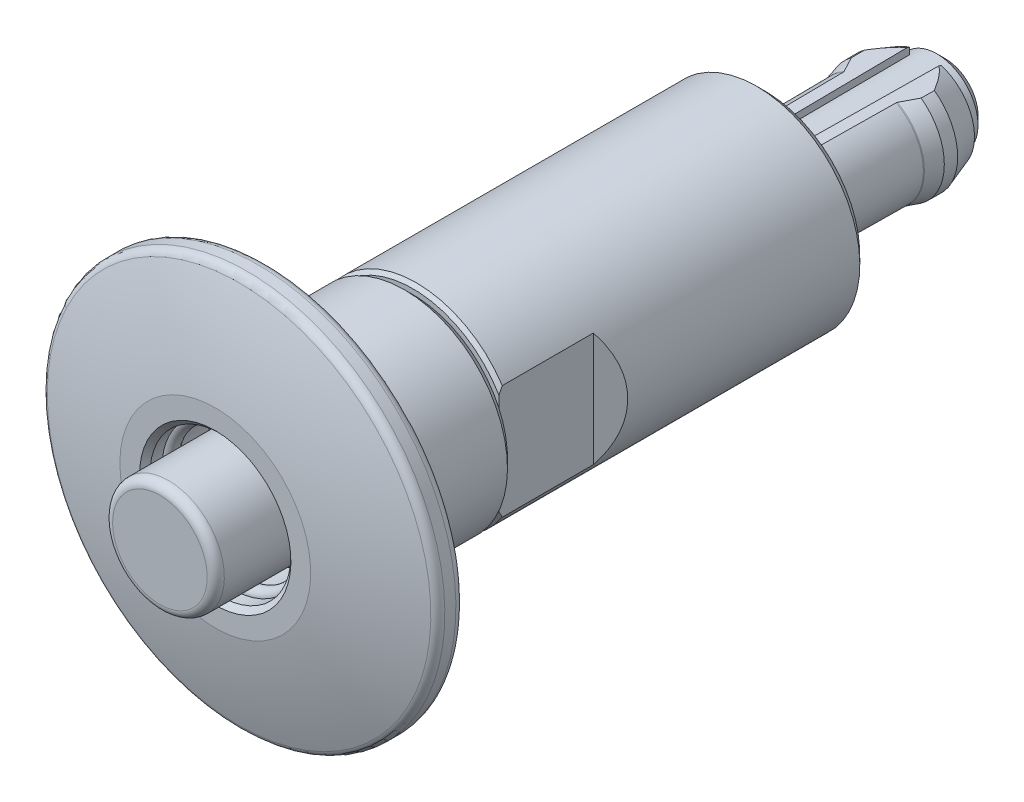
ISO-10303-21;
HEADER;
FILE_DESCRIPTION(('STEP AP214'),'2;1');
FILE_NAME('part.step','',(''),(''),'','','');
FILE_SCHEMA(('AUTOMOTIVE_DESIGN { 1 0 10303 214 1 1 1 1 }'));
ENDSEC;
DATA;
#1=APPLICATION_CONTEXT('core data for automotive mechanical design processes');
#2=APPLICATION_PROTOCOL_DEFINITION('international standard','automotive_design',2000,#1);
#3=PRODUCT_CONTEXT('',#1,'mechanical');
#4=PRODUCT('Part','Part','',(#3));
#5=PRODUCT_RELATED_PRODUCT_CATEGORY('part','',(#4));
#6=PRODUCT_DEFINITION_FORMATION('','',#4);
#7=PRODUCT_DEFINITION_CONTEXT('part definition',#1,'design');
#8=PRODUCT_DEFINITION('design','',#6,#7);
#9=PRODUCT_DEFINITION_SHAPE('','',#8);
#10=(LENGTH_UNIT() NAMED_UNIT(*) SI_UNIT(.MILLI.,.METRE.));
#11=(NAMED_UNIT(*) PLANE_ANGLE_UNIT() SI_UNIT($,.RADIAN.));
#12=(NAMED_UNIT(*) SI_UNIT($,.STERADIAN.) SOLID_ANGLE_UNIT());
#13=UNCERTAINTY_MEASURE_WITH_UNIT(LENGTH_MEASURE(1.E-05),#10,'distance_accuracy_value','');
#14=(GEOMETRIC_REPRESENTATION_CONTEXT(3) GLOBAL_UNCERTAINTY_ASSIGNED_CONTEXT((#13)) GLOBAL_UNIT_ASSIGNED_CONTEXT((#10,
#11,#12)) REPRESENTATION_CONTEXT('',''));
#15=CARTESIAN_POINT('',(0.,0.,0.));
#16=DIRECTION('',(0.,0.,1.));
#17=DIRECTION('',(1.,0.,0.));
#18=AXIS2_PLACEMENT_3D('',#15,#16,#17);
#19=CARTESIAN_POINT('',(0.,0.,30.6));
#20=DIRECTION('',(0.,0.,-1.));
#21=DIRECTION('',(0.,1.,0.));
#22=AXIS2_PLACEMENT_3D('',#19,#20,#21);
#23=TOROIDAL_SURFACE('',#22,4.1,0.4);
#24=CARTESIAN_POINT('',(0.567155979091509,4.38595541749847,30.3633337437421));
#25=CARTESIAN_POINT('',(0.567155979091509,4.37250359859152,30.3451578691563));
#26=CARTESIAN_POINT('',(0.567155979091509,4.35749659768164,30.3281114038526));
#27=CARTESIAN_POINT('',(0.567155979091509,4.32481496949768,30.2967725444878));
#28=CARTESIAN_POINT('',(0.567155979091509,4.30713690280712,30.2824837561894));
#29=CARTESIAN_POINT('',(0.567155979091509,4.26965044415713,30.2570813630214));
#30=CARTESIAN_POINT('',(0.567155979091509,4.24984385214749,30.2459651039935));
#31=CARTESIAN_POINT('',(0.567155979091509,4.20866022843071,30.2271956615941));
#32=CARTESIAN_POINT('',(0.567155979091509,4.18728358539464,30.2195416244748));
#33=CARTESIAN_POINT('',(0.567155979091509,4.14341933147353,30.2078564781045));
#34=CARTESIAN_POINT('',(0.567155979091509,4.12092563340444,30.2038482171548));
#35=CARTESIAN_POINT('',(0.567155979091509,4.07558365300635,30.1996399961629));
#36=CARTESIAN_POINT('',(0.567155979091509,4.05273534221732,30.1994403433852));
#37=CARTESIAN_POINT('',(0.567155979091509,4.00718873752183,30.2028618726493));
#38=CARTESIAN_POINT('',(0.567155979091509,3.98449215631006,30.2065058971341));
#39=CARTESIAN_POINT('',(0.567155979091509,3.94003140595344,30.2175497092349));
#40=CARTESIAN_POINT('',(0.567155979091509,3.91826724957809,30.2249495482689));
#41=CARTESIAN_POINT('',(0.567155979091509,3.87627950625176,30.2433093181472));
#42=CARTESIAN_POINT('',(0.567155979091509,3.85605687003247,30.2542714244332));
#43=CARTESIAN_POINT('',(0.567155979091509,3.81775346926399,30.2794545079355));
#44=CARTESIAN_POINT('',(0.567155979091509,3.79967264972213,30.2936754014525));
#45=CARTESIAN_POINT('',(0.567155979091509,3.76628825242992,30.3248869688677));
#46=CARTESIAN_POINT('',(0.567155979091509,3.750968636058,30.3418604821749));
#47=CARTESIAN_POINT('',(0.567155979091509,3.72343298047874,30.3781621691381));
#48=CARTESIAN_POINT('',(0.567155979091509,3.71121676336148,30.3974902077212));
#49=CARTESIAN_POINT('',(0.567155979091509,3.69037337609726,30.4377339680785));
#50=CARTESIAN_POINT('',(0.567155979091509,3.68170962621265,30.4586307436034));
#51=CARTESIAN_POINT('',(0.567155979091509,3.66805338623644,30.501591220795));
#52=CARTESIAN_POINT('',(0.567155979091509,3.6630606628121,30.5236548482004));
#53=CARTESIAN_POINT('',(0.567155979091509,3.65693234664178,30.5680878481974));
#54=CARTESIAN_POINT('',(0.567155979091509,3.65575899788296,30.5904520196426));
#55=CARTESIAN_POINT('',(0.567155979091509,3.65719918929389,30.6350576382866));
#56=CARTESIAN_POINT('',(0.567155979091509,3.65981261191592,30.6572990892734));
#57=CARTESIAN_POINT('',(0.567155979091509,3.6687289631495,30.7009427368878));
#58=CARTESIAN_POINT('',(0.567155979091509,3.67501816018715,30.7223477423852));
#59=CARTESIAN_POINT('',(0.567155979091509,3.691084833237,30.7638052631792));
#60=CARTESIAN_POINT('',(0.567155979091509,3.70086236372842,30.783857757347));
#61=CARTESIAN_POINT('',(0.567155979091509,3.72366799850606,30.822144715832));
#62=CARTESIAN_POINT('',(0.567155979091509,3.7367108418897,30.840370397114));
#63=CARTESIAN_POINT('',(0.567155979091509,3.76564260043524,30.8744016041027));
#64=CARTESIAN_POINT('',(0.567155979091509,3.78153165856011,30.8902070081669));
#65=CARTESIAN_POINT('',(0.567155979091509,3.8158767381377,30.919121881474));
#66=CARTESIAN_POINT('',(0.567155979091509,3.83435726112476,30.9322022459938));
#67=CARTESIAN_POINT('',(0.567155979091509,3.87323394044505,30.9551120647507));
#68=CARTESIAN_POINT('',(0.567155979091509,3.89363020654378,30.9649413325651));
#69=CARTESIAN_POINT('',(0.567155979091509,3.93598541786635,30.981171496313));
#70=CARTESIAN_POINT('',(0.567155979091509,3.95795827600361,30.9875360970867));
#71=CARTESIAN_POINT('',(0.567155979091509,4.00265827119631,30.9965091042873));
#72=CARTESIAN_POINT('',(0.567155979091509,4.02538543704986,30.9991173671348));
#73=CARTESIAN_POINT('',(0.567155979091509,4.07108374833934,31.0005086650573));
#74=CARTESIAN_POINT('',(0.567155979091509,4.0940555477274,30.9992703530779));
#75=CARTESIAN_POINT('',(0.567155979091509,4.13946482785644,30.9929510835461));
#76=CARTESIAN_POINT('',(0.567155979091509,4.16190230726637,30.9878701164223));
#77=CARTESIAN_POINT('',(0.567155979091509,4.20557875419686,30.9740067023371));
#78=CARTESIAN_POINT('',(0.567155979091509,4.22681890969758,30.9652280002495));
#79=CARTESIAN_POINT('',(0.567155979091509,4.26751074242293,30.9442073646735));
#80=CARTESIAN_POINT('',(0.567155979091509,4.28696246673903,30.9319655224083));
#81=CARTESIAN_POINT('',(0.567155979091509,4.3233919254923,30.904445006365));
#82=CARTESIAN_POINT('',(0.567155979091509,4.3403844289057,30.8891858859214));
#83=CARTESIAN_POINT('',(0.567155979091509,4.37153954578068,30.8560096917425));
#84=CARTESIAN_POINT('',(0.567155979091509,4.38570228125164,30.8380927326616));
#85=CARTESIAN_POINT('',(0.567155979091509,4.41066953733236,30.8002711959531));
#86=CARTESIAN_POINT('',(0.567155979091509,4.42150128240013,30.7803845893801));
#87=CARTESIAN_POINT('',(0.567155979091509,4.43964382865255,30.739066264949));
#88=CARTESIAN_POINT('',(0.567155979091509,4.44695492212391,30.7176346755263));
#89=CARTESIAN_POINT('',(0.567155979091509,4.4577976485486,30.6740032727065));
#90=CARTESIAN_POINT('',(0.567155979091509,4.46135660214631,30.6518102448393));
#91=CARTESIAN_POINT('',(0.567155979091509,4.46468385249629,30.6071358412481));
#92=CARTESIAN_POINT('',(0.567155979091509,4.46445129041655,30.5846544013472));
#93=CARTESIAN_POINT('',(0.567155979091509,4.4602084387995,30.5401236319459));
#94=CARTESIAN_POINT('',(0.567155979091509,4.45620981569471,30.5180731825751));
#95=CARTESIAN_POINT('',(0.567155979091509,4.44457158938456,30.4749752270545));
#96=CARTESIAN_POINT('',(0.567155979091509,4.43693644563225,30.4539265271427));
#97=CARTESIAN_POINT('',(0.567155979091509,4.42188976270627,30.4212789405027));
#98=CARTESIAN_POINT('',(0.567155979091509,4.41553871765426,30.4091796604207));
#99=CARTESIAN_POINT('',(0.567155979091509,4.40163257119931,30.3856942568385));
#100=CARTESIAN_POINT('',(0.567155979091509,4.39407747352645,30.3743081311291));
#101=CARTESIAN_POINT('',(0.567155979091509,4.38595541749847,30.3633337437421));
#102=B_SPLINE_CURVE_WITH_KNOTS('',3,(#24,#25,#26,#27,#28,#29,#30,#31,#32,#33,#34,#35,#36,#37,
#38,#39,#40,#41,#42,#43,#44,#45,#46,#47,#48,#49,#50,#51,#52,#53,#54,#55,#56,#57,#58,#59,#60,#61,
#62,#63,#64,#65,#66,#67,#68,#69,#70,#71,#72,#73,#74,#75,#76,#77,#78,#79,#80,#81,#82,#83,#84,#85,
#86,#87,#88,#89,#90,#91,#92,#93,#94,#95,#96,#97,#98,#99,#100,#101),.UNSPECIFIED.,.T.,.F.,(4,2,2,
2,2,2,2,2,2,2,2,2,2,2,2,2,2,2,2,2,2,2,2,2,2,2,2,2,2,2,2,2,2,2,2,2,2,2,4),(0.,0.0677863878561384,
0.135660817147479,0.203478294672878,0.271279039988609,0.339501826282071,0.407730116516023,
0.476366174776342,0.545003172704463,0.613682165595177,0.682359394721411,0.750623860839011,
0.818884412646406,0.88642327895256,0.953957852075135,1.02082275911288,1.08768559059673,
1.15430022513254,1.22091590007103,1.28783786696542,1.35476319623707,1.42237031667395,
1.48998131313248,1.5582875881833,1.6265964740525,1.6952851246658,1.76397394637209,
1.83259337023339,1.90121098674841,1.9693977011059,2.03758147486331,2.10519218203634,
2.17279727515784,2.23990663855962,2.30703120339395,2.37394851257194,2.44078397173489,
2.48171275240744,2.52264140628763),.UNSPECIFIED.);
#103=CARTESIAN_POINT('',(0.567155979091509,4.06058297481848,30.2));
#104=VERTEX_POINT('',#103);
#105=CARTESIAN_POINT('',(0.567155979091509,4.06058297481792,31.));
#106=VERTEX_POINT('',#105);
#107=EDGE_CURVE('E676',#104,#106,#102,.T.);
#108=ORIENTED_EDGE('',*,*,#107,.F.);
#109=CARTESIAN_POINT('',(0.,0.,30.2));
#110=DIRECTION('',(0.,0.,1.));
#111=DIRECTION('',(0.,-1.,0.));
#112=AXIS2_PLACEMENT_3D('',#109,#110,#111);
#113=CIRCLE('',#112,4.1);
#114=CARTESIAN_POINT('',(-0.567155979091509,4.06058297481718,30.2));
#115=VERTEX_POINT('',#114);
#116=EDGE_CURVE('E9',#104,#115,#113,.F.);
#117=ORIENTED_EDGE('',*,*,#116,.T.);
#118=CARTESIAN_POINT('',(-0.567155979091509,4.38595541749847,30.3633337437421));
#119=CARTESIAN_POINT('',(-0.567155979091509,4.39925889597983,30.3813125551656));
#120=CARTESIAN_POINT('',(-0.567155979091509,4.41106029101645,30.4004221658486));
#121=CARTESIAN_POINT('',(-0.567155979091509,4.43130009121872,30.4403654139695));
#122=CARTESIAN_POINT('',(-0.567155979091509,4.43973473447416,30.4612009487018));
#123=CARTESIAN_POINT('',(-0.567155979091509,4.45297811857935,30.503990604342));
#124=CARTESIAN_POINT('',(-0.567155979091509,4.45778781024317,30.5259444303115));
#125=CARTESIAN_POINT('',(-0.567155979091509,4.46363926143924,30.5703430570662));
#126=CARTESIAN_POINT('',(-0.567155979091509,4.464681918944,30.5927877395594));
#127=CARTESIAN_POINT('',(-0.567155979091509,4.46297369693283,30.6374678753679));
#128=CARTESIAN_POINT('',(-0.567155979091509,4.46023364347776,30.6597037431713));
#129=CARTESIAN_POINT('',(-0.567155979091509,4.45106023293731,30.7034005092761));
#130=CARTESIAN_POINT('',(-0.567155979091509,4.44462676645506,30.7248613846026));
#131=CARTESIAN_POINT('',(-0.567155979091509,4.42825330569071,30.7664090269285));
#132=CARTESIAN_POINT('',(-0.567155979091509,4.41831209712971,30.786495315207));
#133=CARTESIAN_POINT('',(-0.567155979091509,4.39521423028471,30.8247245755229));
#134=CARTESIAN_POINT('',(-0.567155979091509,4.38205751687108,30.842867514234));
#135=CARTESIAN_POINT('',(-0.567155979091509,4.35283717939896,30.8767930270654));
#136=CARTESIAN_POINT('',(-0.567155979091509,4.33675967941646,30.8925636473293));
#137=CARTESIAN_POINT('',(-0.567155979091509,4.30220331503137,30.9212071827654));
#138=CARTESIAN_POINT('',(-0.567155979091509,4.28372436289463,30.9340799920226));
#139=CARTESIAN_POINT('',(-0.567155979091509,4.24473522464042,30.9566713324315));
#140=CARTESIAN_POINT('',(-0.567155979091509,4.22421022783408,30.9663643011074));
#141=CARTESIAN_POINT('',(-0.567155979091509,4.18183319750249,30.9821983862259));
#142=CARTESIAN_POINT('',(-0.567155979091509,4.15998110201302,30.9883393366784));
#143=CARTESIAN_POINT('',(-0.567155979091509,4.1153801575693,30.9969443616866));
#144=CARTESIAN_POINT('',(-0.567155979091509,4.09262546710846,30.9993781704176));
#145=CARTESIAN_POINT('',(-0.567155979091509,4.04702890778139,31.0004122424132));
#146=CARTESIAN_POINT('',(-0.567155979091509,4.02418703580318,30.9990123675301));
#147=CARTESIAN_POINT('',(-0.567155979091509,3.97894208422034,30.9924026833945));
#148=CARTESIAN_POINT('',(-0.567155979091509,3.9565418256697,30.9871735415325));
#149=CARTESIAN_POINT('',(-0.567155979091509,3.91293751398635,30.9730264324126));
#150=CARTESIAN_POINT('',(-0.567155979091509,3.89173347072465,30.96410843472));
#151=CARTESIAN_POINT('',(-0.567155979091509,3.85114599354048,30.9428347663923));
#152=CARTESIAN_POINT('',(-0.567155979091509,3.83176118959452,30.9304817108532));
#153=CARTESIAN_POINT('',(-0.567155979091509,3.79535991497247,30.902674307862));
#154=CARTESIAN_POINT('',(-0.567155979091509,3.7783433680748,30.8872200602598));
#155=CARTESIAN_POINT('',(-0.567155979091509,3.74729912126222,30.853764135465));
#156=CARTESIAN_POINT('',(-0.567155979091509,3.73325063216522,30.8357817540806));
#157=CARTESIAN_POINT('',(-0.567155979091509,3.70841159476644,30.7976920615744));
#158=CARTESIAN_POINT('',(-0.567155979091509,3.69762084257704,30.7775848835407));
#159=CARTESIAN_POINT('',(-0.567155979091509,3.67972842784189,30.7360520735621));
#160=CARTESIAN_POINT('',(-0.567155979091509,3.67258771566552,30.7146432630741));
#161=CARTESIAN_POINT('',(-0.567155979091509,3.66203880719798,30.6709251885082));
#162=CARTESIAN_POINT('',(-0.567155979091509,3.65863038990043,30.6486159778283));
#163=CARTESIAN_POINT('',(-0.567155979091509,3.65566533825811,30.6039458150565));
#164=CARTESIAN_POINT('',(-0.567155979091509,3.65607425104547,30.5815871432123));
#165=CARTESIAN_POINT('',(-0.567155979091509,3.66064855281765,30.5372579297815));
#166=CARTESIAN_POINT('',(-0.567155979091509,3.66481386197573,30.5152873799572));
#167=CARTESIAN_POINT('',(-0.567155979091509,3.67676138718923,30.4724008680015));
#168=CARTESIAN_POINT('',(-0.567155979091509,3.68453639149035,30.4514828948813));
#169=CARTESIAN_POINT('',(-0.567155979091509,3.70346705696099,30.4112378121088));
#170=CARTESIAN_POINT('',(-0.567155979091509,3.71462279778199,30.3919107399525));
#171=CARTESIAN_POINT('',(-0.567155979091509,3.74006468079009,30.3552647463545));
#172=CARTESIAN_POINT('',(-0.567155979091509,3.7543695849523,30.3379588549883));
#173=CARTESIAN_POINT('',(-0.567155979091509,3.78565382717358,30.3059624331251));
#174=CARTESIAN_POINT('',(-0.567155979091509,3.80263331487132,30.2912720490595));
#175=CARTESIAN_POINT('',(-0.567155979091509,3.83897865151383,30.2647565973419));
#176=CARTESIAN_POINT('',(-0.567155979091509,3.85836806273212,30.2529638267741));
#177=CARTESIAN_POINT('',(-0.567155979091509,3.8988371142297,30.2327645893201));
#178=CARTESIAN_POINT('',(-0.567155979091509,3.91991685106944,30.2243583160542));
#179=CARTESIAN_POINT('',(-0.567155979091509,3.96338697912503,30.2110919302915));
#180=CARTESIAN_POINT('',(-0.567155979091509,3.98578804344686,30.2062667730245));
#181=CARTESIAN_POINT('',(-0.567155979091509,4.03108098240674,30.2004281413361));
#182=CARTESIAN_POINT('',(-0.567155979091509,4.05397285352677,30.1994146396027));
#183=CARTESIAN_POINT('',(-0.567155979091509,4.09969843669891,30.2012334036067));
#184=CARTESIAN_POINT('',(-0.567155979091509,4.1225315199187,30.204081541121));
#185=CARTESIAN_POINT('',(-0.567155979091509,4.16739941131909,30.2135806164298));
#186=CARTESIAN_POINT('',(-0.567155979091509,4.18943402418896,30.2202324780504));
#187=CARTESIAN_POINT('',(-0.567155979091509,4.2320240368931,30.237143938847));
#188=CARTESIAN_POINT('',(-0.567155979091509,4.25258206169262,30.2473969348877));
#189=CARTESIAN_POINT('',(-0.567155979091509,4.29164921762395,30.2712264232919));
#190=CARTESIAN_POINT('',(-0.567155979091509,4.31016084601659,30.2847987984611));
#191=CARTESIAN_POINT('',(-0.567155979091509,4.33824594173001,30.3093236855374));
#192=CARTESIAN_POINT('',(-0.567155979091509,4.34859916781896,30.319398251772));
#193=CARTESIAN_POINT('',(-0.567155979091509,4.36816186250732,30.3406028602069));
#194=CARTESIAN_POINT('',(-0.567155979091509,4.3773713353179,30.3517328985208));
#195=CARTESIAN_POINT('',(-0.567155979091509,4.38595541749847,30.3633337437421));
#196=B_SPLINE_CURVE_WITH_KNOTS('',3,(#118,#119,#120,#121,#122,#123,#124,#125,#126,#127,#128,
#129,#130,#131,#132,#133,#134,#135,#136,#137,#138,#139,#140,#141,#142,#143,#144,#145,#146,#147,
#148,#149,#150,#151,#152,#153,#154,#155,#156,#157,#158,#159,#160,#161,#162,#163,#164,#165,#166,
#167,#168,#169,#170,#171,#172,#173,#174,#175,#176,#177,#178,#179,#180,#181,#182,#183,#184,#185,
#186,#187,#188,#189,#190,#191,#192,#193,#194,#195),.UNSPECIFIED.,.T.,.F.,(4,2,2,2,2,2,2,2,2,2,2,
2,2,2,2,2,2,2,2,2,2,2,2,2,2,2,2,2,2,2,2,2,2,2,2,2,2,2,4),(0.,0.0670445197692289,
0.134163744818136,0.201265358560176,0.268350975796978,0.335244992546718,0.402140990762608,
0.469060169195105,0.535980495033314,0.603227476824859,0.670476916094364,0.738254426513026,
0.806035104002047,0.874366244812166,0.942699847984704,1.01138084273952,1.08006240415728,
1.14869182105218,1.2173190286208,1.28544832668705,1.35357335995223,1.42095345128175,
1.48832955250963,1.55509815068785,1.62186533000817,1.68849968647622,1.75513561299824,
1.82217983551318,1.88922781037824,1.95699227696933,2.02476061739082,2.09318204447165,
2.16160298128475,2.23030599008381,2.29902569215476,2.3676200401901,2.4361297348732,
2.47939043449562,2.52265097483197),.UNSPECIFIED.);
#197=CARTESIAN_POINT('',(-0.567155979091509,4.06058297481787,31.));
#198=VERTEX_POINT('',#197);
#199=EDGE_CURVE('E1124',#198,#115,#196,.T.);
#200=ORIENTED_EDGE('',*,*,#199,.F.);
#201=CARTESIAN_POINT('',(0.,0.,31.));
#202=DIRECTION('',(0.,0.,-1.));
#203=DIRECTION('',(0.,1.,0.));
#204=AXIS2_PLACEMENT_3D('',#201,#202,#203);
#205=CIRCLE('',#204,4.1);
#206=EDGE_CURVE('E25',#198,#106,#205,.F.);
#207=ORIENTED_EDGE('',*,*,#206,.T.);
#208=EDGE_LOOP('',(#108,#117,#200,#207));
#209=FACE_BOUND('',#208,.T.);
#210=ADVANCED_FACE('F14',(#209),#23,.T.);
#211=CARTESIAN_POINT('',(0.567155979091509,5.67119255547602,30.2));
#212=DIRECTION('',(1.,0.,0.));
#213=DIRECTION('',(0.,1.,0.));
#214=AXIS2_PLACEMENT_3D('',#211,#212,#213);
#215=PLANE('',#214);
#216=DIRECTION('',(0.,0.,1.));
#217=VECTOR('',#216,1.);
#218=CARTESIAN_POINT('',(0.567155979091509,4.06058297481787,24.5));
#219=LINE('',#218,#217);
#220=EDGE_CURVE('E19',#104,#106,#219,.T.);
#221=ORIENTED_EDGE('',*,*,#220,.F.);
#222=ORIENTED_EDGE('',*,*,#107,.T.);
#223=EDGE_LOOP('',(#221,#222));
#224=FACE_BOUND('',#223,.T.);
#225=ADVANCED_FACE('F346',(#224),#215,.F.);
#226=CARTESIAN_POINT('',(-0.567155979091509,5.67119255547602,30.2));
#227=DIRECTION('',(-1.,0.,0.));
#228=DIRECTION('',(0.,-1.,0.));
#229=AXIS2_PLACEMENT_3D('',#226,#227,#228);
#230=PLANE('',#229);
#231=DIRECTION('',(0.,0.,1.));
#232=VECTOR('',#231,1.);
#233=CARTESIAN_POINT('',(-0.567155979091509,4.06058297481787,24.5));
#234=LINE('',#233,#232);
#235=EDGE_CURVE('E665',#198,#115,#234,.F.);
#236=ORIENTED_EDGE('',*,*,#235,.F.);
#237=ORIENTED_EDGE('',*,*,#199,.T.);
#238=EDGE_LOOP('',(#236,#237));
#239=FACE_BOUND('',#238,.T.);
#240=ADVANCED_FACE('F336',(#239),#230,.F.);
#241=CARTESIAN_POINT('',(-2.4,0.,-10.4770086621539));
#242=DIRECTION('',(0.,0.,1.));
#243=DIRECTION('',(0.,1.,0.));
#244=AXIS2_PLACEMENT_3D('',#241,#242,#243);
#245=PLANE('',#244);
#246=CARTESIAN_POINT('',(0.,0.,-10.4770086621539));
#247=DIRECTION('',(0.,0.,1.));
#248=DIRECTION('',(0.,1.,0.));
#249=AXIS2_PLACEMENT_3D('',#246,#247,#248);
#250=CIRCLE('',#249,1.9);
#251=CARTESIAN_POINT('',(0.,1.9,-10.4770086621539));
#252=VERTEX_POINT('',#251);
#253=EDGE_CURVE('E800',#252,#252,#250,.F.);
#254=ORIENTED_EDGE('',*,*,#253,.T.);
#255=EDGE_LOOP('',(#254));
#256=FACE_BOUND('',#255,.T.);
#257=ADVANCED_FACE('F333',(#256),#245,.F.);
#258=CARTESIAN_POINT('',(-0.134704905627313,0.,-6.10018841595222));
#259=DIRECTION('',(0.0121494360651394,0.,0.999926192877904));
#260=DIRECTION('',(0.,1.,0.));
#261=AXIS2_PLACEMENT_3D('',#258,#259,#260);
#262=TOROIDAL_SURFACE('',#261,3.2,0.2);
#263=CARTESIAN_POINT('',(-0.134704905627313,0.,-6.10018841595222));
#264=DIRECTION('',(0.0121494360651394,0.,0.999926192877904));
#265=DIRECTION('',(0.,1.,0.));
#266=AXIS2_PLACEMENT_3D('',#263,#264,#265);
#267=CIRCLE('',#266,3.);
#268=CARTESIAN_POINT('',(-1.54083722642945,2.65,-6.08310344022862));
#269=VERTEX_POINT('',#268);
#270=CARTESIAN_POINT('',(-1.54083722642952,-2.65,-6.08310344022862));
#271=VERTEX_POINT('',#270);
#272=EDGE_CURVE('E833',#269,#271,#267,.T.);
#273=ORIENTED_EDGE('',*,*,#272,.F.);
#274=CARTESIAN_POINT('',(-1.54091391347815,2.65,-6.0780040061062));
#275=CARTESIAN_POINT('',(-1.54068042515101,2.65,-6.08356003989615));
#276=CARTESIAN_POINT('',(-1.54094268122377,2.65000000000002,-6.08914179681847));
#277=CARTESIAN_POINT('',(-1.54244066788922,2.65000000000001,-6.10017898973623));
#278=CARTESIAN_POINT('',(-1.54367832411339,2.65,-6.10563415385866));
#279=CARTESIAN_POINT('',(-1.54699670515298,2.65,-6.11623211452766));
#280=CARTESIAN_POINT('',(-1.5490711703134,2.65000000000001,-6.12137691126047));
#281=CARTESIAN_POINT('',(-1.55390812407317,2.65000000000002,-6.13132569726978));
#282=CARTESIAN_POINT('',(-1.55667073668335,2.65,-6.13612962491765));
#283=CARTESIAN_POINT('',(-1.56500854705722,2.64999999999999,-6.1488458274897));
#284=CARTESIAN_POINT('',(-1.57114071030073,2.65000000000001,-6.15639176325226));
#285=CARTESIAN_POINT('',(-1.58446990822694,2.65000000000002,-6.17047949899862));
#286=CARTESIAN_POINT('',(-1.59167074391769,2.65,-6.17701753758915));
#287=CARTESIAN_POINT('',(-1.61304492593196,2.64999999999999,-6.19431687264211));
#288=CARTESIAN_POINT('',(-1.62803285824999,2.65000000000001,-6.20406353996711));
#289=CARTESIAN_POINT('',(-1.65919634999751,2.65000000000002,-6.22136766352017));
#290=CARTESIAN_POINT('',(-1.67537462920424,2.65000000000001,-6.22891989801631));
#291=CARTESIAN_POINT('',(-1.72211853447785,2.64999999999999,-6.2477799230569));
#292=CARTESIAN_POINT('',(-1.75351790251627,2.65000000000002,-6.25702850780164));
#293=CARTESIAN_POINT('',(-1.81737503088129,2.65000000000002,-6.27071218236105));
#294=CARTESIAN_POINT('',(-1.84983565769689,2.65,-6.2751328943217));
#295=CARTESIAN_POINT('',(-1.91673693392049,2.65,-6.27929645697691));
#296=CARTESIAN_POINT('',(-1.95119390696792,2.65000000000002,-6.27878836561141));
#297=CARTESIAN_POINT('',(-2.01942874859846,2.65000000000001,-6.2718363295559));
#298=CARTESIAN_POINT('',(-2.0532093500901,2.64999999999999,-6.26542585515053));
#299=CARTESIAN_POINT('',(-2.10022071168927,2.65000000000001,-6.25083409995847));
#300=CARTESIAN_POINT('',(-2.11438745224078,2.65000000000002,-6.24564355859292));
#301=CARTESIAN_POINT('',(-2.14203504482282,2.65000000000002,-6.23357403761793));
#302=CARTESIAN_POINT('',(-2.15551455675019,2.65,-6.22669190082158));
#303=CARTESIAN_POINT('',(-2.18151139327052,2.65,-6.21087458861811));
#304=CARTESIAN_POINT('',(-2.19401137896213,2.65000000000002,-6.20191033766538));
#305=CARTESIAN_POINT('',(-2.2170192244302,2.65000000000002,-6.18171561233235));
#306=CARTESIAN_POINT('',(-2.22753731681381,2.64999999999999,-6.17049743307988));
#307=CARTESIAN_POINT('',(-2.24117901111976,2.65000000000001,-6.15156699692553));
#308=CARTESIAN_POINT('',(-2.24545500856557,2.65000000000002,-6.14468383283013));
#309=CARTESIAN_POINT('',(-2.25287344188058,2.65000000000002,-6.13032575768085));
#310=CARTESIAN_POINT('',(-2.25601668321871,2.65,-6.12285127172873));
#311=CARTESIAN_POINT('',(-2.26095562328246,2.65,-6.1073916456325));
#312=CARTESIAN_POINT('',(-2.26273972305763,2.65000000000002,-6.09940272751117));
#313=CARTESIAN_POINT('',(-2.26474071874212,2.65000000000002,-6.08323061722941));
#314=CARTESIAN_POINT('',(-2.26495866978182,2.65,-6.07504755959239));
#315=CARTESIAN_POINT('',(-2.26386814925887,2.65,-6.05971391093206));
#316=CARTESIAN_POINT('',(-2.26272842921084,2.65000000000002,-6.05255061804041));
#317=CARTESIAN_POINT('',(-2.25928240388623,2.65000000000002,-6.03851237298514));
#318=CARTESIAN_POINT('',(-2.25697581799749,2.65,-6.0316374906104));
#319=CARTESIAN_POINT('',(-2.25129238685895,2.65,-6.01819142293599));
#320=CARTESIAN_POINT('',(-2.24789537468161,2.65000000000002,-6.01162887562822));
#321=CARTESIAN_POINT('',(-2.24023195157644,2.65000000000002,-5.99903796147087));
#322=CARTESIAN_POINT('',(-2.23596515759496,2.65,-5.99300983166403));
#323=CARTESIAN_POINT('',(-2.22385894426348,2.64999999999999,-5.97793429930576));
#324=CARTESIAN_POINT('',(-2.21544927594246,2.65000000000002,-5.96934411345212));
#325=CARTESIAN_POINT('',(-2.19738469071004,2.65000000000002,-5.95358890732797));
#326=CARTESIAN_POINT('',(-2.18772625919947,2.65000000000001,-5.94642806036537));
#327=CARTESIAN_POINT('',(-2.16195356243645,2.64999999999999,-5.92976718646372));
#328=CARTESIAN_POINT('',(-2.14524436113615,2.65000000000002,-5.92119169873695));
#329=CARTESIAN_POINT('',(-2.11074260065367,2.65000000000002,-5.90666895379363));
#330=CARTESIAN_POINT('',(-2.09294811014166,2.65000000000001,-5.90072654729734));
#331=CARTESIAN_POINT('',(-2.0459118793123,2.64999999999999,-5.88815011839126));
#332=CARTESIAN_POINT('',(-2.01620985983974,2.65000000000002,-5.88324172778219));
#333=CARTESIAN_POINT('',(-1.95639863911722,2.65000000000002,-5.87801588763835));
#334=CARTESIAN_POINT('',(-1.92628858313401,2.65,-5.87771035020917));
#335=CARTESIAN_POINT('',(-1.86477527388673,2.65,-5.88128076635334));
#336=CARTESIAN_POINT('',(-1.83338442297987,2.65000000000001,-5.88537086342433));
#337=CARTESIAN_POINT('',(-1.77160883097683,2.65000000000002,-5.89797468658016));
#338=CARTESIAN_POINT('',(-1.74122095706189,2.65000000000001,-5.90647290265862));
#339=CARTESIAN_POINT('',(-1.68734650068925,2.64999999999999,-5.92663078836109));
#340=CARTESIAN_POINT('',(-1.66357634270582,2.64999999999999,-5.93748771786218));
#341=CARTESIAN_POINT('',(-1.62981392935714,2.65000000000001,-5.95724784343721));
#342=CARTESIAN_POINT('',(-1.61883275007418,2.65000000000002,-5.96445174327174));
#343=CARTESIAN_POINT('',(-1.5979454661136,2.65000000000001,-5.98029054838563));
#344=CARTESIAN_POINT('',(-1.58803670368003,2.64999999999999,-5.98892177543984));
#345=CARTESIAN_POINT('',(-1.57413904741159,2.65,-6.00361675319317));
#346=CARTESIAN_POINT('',(-1.56950491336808,2.65000000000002,-6.00906706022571));
#347=CARTESIAN_POINT('',(-1.56099567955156,2.65000000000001,-6.02054068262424));
#348=CARTESIAN_POINT('',(-1.55712011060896,2.65,-6.02656364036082));
#349=CARTESIAN_POINT('',(-1.55096534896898,2.65,-6.03813493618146));
#350=CARTESIAN_POINT('',(-1.54852841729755,2.65000000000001,-6.04359832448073));
#351=CARTESIAN_POINT('',(-1.54458475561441,2.65000000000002,-6.05484382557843));
#352=CARTESIAN_POINT('',(-1.54307512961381,2.65,-6.06062488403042));
#353=CARTESIAN_POINT('',(-1.54147715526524,2.65,-6.07030086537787));
#354=CARTESIAN_POINT('',(-1.54107603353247,2.65,-6.07414623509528));
#355=CARTESIAN_POINT('',(-1.54091391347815,2.65,-6.0780040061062));
#356=B_SPLINE_CURVE_WITH_KNOTS('',3,(#274,#275,#276,#277,#278,#279,#280,#281,#282,#283,#284,
#285,#286,#287,#288,#289,#290,#291,#292,#293,#294,#295,#296,#297,#298,#299,#300,#301,#302,#303,
#304,#305,#306,#307,#308,#309,#310,#311,#312,#313,#314,#315,#316,#317,#318,#319,#320,#321,#322,
#323,#324,#325,#326,#327,#328,#329,#330,#331,#332,#333,#334,#335,#336,#337,#338,#339,#340,#341,
#342,#343,#344,#345,#346,#347,#348,#349,#350,#351,#352,#353,#354,#355),.UNSPECIFIED.,.T.,.F.,(4,
2,2,2,2,2,2,2,2,2,2,2,2,2,2,2,2,2,2,2,2,2,2,2,2,2,2,2,2,2,2,2,2,2,2,2,2,2,2,2,4),(0.,
0.0166690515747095,0.033371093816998,0.0499504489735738,0.0665327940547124,0.095533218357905,
0.124639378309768,0.17797319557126,0.231432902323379,0.329102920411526,0.427063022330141,
0.530035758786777,0.6324281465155,0.677609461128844,0.722875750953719,0.768816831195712,
0.814513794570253,0.83874110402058,0.86295115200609,0.887365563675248,0.911763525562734,
0.933420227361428,0.95508213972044,0.977170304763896,0.999268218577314,1.03512590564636,
1.07108680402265,1.12711497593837,1.18324593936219,1.27306711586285,1.36312070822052,
1.4577690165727,1.55208654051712,1.63006448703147,1.6693886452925,1.70861300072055,
1.7300291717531,1.75143205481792,1.76931356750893,1.78713894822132,1.79871292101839),.UNSPECIFIED.);
#357=CARTESIAN_POINT('',(-1.55594547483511,2.65,-6.13468749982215));
#358=VERTEX_POINT('',#357);
#359=EDGE_CURVE('E469',#269,#358,#356,.T.);
#360=ORIENTED_EDGE('',*,*,#359,.T.);
#361=CARTESIAN_POINT('',(-0.135333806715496,0.,-6.15194840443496));
#362=DIRECTION('',(-0.0121494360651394,0.,-0.999926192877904));
#363=DIRECTION('',(0.,-1.,0.));
#364=AXIS2_PLACEMENT_3D('',#361,#362,#363);
#365=CIRCLE('',#364,3.0068148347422);
#366=CARTESIAN_POINT('',(-1.55594547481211,-2.65,-6.13468749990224));
#367=VERTEX_POINT('',#366);
#368=EDGE_CURVE('E459',#367,#358,#365,.T.);
#369=ORIENTED_EDGE('',*,*,#368,.F.);
#370=CARTESIAN_POINT('',(-1.54091391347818,-2.65,-6.0780040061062));
#371=CARTESIAN_POINT('',(-1.54116516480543,-2.65,-6.07208744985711));
#372=CARTESIAN_POINT('',(-1.54197949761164,-2.64999999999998,-6.06618689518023));
#373=CARTESIAN_POINT('',(-1.54463947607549,-2.64999999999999,-6.05461530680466));
#374=CARTESIAN_POINT('',(-1.54648848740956,-2.65,-6.04894508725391));
#375=CARTESIAN_POINT('',(-1.5516911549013,-2.65,-6.03638104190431));
#376=CARTESIAN_POINT('',(-1.55532461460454,-2.64999999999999,-6.02960434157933));
#377=CARTESIAN_POINT('',(-1.56361056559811,-2.64999999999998,-6.01671451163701));
#378=CARTESIAN_POINT('',(-1.56826484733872,-2.65,-6.01060257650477));
#379=CARTESIAN_POINT('',(-1.58166307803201,-2.65000000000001,-5.99509894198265));
#380=CARTESIAN_POINT('',(-1.59105091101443,-2.64999999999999,-5.9862691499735));
#381=CARTESIAN_POINT('',(-1.61098550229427,-2.64999999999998,-5.97005059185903));
#382=CARTESIAN_POINT('',(-1.62153537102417,-2.65,-5.96266584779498));
#383=CARTESIAN_POINT('',(-1.65340099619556,-2.65000000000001,-5.94280540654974));
#384=CARTESIAN_POINT('',(-1.67568967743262,-2.64999999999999,-5.93189872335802));
#385=CARTESIAN_POINT('',(-1.72156814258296,-2.64999999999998,-5.91332340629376));
#386=CARTESIAN_POINT('',(-1.74516169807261,-2.65,-5.90566477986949));
#387=CARTESIAN_POINT('',(-1.80462516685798,-2.65,-5.89015494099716));
#388=CARTESIAN_POINT('',(-1.84093997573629,-2.64999999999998,-5.88398396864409));
#389=CARTESIAN_POINT('',(-1.91405576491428,-2.64999999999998,-5.8776423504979));
#390=CARTESIAN_POINT('',(-1.95085593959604,-2.65000000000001,-5.87746277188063));
#391=CARTESIAN_POINT('',(-2.00954743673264,-2.65,-5.88270299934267));
#392=CARTESIAN_POINT('',(-2.03163589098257,-2.64999999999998,-5.88595846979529));
#393=CARTESIAN_POINT('',(-2.0751747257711,-2.64999999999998,-5.89543548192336));
#394=CARTESIAN_POINT('',(-2.09662612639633,-2.65000000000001,-5.90165197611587));
#395=CARTESIAN_POINT('',(-2.13143564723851,-2.65,-5.9150730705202));
#396=CARTESIAN_POINT('',(-2.14516639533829,-2.64999999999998,-5.92130691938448));
#397=CARTESIAN_POINT('',(-2.17160532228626,-2.64999999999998,-5.93568061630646));
#398=CARTESIAN_POINT('',(-2.18431502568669,-2.65000000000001,-5.94381754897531));
#399=CARTESIAN_POINT('',(-2.20434587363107,-2.65,-5.95939073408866));
#400=CARTESIAN_POINT('',(-2.21211084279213,-2.64999999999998,-5.96625318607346));
#401=CARTESIAN_POINT('',(-2.22651393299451,-2.64999999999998,-5.98107975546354));
#402=CARTESIAN_POINT('',(-2.23315374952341,-2.65,-5.98904218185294));
#403=CARTESIAN_POINT('',(-2.24358917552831,-2.65,-6.0041865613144));
#404=CARTESIAN_POINT('',(-2.24768920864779,-2.64999999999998,-6.01115732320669));
#405=CARTESIAN_POINT('',(-2.25469603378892,-2.64999999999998,-6.02567916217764));
#406=CARTESIAN_POINT('',(-2.25760371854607,-2.65,-6.03322980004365));
#407=CARTESIAN_POINT('',(-2.26201905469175,-2.65,-6.04880065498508));
#408=CARTESIAN_POINT('',(-2.26351570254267,-2.64999999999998,-6.05682405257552));
#409=CARTESIAN_POINT('',(-2.26492788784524,-2.64999999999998,-6.07300837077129));
#410=CARTESIAN_POINT('',(-2.26484422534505,-2.65,-6.08116921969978));
#411=CARTESIAN_POINT('',(-2.26321908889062,-2.65,-6.09634649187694));
#412=CARTESIAN_POINT('',(-2.26185378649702,-2.64999999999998,-6.10338271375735));
#413=CARTESIAN_POINT('',(-2.25802137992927,-2.64999999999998,-6.1171458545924));
#414=CARTESIAN_POINT('',(-2.25555387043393,-2.65,-6.1238726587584));
#415=CARTESIAN_POINT('',(-2.24875491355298,-2.65,-6.13891881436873));
#416=CARTESIAN_POINT('',(-2.24408255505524,-2.64999999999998,-6.14708371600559));
#417=CARTESIAN_POINT('',(-2.23347828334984,-2.64999999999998,-6.16254740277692));
#418=CARTESIAN_POINT('',(-2.22754403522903,-2.65,-6.16984454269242));
#419=CARTESIAN_POINT('',(-2.21189366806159,-2.65000000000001,-6.18660288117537));
#420=CARTESIAN_POINT('',(-2.20166834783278,-2.64999999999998,-6.19558611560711));
#421=CARTESIAN_POINT('',(-2.1799594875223,-2.64999999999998,-6.21186050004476));
#422=CARTESIAN_POINT('',(-2.16847332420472,-2.65,-6.21914801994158));
#423=CARTESIAN_POINT('',(-2.13758397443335,-2.65000000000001,-6.23613792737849));
#424=CARTESIAN_POINT('',(-2.11754803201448,-2.64999999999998,-6.24468472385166));
#425=CARTESIAN_POINT('',(-2.07644383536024,-2.64999999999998,-6.2586606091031));
#426=CARTESIAN_POINT('',(-2.0553738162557,-2.65,-6.26408415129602));
#427=CARTESIAN_POINT('',(-2.00109917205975,-2.65000000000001,-6.27454354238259));
#428=CARTESIAN_POINT('',(-1.96754142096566,-2.64999999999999,-6.2777560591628));
#429=CARTESIAN_POINT('',(-1.90029059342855,-2.64999999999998,-6.27891241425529));
#430=CARTESIAN_POINT('',(-1.86659745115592,-2.65,-6.27683794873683));
#431=CARTESIAN_POINT('',(-1.79873763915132,-2.65,-6.26751675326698));
#432=CARTESIAN_POINT('',(-1.76459235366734,-2.64999999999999,-6.26010068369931));
#433=CARTESIAN_POINT('',(-1.71483066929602,-2.64999999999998,-6.24447822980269));
#434=CARTESIAN_POINT('',(-1.69849333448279,-2.64999999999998,-6.23852479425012));
#435=CARTESIAN_POINT('',(-1.66657728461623,-2.64999999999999,-6.22486966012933));
#436=CARTESIAN_POINT('',(-1.65099706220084,-2.65,-6.2171716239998));
#437=CARTESIAN_POINT('',(-1.623131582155,-2.65,-6.20081000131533));
#438=CARTESIAN_POINT('',(-1.61068670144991,-2.64999999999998,-6.19242114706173));
#439=CARTESIAN_POINT('',(-1.58747649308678,-2.64999999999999,-6.17360993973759));
#440=CARTESIAN_POINT('',(-1.57669798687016,-2.65000000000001,-6.16320518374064));
#441=CARTESIAN_POINT('',(-1.56356040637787,-2.65,-6.14655920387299));
#442=CARTESIAN_POINT('',(-1.55991264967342,-2.64999999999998,-6.14134205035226));
#443=CARTESIAN_POINT('',(-1.55339510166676,-2.64999999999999,-6.13043286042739));
#444=CARTESIAN_POINT('',(-1.55052503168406,-2.65,-6.12474099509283));
#445=CARTESIAN_POINT('',(-1.54609326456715,-2.65,-6.11368883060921));
#446=CARTESIAN_POINT('',(-1.54441240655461,-2.64999999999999,-6.10837687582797));
#447=CARTESIAN_POINT('',(-1.54197200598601,-2.64999999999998,-6.0975515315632));
#448=CARTESIAN_POINT('',(-1.54121000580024,-2.65,-6.09203872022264));
#449=CARTESIAN_POINT('',(-1.54080240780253,-2.65,-6.08367545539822));
#450=CARTESIAN_POINT('',(-1.54079357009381,-2.65,-6.08083789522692));
#451=CARTESIAN_POINT('',(-1.54091391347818,-2.65,-6.0780040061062));
#452=B_SPLINE_CURVE_WITH_KNOTS('',3,(#370,#371,#372,#373,#374,#375,#376,#377,#378,#379,#380,
#381,#382,#383,#384,#385,#386,#387,#388,#389,#390,#391,#392,#393,#394,#395,#396,#397,#398,#399,
#400,#401,#402,#403,#404,#405,#406,#407,#408,#409,#410,#411,#412,#413,#414,#415,#416,#417,#418,
#419,#420,#421,#422,#423,#424,#425,#426,#427,#428,#429,#430,#431,#432,#433,#434,#435,#436,#437,
#438,#439,#440,#441,#442,#443,#444,#445,#446,#447,#448,#449,#450,#451),.UNSPECIFIED.,.T.,.F.,(4,
2,2,2,2,2,2,2,2,2,2,2,2,2,2,2,2,2,2,2,2,2,2,2,2,2,2,2,2,2,2,2,2,2,2,2,2,2,2,2,4),(0.,
0.0177555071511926,0.0355691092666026,0.0585061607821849,0.0814837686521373,0.119929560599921,
0.158480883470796,0.23250959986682,0.306764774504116,0.416746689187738,0.526564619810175,
0.593394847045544,0.660111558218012,0.705238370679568,0.750296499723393,0.781293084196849,
0.812242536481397,0.836411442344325,0.860562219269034,0.884899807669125,0.90922507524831,
0.930630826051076,0.952044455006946,0.980110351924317,1.00822863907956,1.04883325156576,
1.08952400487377,1.1545066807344,1.21960440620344,1.32019187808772,1.42112806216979,
1.52541346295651,1.57750822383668,1.62949461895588,1.67439329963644,1.71891640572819,
1.73796458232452,1.7570059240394,1.77365224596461,1.790253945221,1.79875840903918),.UNSPECIFIED.);
#453=EDGE_CURVE('E392',#367,#271,#452,.T.);
#454=ORIENTED_EDGE('',*,*,#453,.T.);
#455=EDGE_LOOP('',(#273,#360,#369,#454));
#456=FACE_BOUND('',#455,.T.);
#457=ADVANCED_FACE('F335',(#456),#262,.F.);
#458=CARTESIAN_POINT('',(-0.146360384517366,0.,-7.05946081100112));
#459=DIRECTION('',(-0.0121494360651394,0.,-0.999926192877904));
#460=DIRECTION('',(0.,-1.,0.));
#461=AXIS2_PLACEMENT_3D('',#458,#459,#460);
#462=CONICAL_SURFACE('',#461,3.25,0.261799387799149);
#463=ORIENTED_EDGE('',*,*,#368,.T.);
#464=CARTESIAN_POINT('',(0.720793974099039,2.65,-5.32237469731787));
#465=CARTESIAN_POINT('',(0.680179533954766,2.65,-5.27527752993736));
#466=CARTESIAN_POINT('',(0.638047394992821,2.65,-5.22927601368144));
#467=CARTESIAN_POINT('',(0.54909640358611,2.65,-5.14030017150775));
#468=CARTESIAN_POINT('',(0.502203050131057,2.65,-5.09740100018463));
#469=CARTESIAN_POINT('',(0.40331651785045,2.65,-5.01719872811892));
#470=CARTESIAN_POINT('',(0.351297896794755,2.65,-4.97992613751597));
#471=CARTESIAN_POINT('',(0.24196585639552,2.65,-4.91472707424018));
#472=CARTESIAN_POINT('',(0.184695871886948,2.65,-4.88673145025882));
#473=CARTESIAN_POINT('',(0.0856269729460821,2.65,-4.8513872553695));
#474=CARTESIAN_POINT('',(0.045195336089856,2.65000000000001,-4.84025450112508));
#475=CARTESIAN_POINT('',(-0.0369856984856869,2.65,-4.82496694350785));
#476=CARTESIAN_POINT('',(-0.0787342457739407,2.65,-4.82080772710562));
#477=CARTESIAN_POINT('',(-0.162366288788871,2.65,-4.8199523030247));
#478=CARTESIAN_POINT('',(-0.204249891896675,2.65000000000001,-4.82326667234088));
#479=CARTESIAN_POINT('',(-0.286865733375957,2.65000000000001,-4.83689825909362));
#480=CARTESIAN_POINT('',(-0.327596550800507,2.65,-4.84722375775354));
#481=CARTESIAN_POINT('',(-0.421972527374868,2.65,-4.87871710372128));
#482=CARTESIAN_POINT('',(-0.474731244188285,2.65000000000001,-4.90249908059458));
#483=CARTESIAN_POINT('',(-0.575936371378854,2.65000000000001,-4.95789632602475));
#484=CARTESIAN_POINT('',(-0.624371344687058,2.65,-4.98953157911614));
#485=CARTESIAN_POINT('',(-0.715437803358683,2.65,-5.05677423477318));
#486=CARTESIAN_POINT('',(-0.75822157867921,2.65000000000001,-5.09217979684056));
#487=CARTESIAN_POINT('',(-0.840687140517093,2.65000000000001,-5.16646818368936));
#488=CARTESIAN_POINT('',(-0.880365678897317,2.65000000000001,-5.20535456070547));
#489=CARTESIAN_POINT('',(-0.957221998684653,2.65000000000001,-5.28573424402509));
#490=CARTESIAN_POINT('',(-0.994391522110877,2.65000000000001,-5.32723536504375));
#491=CARTESIAN_POINT('',(-1.06651096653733,2.65000000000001,-5.41206996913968));
#492=CARTESIAN_POINT('',(-1.10146204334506,2.65,-5.45540247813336));
#493=CARTESIAN_POINT('',(-1.20322722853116,2.65,-5.58704897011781));
#494=CARTESIAN_POINT('',(-1.26734617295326,2.65000000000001,-5.67744189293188));
#495=CARTESIAN_POINT('',(-1.39039668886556,2.65000000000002,-5.86171664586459));
#496=CARTESIAN_POINT('',(-1.44932426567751,2.65000000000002,-5.9556010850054));
#497=CARTESIAN_POINT('',(-1.56336175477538,2.65000000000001,-6.14593125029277));
#498=CARTESIAN_POINT('',(-1.61846289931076,2.65000000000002,-6.24238220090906));
#499=CARTESIAN_POINT('',(-1.72558453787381,2.65000000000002,-6.43698650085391));
#500=CARTESIAN_POINT('',(-1.77760453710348,2.65000000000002,-6.53514012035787));
#501=CARTESIAN_POINT('',(-1.93033279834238,2.65000000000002,-6.83211196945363));
#502=CARTESIAN_POINT('',(-2.02735195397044,2.65000000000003,-7.03282334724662));
#503=CARTESIAN_POINT('',(-2.21464831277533,2.65000000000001,-7.4370208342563));
#504=CARTESIAN_POINT('',(-2.30493354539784,2.65,-7.64050328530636));
#505=CARTESIAN_POINT('',(-2.44847045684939,2.65,-7.97452033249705));
#506=CARTESIAN_POINT('',(-2.50316079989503,2.65000000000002,-8.10444027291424));
#507=CARTESIAN_POINT('',(-2.61063759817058,2.65000000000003,-8.36427229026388));
#508=CARTESIAN_POINT('',(-2.66343250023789,2.65000000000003,-8.49418086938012));
#509=CARTESIAN_POINT('',(-2.7155740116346,2.65,-8.62434755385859));
#510=B_SPLINE_CURVE_WITH_KNOTS('',3,(#464,#465,#466,#467,#468,#469,#470,#471,#472,#473,#474,
#475,#476,#477,#478,#479,#480,#481,#482,#483,#484,#485,#486,#487,#488,#489,#490,#491,#492,#493,
#494,#495,#496,#497,#498,#499,#500,#501,#502,#503,#504,#505,#506,#507,#508,#509),.UNSPECIFIED.,
.F.,.F.,(4,2,2,2,2,2,2,2,2,2,2,2,2,2,2,2,2,2,2,2,2,2,4),(0.,0.186793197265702,0.377175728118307,
0.568556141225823,0.758476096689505,0.883766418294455,1.00897742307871,1.13436574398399,
1.25990242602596,1.43252639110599,1.60559422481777,1.77194443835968,1.93846639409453,
2.10551210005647,2.2724700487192,2.60464486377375,2.9370730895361,3.27023947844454,
3.60345922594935,4.27203720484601,4.93980479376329,5.36267947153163,5.78334713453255),.UNSPECIFIED.);
#511=CARTESIAN_POINT('',(-2.02771028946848,2.65,-7.03660178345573));
#512=VERTEX_POINT('',#511);
#513=EDGE_CURVE('E453',#358,#512,#510,.T.);
#514=ORIENTED_EDGE('',*,*,#513,.T.);
#515=CARTESIAN_POINT('',(-0.146360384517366,0.,-7.05946081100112));
#516=DIRECTION('',(0.0121494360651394,0.,0.999926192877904));
#517=DIRECTION('',(0.,1.,0.));
#518=AXIS2_PLACEMENT_3D('',#515,#516,#517);
#519=CIRCLE('',#518,3.25);
#520=CARTESIAN_POINT('',(-2.02771028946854,-2.65,-7.03660178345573));
#521=VERTEX_POINT('',#520);
#522=EDGE_CURVE('E447',#512,#521,#519,.T.);
#523=ORIENTED_EDGE('',*,*,#522,.T.);
#524=CARTESIAN_POINT('',(-2.71557401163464,-2.65,-8.62434755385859));
#525=CARTESIAN_POINT('',(-2.6560909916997,-2.64999999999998,-8.4758846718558));
#526=CARTESIAN_POINT('',(-2.5957724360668,-2.64999999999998,-8.32774801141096));
#527=CARTESIAN_POINT('',(-2.47293059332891,-2.64999999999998,-8.03222224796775));
#528=CARTESIAN_POINT('',(-2.41040519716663,-2.64999999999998,-7.88483402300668));
#529=CARTESIAN_POINT('',(-2.28030207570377,-2.64999999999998,-7.58560651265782));
#530=CARTESIAN_POINT('',(-2.21262263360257,-2.64999999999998,-7.43381125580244));
#531=CARTESIAN_POINT('',(-2.0736985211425,-2.64999999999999,-7.13199248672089));
#532=CARTESIAN_POINT('',(-2.00245666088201,-2.65,-6.98196768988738));
#533=CARTESIAN_POINT('',(-1.85519375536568,-2.65,-6.68424816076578));
#534=CARTESIAN_POINT('',(-1.7791721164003,-2.64999999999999,-6.53655372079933));
#535=CARTESIAN_POINT('',(-1.62038631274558,-2.64999999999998,-6.24430761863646));
#536=CARTESIAN_POINT('',(-1.53760675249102,-2.64999999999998,-6.09976413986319));
#537=CARTESIAN_POINT('',(-1.40693669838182,-2.64999999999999,-5.88863041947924));
#538=CARTESIAN_POINT('',(-1.36271118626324,-2.64999999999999,-5.81977809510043));
#539=CARTESIAN_POINT('',(-1.27134067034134,-2.64999999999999,-5.6840484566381));
#540=CARTESIAN_POINT('',(-1.22419650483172,-2.64999999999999,-5.61717058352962));
#541=CARTESIAN_POINT('',(-1.12640141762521,-2.64999999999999,-5.4864145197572));
#542=CARTESIAN_POINT('',(-1.07576493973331,-2.64999999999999,-5.42252561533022));
#543=CARTESIAN_POINT('',(-0.969799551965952,-2.64999999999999,-5.29880610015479));
#544=CARTESIAN_POINT('',(-0.914476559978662,-2.65,-5.23897053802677));
#545=CARTESIAN_POINT('',(-0.815267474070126,-2.65,-5.14271215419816));
#546=CARTESIAN_POINT('',(-0.772966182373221,-2.64999999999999,-5.10467191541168));
#547=CARTESIAN_POINT('',(-0.684646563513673,-2.64999999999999,-5.03291767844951));
#548=CARTESIAN_POINT('',(-0.638621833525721,-2.65,-4.99921140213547));
#549=CARTESIAN_POINT('',(-0.541746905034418,-2.65,-4.93779718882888));
#550=CARTESIAN_POINT('',(-0.490840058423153,-2.64999999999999,-4.9101761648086));
#551=CARTESIAN_POINT('',(-0.38484734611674,-2.64999999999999,-4.86465454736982));
#552=CARTESIAN_POINT('',(-0.329777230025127,-2.65,-4.84671922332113));
#553=CARTESIAN_POINT('',(-0.233168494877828,-2.65,-4.82701415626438));
#554=CARTESIAN_POINT('',(-0.192279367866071,-2.65,-4.82208319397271));
#555=CARTESIAN_POINT('',(-0.110270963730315,-2.65,-4.81937990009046));
#556=CARTESIAN_POINT('',(-0.0691518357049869,-2.65,-4.82160337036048));
#557=CARTESIAN_POINT('',(0.0119655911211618,-2.65,-4.83295593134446));
#558=CARTESIAN_POINT('',(0.0519668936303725,-2.65,-4.84206419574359));
#559=CARTESIAN_POINT('',(0.130131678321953,-2.65,-4.86620296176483));
#560=CARTESIAN_POINT('',(0.168293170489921,-2.65,-4.88123972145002));
#561=CARTESIAN_POINT('',(0.265923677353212,-2.65,-4.92708151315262));
#562=CARTESIAN_POINT('',(0.323518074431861,-2.65,-4.96183408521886));
#563=CARTESIAN_POINT('',(0.433039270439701,-2.65,-5.03950094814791));
#564=CARTESIAN_POINT('',(0.484936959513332,-2.65,-5.08245434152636));
#565=CARTESIAN_POINT('',(0.567611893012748,-2.65,-5.15857401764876));
#566=CARTESIAN_POINT('',(0.599728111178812,-2.65,-5.19032202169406));
#567=CARTESIAN_POINT('',(0.661742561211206,-2.65,-5.25530284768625));
#568=CARTESIAN_POINT('',(0.691660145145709,-2.65,-5.28851712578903));
#569=CARTESIAN_POINT('',(0.720793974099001,-2.65,-5.32237469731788));
#570=B_SPLINE_CURVE_WITH_KNOTS('',3,(#524,#525,#526,#527,#528,#529,#530,#531,#532,#533,#534,
#535,#536,#537,#538,#539,#540,#541,#542,#543,#544,#545,#546,#547,#548,#549,#550,#551,#552,#553,
#554,#555,#556,#557,#558,#559,#560,#561,#562,#563,#564,#565,#566,#567,#568,#569),.UNSPECIFIED.,
.F.,.F.,(4,2,2,2,2,2,2,2,2,2,2,2,2,2,2,2,2,2,2,2,2,2,4),(0.,0.479816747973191,0.960105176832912,
1.4586687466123,1.95684506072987,2.45508337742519,2.95449024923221,3.19993277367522,
3.4453051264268,3.68971733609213,3.93382538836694,4.10428987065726,4.27505398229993,
4.4481182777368,4.6205578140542,4.74353620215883,4.86644244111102,4.98897837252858,
5.11164399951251,5.31228004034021,5.51389777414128,5.64930435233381,5.78332371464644),.UNSPECIFIED.);
#571=EDGE_CURVE('E440',#521,#367,#570,.T.);
#572=ORIENTED_EDGE('',*,*,#571,.T.);
#573=EDGE_LOOP('',(#463,#514,#523,#572));
#574=FACE_BOUND('',#573,.T.);
#575=ADVANCED_FACE('F343',(#574),#462,.T.);
#576=CARTESIAN_POINT('',(0.821408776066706,0.,72.5901399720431));
#577=DIRECTION('',(0.0121494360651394,0.,0.999926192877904));
#578=DIRECTION('',(0.,1.,0.));
#579=AXIS2_PLACEMENT_3D('',#576,#577,#578);
#580=CYLINDRICAL_SURFACE('',#579,3.25);
#581=ORIENTED_EDGE('',*,*,#522,.F.);
#582=DIRECTION('',(0.0121494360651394,0.,0.999926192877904));
#583=VECTOR('',#582,1.);
#584=CARTESIAN_POINT('',(-1.05994112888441,2.65,72.6129989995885));
#585=LINE('',#584,#583);
#586=CARTESIAN_POINT('',(-2.03702875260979,2.65,-7.80353247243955));
#587=VERTEX_POINT('',#586);
#588=EDGE_CURVE('E446',#512,#587,#585,.F.);
#589=ORIENTED_EDGE('',*,*,#588,.T.);
#590=CARTESIAN_POINT('',(-0.155678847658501,0.,-7.82639149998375));
#591=DIRECTION('',(0.0121494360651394,0.,0.999926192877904));
#592=DIRECTION('',(0.,1.,0.));
#593=AXIS2_PLACEMENT_3D('',#590,#591,#592);
#594=CIRCLE('',#593,3.25);
#595=CARTESIAN_POINT('',(-2.03702875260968,-2.65,-7.80353247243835));
#596=VERTEX_POINT('',#595);
#597=EDGE_CURVE('E462',#587,#596,#594,.T.);
#598=ORIENTED_EDGE('',*,*,#597,.T.);
#599=DIRECTION('',(0.0121494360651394,0.,0.999926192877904));
#600=VECTOR('',#599,1.);
#601=CARTESIAN_POINT('',(-1.05994112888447,-2.65,72.6129989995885));
#602=LINE('',#601,#600);
#603=EDGE_CURVE('E425',#596,#521,#602,.T.);
#604=ORIENTED_EDGE('',*,*,#603,.T.);
#605=EDGE_LOOP('',(#581,#589,#598,#604));
#606=FACE_BOUND('',#605,.T.);
#607=ADVANCED_FACE('F399',(#606),#580,.T.);
#608=CARTESIAN_POINT('',(-0.155678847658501,0.,-7.82639149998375));
#609=DIRECTION('',(0.0121494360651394,0.,0.999926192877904));
#610=DIRECTION('',(0.,1.,0.));
#611=AXIS2_PLACEMENT_3D('',#608,#609,#610);
#612=CONICAL_SURFACE('',#611,3.25,0.349065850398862);
#613=CARTESIAN_POINT('',(0.829787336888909,2.65,-8.98629046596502));
#614=CARTESIAN_POINT('',(0.799003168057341,2.65,-9.01540961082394));
#615=CARTESIAN_POINT('',(0.767653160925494,2.65,-9.04392222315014));
#616=CARTESIAN_POINT('',(0.703602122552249,2.65,-9.09949998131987));
#617=CARTESIAN_POINT('',(0.670898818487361,2.65,-9.12656250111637));
#618=CARTESIAN_POINT('',(0.569425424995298,2.65,-9.20598538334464));
#619=CARTESIAN_POINT('',(0.498356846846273,2.65,-9.25554087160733));
#620=CARTESIAN_POINT('',(0.364826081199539,2.65,-9.33400925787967));
#621=CARTESIAN_POINT('',(0.303648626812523,2.65,-9.36507184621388));
#622=CARTESIAN_POINT('',(0.177373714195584,2.65,-9.41691914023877));
#623=CARTESIAN_POINT('',(0.112304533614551,2.65,-9.43776978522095));
#624=CARTESIAN_POINT('',(-0.00856899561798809,2.65,-9.46385456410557));
#625=CARTESIAN_POINT('',(-0.0638998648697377,2.65000000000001,-9.47124264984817));
#626=CARTESIAN_POINT('',(-0.175059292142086,2.65,-9.47636042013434));
#627=CARTESIAN_POINT('',(-0.230888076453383,2.65,-9.47408546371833));
#628=CARTESIAN_POINT('',(-0.341147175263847,2.65,-9.46011556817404));
#629=CARTESIAN_POINT('',(-0.395581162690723,2.65000000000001,-9.44844873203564));
#630=CARTESIAN_POINT('',(-0.502021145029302,2.65000000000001,-9.41702574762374));
#631=CARTESIAN_POINT('',(-0.554025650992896,2.65,-9.39726470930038));
#632=CARTESIAN_POINT('',(-0.687927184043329,2.65,-9.33639411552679));
#633=CARTESIAN_POINT('',(-0.767279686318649,2.65000000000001,-9.28975738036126));
#634=CARTESIAN_POINT('',(-0.918369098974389,2.65000000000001,-9.18537430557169));
#635=CARTESIAN_POINT('',(-0.990073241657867,2.65,-9.12758292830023));
#636=CARTESIAN_POINT('',(-1.10833451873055,2.65,-9.02178871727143));
#637=CARTESIAN_POINT('',(-1.1564021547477,2.65000000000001,-8.97543717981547));
#638=CARTESIAN_POINT('',(-1.24971414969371,2.65000000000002,-8.8799592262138));
#639=CARTESIAN_POINT('',(-1.29495748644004,2.65000000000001,-8.83083181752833));
#640=CARTESIAN_POINT('',(-1.42731387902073,2.65000000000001,-8.68016881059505));
#641=CARTESIAN_POINT('',(-1.51087236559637,2.65000000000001,-8.5755231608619));
#642=CARTESIAN_POINT('',(-1.67184709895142,2.65000000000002,-8.36038509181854));
#643=CARTESIAN_POINT('',(-1.74920707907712,2.65000000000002,-8.24985161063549));
#644=CARTESIAN_POINT('',(-1.89873988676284,2.65000000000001,-8.02552830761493));
#645=CARTESIAN_POINT('',(-1.9709183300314,2.65,-7.91174220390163));
#646=CARTESIAN_POINT('',(-2.1287620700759,2.65,-7.65339489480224));
#647=CARTESIAN_POINT('',(-2.2133499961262,2.65000000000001,-7.50818005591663));
#648=CARTESIAN_POINT('',(-2.37809859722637,2.65000000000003,-7.215182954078));
#649=CARTESIAN_POINT('',(-2.45825698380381,2.65000000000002,-7.06739941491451));
#650=CARTESIAN_POINT('',(-2.6130247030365,2.65000000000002,-6.77405655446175));
#651=CARTESIAN_POINT('',(-2.68772549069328,2.65000000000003,-6.628545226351));
#652=CARTESIAN_POINT('',(-2.83445245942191,2.65000000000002,-6.33633900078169));
#653=CARTESIAN_POINT('',(-2.90648094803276,2.65000000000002,-6.18964526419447));
#654=CARTESIAN_POINT('',(-2.97752315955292,2.65,-6.04249044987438));
#655=B_SPLINE_CURVE_WITH_KNOTS('',3,(#613,#614,#615,#616,#617,#618,#619,#620,#621,#622,#623,
#624,#625,#626,#627,#628,#629,#630,#631,#632,#633,#634,#635,#636,#637,#638,#639,#640,#641,#642,
#643,#644,#645,#646,#647,#648,#649,#650,#651,#652,#653,#654),.UNSPECIFIED.,.F.,.F.,(4,2,2,2,2,2,
2,2,2,2,2,2,2,2,2,2,2,2,2,2,4),(0.,0.127095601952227,0.254414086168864,0.513499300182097,
0.718692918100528,0.922543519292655,1.08923222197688,1.25600099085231,1.42227259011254,
1.58864478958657,1.86317109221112,2.13882992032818,2.33902615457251,2.53929442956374,
2.9405738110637,3.34515873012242,3.74929832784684,4.2533531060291,4.75766590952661,
5.24833489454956,5.73856982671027),.UNSPECIFIED.);
#656=CARTESIAN_POINT('',(-0.922177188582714,2.65,-9.17968623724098));
#657=VERTEX_POINT('',#656);
#658=EDGE_CURVE('E405',#657,#587,#655,.T.);
#659=ORIENTED_EDGE('',*,*,#658,.F.);
#660=CARTESIAN_POINT('',(-0.96582049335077,1.23702918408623,-12.7716293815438));
#661=CARTESIAN_POINT('',(-0.964815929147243,1.2722157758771,-12.6889514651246));
#662=CARTESIAN_POINT('',(-0.963809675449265,1.30707301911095,-12.6061344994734));
#663=CARTESIAN_POINT('',(-0.961794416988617,1.37624147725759,-12.4402741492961));
#664=CARTESIAN_POINT('',(-0.960785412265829,1.41055270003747,-12.3572307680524));
#665=CARTESIAN_POINT('',(-0.957755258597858,1.51283484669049,-12.1078422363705));
#666=CARTESIAN_POINT('',(-0.955730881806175,1.58015731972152,-11.9412314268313));
#667=CARTESIAN_POINT('',(-0.951676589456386,1.71361418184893,-11.6075539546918));
#668=CARTESIAN_POINT('',(-0.94964667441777,1.77974867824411,-11.4404873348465));
#669=CARTESIAN_POINT('',(-0.945582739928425,1.91116325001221,-11.1060162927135));
#670=CARTESIAN_POINT('',(-0.943548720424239,1.97644331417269,-10.9386118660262));
#671=CARTESIAN_POINT('',(-0.937358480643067,2.17401669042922,-10.4291410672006));
#672=CARTESIAN_POINT('',(-0.933197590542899,2.30531782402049,-10.0866903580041));
#673=CARTESIAN_POINT('',(-0.924868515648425,2.56638761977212,-9.40118856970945));
#674=CARTESIAN_POINT('',(-0.920700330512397,2.69615620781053,-9.05813746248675));
#675=CARTESIAN_POINT('',(-0.9124017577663,2.95337251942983,-8.37514607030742));
#676=CARTESIAN_POINT('',(-0.908271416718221,3.08083042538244,-8.0352096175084));
#677=CARTESIAN_POINT('',(-0.900007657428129,3.33506871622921,-7.35508345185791));
#678=CARTESIAN_POINT('',(-0.895874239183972,3.46184910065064,-7.01489373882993));
#679=CARTESIAN_POINT('',(-0.887605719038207,3.71490913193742,-6.33437574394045));
#680=CARTESIAN_POINT('',(-0.883470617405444,3.84118883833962,-5.9940474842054));
#681=CARTESIAN_POINT('',(-0.875198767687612,4.09337976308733,-5.31325545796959));
#682=CARTESIAN_POINT('',(-0.871062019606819,4.21929098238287,-4.97279169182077));
#683=CARTESIAN_POINT('',(-0.866924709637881,4.34507658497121,-4.63228168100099));
#684=B_SPLINE_CURVE_WITH_KNOTS('',3,(#660,#661,#662,#663,#664,#665,#666,#667,#668,#669,#670,
#671,#672,#673,#674,#675,#676,#677,#678,#679,#680,#681,#682,#683),.UNSPECIFIED.,.F.,.F.,(4,2,2,
2,2,2,2,2,2,2,2,4),(0.,0.269576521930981,0.539149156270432,1.07827074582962,1.61734339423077,
2.15642310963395,3.25676463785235,4.35715916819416,5.44636615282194,6.53557389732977,
7.62464798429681,8.71371926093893),.UNSPECIFIED.);
#685=CARTESIAN_POINT('',(-0.92384764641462,2.59795255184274,-9.31716871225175));
#686=VERTEX_POINT('',#685);
#687=EDGE_CURVE('E384',#686,#657,#684,.T.);
#688=ORIENTED_EDGE('',*,*,#687,.F.);
#689=CARTESIAN_POINT('',(-0.17390300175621,0.,-9.3262807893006));
#690=DIRECTION('',(0.0121494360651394,0.,0.999926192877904));
#691=DIRECTION('',(0.,1.,0.));
#692=AXIS2_PLACEMENT_3D('',#689,#690,#691);
#693=CIRCLE('',#692,2.70404464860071);
#694=CARTESIAN_POINT('',(-0.923847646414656,-2.59795255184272,-9.31716871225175));
#695=VERTEX_POINT('',#694);
#696=EDGE_CURVE('E472',#695,#686,#693,.F.);
#697=ORIENTED_EDGE('',*,*,#696,.F.);
#698=CARTESIAN_POINT('',(-0.866924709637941,-4.34507658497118,-4.63228168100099));
#699=CARTESIAN_POINT('',(-0.871062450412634,-4.21927787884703,-4.9728271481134));
#700=CARTESIAN_POINT('',(-0.875199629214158,-4.0933535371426,-5.31332636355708));
#701=CARTESIAN_POINT('',(-0.883472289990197,-3.84113780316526,-5.99418514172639));
#702=CARTESIAN_POINT('',(-0.887607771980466,-3.71484641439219,-6.33454470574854));
#703=CARTESIAN_POINT('',(-0.895876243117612,-3.4617876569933,-7.0150586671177));
#704=CARTESIAN_POINT('',(-0.900009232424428,-3.33502032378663,-7.35521307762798));
#705=CARTESIAN_POINT('',(-0.908272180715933,-3.08080685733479,-8.03527249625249));
#706=CARTESIAN_POINT('',(-0.91240213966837,-2.95336071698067,-8.37517750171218));
#707=CARTESIAN_POINT('',(-0.920658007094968,-2.69746799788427,-9.05465414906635));
#708=CARTESIAN_POINT('',(-0.924783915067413,-2.56902130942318,-9.39422574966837));
#709=CARTESIAN_POINT('',(-0.933028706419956,-2.3106292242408,-10.0727908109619));
#710=CARTESIAN_POINT('',(-0.937147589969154,-2.18068386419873,-10.4117842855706));
#711=CARTESIAN_POINT('',(-0.94331720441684,-1.9838611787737,-10.9195575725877));
#712=CARTESIAN_POINT('',(-0.945372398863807,-1.91793265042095,-11.0887047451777));
#713=CARTESIAN_POINT('',(-0.949478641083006,-1.78521200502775,-11.4266578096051));
#714=CARTESIAN_POINT('',(-0.951529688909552,-1.71841989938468,-11.5954637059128));
#715=CARTESIAN_POINT('',(-0.95562616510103,-1.58363256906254,-11.9326130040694));
#716=CARTESIAN_POINT('',(-0.95767159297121,-1.51563724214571,-12.1009563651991));
#717=CARTESIAN_POINT('',(-0.960733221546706,-1.41232471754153,-12.3529353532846));
#718=CARTESIAN_POINT('',(-0.961752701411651,-1.37766650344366,-12.4368408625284));
#719=CARTESIAN_POINT('',(-0.963788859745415,-1.30779391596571,-12.6044213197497));
#720=CARTESIAN_POINT('',(-0.964805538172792,-1.27257953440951,-12.6880962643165));
#721=CARTESIAN_POINT('',(-0.965820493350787,-1.2370291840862,-12.7716293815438));
#722=B_SPLINE_CURVE_WITH_KNOTS('',3,(#698,#699,#700,#701,#702,#703,#704,#705,#706,#707,#708,
#709,#710,#711,#712,#713,#714,#715,#716,#717,#718,#719,#720,#721),.UNSPECIFIED.,.F.,.F.,(4,2,2,
2,2,2,2,2,2,2,2,4),(0.,1.08918468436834,2.1783590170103,3.26745384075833,4.35656009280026,
5.44578750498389,6.53498831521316,7.07964614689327,7.62429679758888,8.16899395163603,
8.44135461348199,8.71371928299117),.UNSPECIFIED.);
#723=CARTESIAN_POINT('',(-0.922177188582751,-2.65,-9.17968623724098));
#724=VERTEX_POINT('',#723);
#725=EDGE_CURVE('E377',#724,#695,#722,.T.);
#726=ORIENTED_EDGE('',*,*,#725,.F.);
#727=CARTESIAN_POINT('',(-2.97752315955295,-2.65,-6.04249044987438));
#728=CARTESIAN_POINT('',(-2.91958428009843,-2.64999999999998,-6.16254061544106));
#729=CARTESIAN_POINT('',(-2.8609733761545,-2.64999999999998,-6.28227231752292));
#730=CARTESIAN_POINT('',(-2.74207616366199,-2.64999999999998,-6.52093576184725));
#731=CARTESIAN_POINT('',(-2.68178945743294,-2.64999999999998,-6.63986730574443));
#732=CARTESIAN_POINT('',(-2.55934271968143,-2.64999999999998,-6.87650488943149));
#733=CARTESIAN_POINT('',(-2.49718610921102,-2.64999999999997,-6.99421269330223));
#734=CARTESIAN_POINT('',(-2.37046455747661,-2.64999999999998,-7.22831401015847));
#735=CARTESIAN_POINT('',(-2.30589985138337,-2.65,-7.34470765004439));
#736=CARTESIAN_POINT('',(-2.15673178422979,-2.65,-7.60560028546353));
#737=CARTESIAN_POINT('',(-2.07125596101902,-2.64999999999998,-7.74960325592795));
#738=CARTESIAN_POINT('',(-1.89367973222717,-2.64999999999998,-8.03400847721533));
#739=CARTESIAN_POINT('',(-1.80156432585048,-2.65,-8.17440153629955));
#740=CARTESIAN_POINT('',(-1.65458588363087,-2.65,-8.38286883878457));
#741=CARTESIAN_POINT('',(-1.60307355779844,-2.64999999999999,-8.45329922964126));
#742=CARTESIAN_POINT('',(-1.49698817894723,-2.64999999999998,-8.59180520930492));
#743=CARTESIAN_POINT('',(-1.44241597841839,-2.64999999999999,-8.65988144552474));
#744=CARTESIAN_POINT('',(-1.32963043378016,-2.64999999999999,-8.79262488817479));
#745=CARTESIAN_POINT('',(-1.27142852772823,-2.64999999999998,-8.85730172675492));
#746=CARTESIAN_POINT('',(-1.15032109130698,-2.64999999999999,-8.98204554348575));
#747=CARTESIAN_POINT('',(-1.08742056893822,-2.65,-9.04211729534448));
#748=CARTESIAN_POINT('',(-0.966605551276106,-2.65,-9.14606059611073));
#749=CARTESIAN_POINT('',(-0.909593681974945,-2.64999999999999,-9.19096674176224));
#750=CARTESIAN_POINT('',(-0.790657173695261,-2.64999999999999,-9.27402013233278));
#751=CARTESIAN_POINT('',(-0.728728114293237,-2.65,-9.3121611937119));
#752=CARTESIAN_POINT('',(-0.598581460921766,-2.65,-9.3791552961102));
#753=CARTESIAN_POINT('',(-0.530278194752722,-2.64999999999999,-9.40784773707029));
#754=CARTESIAN_POINT('',(-0.389381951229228,-2.64999999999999,-9.45098753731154));
#755=CARTESIAN_POINT('',(-0.316807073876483,-2.65,-9.46549097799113));
#756=CARTESIAN_POINT('',(-0.180021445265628,-2.65,-9.47679281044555));
#757=CARTESIAN_POINT('',(-0.115985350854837,-2.65,-9.47569360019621));
#758=CARTESIAN_POINT('',(0.0106888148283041,-2.65,-9.46113813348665));
#759=CARTESIAN_POINT('',(0.0733247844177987,-2.65,-9.44766443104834));
#760=CARTESIAN_POINT('',(0.207707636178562,-2.65,-9.40664743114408));
#761=CARTESIAN_POINT('',(0.278731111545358,-2.65,-9.37680759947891));
#762=CARTESIAN_POINT('',(0.415465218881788,-2.65,-9.30647315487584));
#763=CARTESIAN_POINT('',(0.481149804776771,-2.65,-9.26592998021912));
#764=CARTESIAN_POINT('',(0.595173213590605,-2.65,-9.18620979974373));
#765=CARTESIAN_POINT('',(0.644411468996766,-2.65,-9.14828219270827));
#766=CARTESIAN_POINT('',(0.739409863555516,-2.65,-9.06936511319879));
#767=CARTESIAN_POINT('',(0.785204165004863,-2.65,-9.02841701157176));
#768=CARTESIAN_POINT('',(0.829787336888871,-2.65,-8.98629046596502));
#769=B_SPLINE_CURVE_WITH_KNOTS('',3,(#727,#728,#729,#730,#731,#732,#733,#734,#735,#736,#737,
#738,#739,#740,#741,#742,#743,#744,#745,#746,#747,#748,#749,#750,#751,#752,#753,#754,#755,#756,
#757,#758,#759,#760,#761,#762,#763,#764,#765,#766,#767,#768),.UNSPECIFIED.,.F.,.F.,(4,2,2,2,2,2,
2,2,2,2,2,2,2,2,2,2,2,2,2,2,4),(0.,0.399906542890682,0.799908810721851,1.19921911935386,
1.5984905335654,2.10076873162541,2.60421962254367,2.86593090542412,3.12756963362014,
3.38842189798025,3.64899999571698,3.86637101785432,4.08393971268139,4.30503559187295,
4.52525402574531,4.7161169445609,4.90724936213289,5.13708492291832,5.36798173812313,
5.55426899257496,5.73835995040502),.UNSPECIFIED.);
#770=EDGE_CURVE('E415',#596,#724,#769,.T.);
#771=ORIENTED_EDGE('',*,*,#770,.F.);
#772=ORIENTED_EDGE('',*,*,#597,.F.);
#773=EDGE_LOOP('',(#659,#688,#697,#726,#771,#772));
#774=FACE_BOUND('',#773,.T.);
#775=ADVANCED_FACE('F395',(#774),#612,.T.);
#776=CARTESIAN_POINT('',(-3.17368158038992,0.,-9.28983248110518));
#777=DIRECTION('',(0.0121494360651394,0.,0.999926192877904));
#778=DIRECTION('',(0.,1.,0.));
#779=AXIS2_PLACEMENT_3D('',#776,#777,#778);
#780=PLANE('',#779);
#781=DIRECTION('',(0.,1.,0.));
#782=VECTOR('',#781,1.);
#783=CARTESIAN_POINT('',(-0.923847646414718,-11.5,-9.31716871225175));
#784=LINE('',#783,#782);
#785=CARTESIAN_POINT('',(-0.923847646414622,2.21506332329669,-9.31716871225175));
#786=VERTEX_POINT('',#785);
#787=EDGE_CURVE('E393',#786,#686,#784,.T.);
#788=ORIENTED_EDGE('',*,*,#787,.F.);
#789=CARTESIAN_POINT('',(0.,0.,-9.3283937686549));
#790=DIRECTION('',(0.0121494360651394,0.,0.999926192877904));
#791=DIRECTION('',(-0.999926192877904,0.,0.0121494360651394));
#792=AXIS2_PLACEMENT_3D('',#789,#790,#791);
#793=ELLIPSE('',#792,2.40017715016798,2.4);
#794=CARTESIAN_POINT('',(-0.923847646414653,-2.21506332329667,-9.31716871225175));
#795=VERTEX_POINT('',#794);
#796=EDGE_CURVE('E809',#786,#795,#793,.T.);
#797=ORIENTED_EDGE('',*,*,#796,.T.);
#798=EDGE_CURVE('E424',#695,#795,#784,.T.);
#799=ORIENTED_EDGE('',*,*,#798,.F.);
#800=ORIENTED_EDGE('',*,*,#696,.T.);
#801=EDGE_LOOP('',(#788,#797,#799,#800));
#802=FACE_BOUND('',#801,.T.);
#803=ADVANCED_FACE('F365',(#802),#780,.F.);
#804=CARTESIAN_POINT('',(0.,0.,-9.97700866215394));
#805=DIRECTION('',(0.,0.,1.));
#806=DIRECTION('',(0.,1.,0.));
#807=AXIS2_PLACEMENT_3D('',#804,#805,#806);
#808=CONICAL_SURFACE('',#807,2.4,0.785398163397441);
#809=ORIENTED_EDGE('',*,*,#253,.F.);
#810=EDGE_LOOP('',(#809));
#811=FACE_BOUND('',#810,.T.);
#812=CARTESIAN_POINT('',(0.,0.,-9.97700866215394));
#813=DIRECTION('',(0.,0.,1.));
#814=DIRECTION('',(0.,1.,0.));
#815=AXIS2_PLACEMENT_3D('',#812,#813,#814);
#816=CIRCLE('',#815,2.4);
#817=CARTESIAN_POINT('',(0.,2.4,-9.97700866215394));
#818=VERTEX_POINT('',#817);
#819=EDGE_CURVE('E797',#818,#818,#816,.T.);
#820=ORIENTED_EDGE('',*,*,#819,.F.);
#821=EDGE_LOOP('',(#820));
#822=FACE_BOUND('',#821,.T.);
#823=ADVANCED_FACE('F361',(#811,#822),#808,.T.);
#824=CARTESIAN_POINT('',(0.134704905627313,0.,-6.10018841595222));
#825=DIRECTION('',(-0.0121494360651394,0.,0.999926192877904));
#826=DIRECTION('',(0.,-1.,0.));
#827=AXIS2_PLACEMENT_3D('',#824,#825,#826);
#828=TOROIDAL_SURFACE('',#827,3.2,0.2);
#829=CARTESIAN_POINT('',(0.134704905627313,0.,-6.10018841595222));
#830=DIRECTION('',(-0.0121494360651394,0.,0.999926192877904));
#831=DIRECTION('',(0.,-1.,0.));
#832=AXIS2_PLACEMENT_3D('',#829,#830,#831);
#833=CIRCLE('',#832,3.);
#834=CARTESIAN_POINT('',(1.54083722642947,-2.65,-6.08310344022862));
#835=VERTEX_POINT('',#834);
#836=CARTESIAN_POINT('',(1.5408372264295,2.65,-6.08310344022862));
#837=VERTEX_POINT('',#836);
#838=EDGE_CURVE('E599',#835,#837,#833,.T.);
#839=ORIENTED_EDGE('',*,*,#838,.F.);
#840=CARTESIAN_POINT('',(1.54091391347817,-2.65,-6.0780040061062));
#841=CARTESIAN_POINT('',(1.54068042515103,-2.65,-6.08356003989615));
#842=CARTESIAN_POINT('',(1.5409426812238,-2.65,-6.08914179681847));
#843=CARTESIAN_POINT('',(1.54244066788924,-2.65,-6.10017898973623));
#844=CARTESIAN_POINT('',(1.54367832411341,-2.65,-6.10563415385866));
#845=CARTESIAN_POINT('',(1.546996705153,-2.65,-6.11623211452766));
#846=CARTESIAN_POINT('',(1.54907117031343,-2.65,-6.12137691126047));
#847=CARTESIAN_POINT('',(1.5539081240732,-2.65,-6.13132569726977));
#848=CARTESIAN_POINT('',(1.55667073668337,-2.65,-6.13612962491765));
#849=CARTESIAN_POINT('',(1.56500854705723,-2.65,-6.1488458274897));
#850=CARTESIAN_POINT('',(1.57114071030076,-2.65,-6.15639176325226));
#851=CARTESIAN_POINT('',(1.58446990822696,-2.65,-6.17047949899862));
#852=CARTESIAN_POINT('',(1.59167074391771,-2.65,-6.17701753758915));
#853=CARTESIAN_POINT('',(1.61304492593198,-2.65,-6.19431687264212));
#854=CARTESIAN_POINT('',(1.62803285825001,-2.65,-6.20406353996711));
#855=CARTESIAN_POINT('',(1.65919634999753,-2.65,-6.22136766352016));
#856=CARTESIAN_POINT('',(1.67537462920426,-2.65,-6.22891989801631));
#857=CARTESIAN_POINT('',(1.72211853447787,-2.65,-6.2477799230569));
#858=CARTESIAN_POINT('',(1.75351790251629,-2.65,-6.25702850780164));
#859=CARTESIAN_POINT('',(1.81737503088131,-2.65,-6.27071218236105));
#860=CARTESIAN_POINT('',(1.84983565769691,-2.65,-6.2751328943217));
#861=CARTESIAN_POINT('',(1.91673693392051,-2.65,-6.27929645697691));
#862=CARTESIAN_POINT('',(1.95119390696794,-2.65,-6.27878836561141));
#863=CARTESIAN_POINT('',(2.01942874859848,-2.65,-6.2718363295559));
#864=CARTESIAN_POINT('',(2.05320935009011,-2.65,-6.26542585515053));
#865=CARTESIAN_POINT('',(2.10022071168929,-2.65,-6.25083409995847));
#866=CARTESIAN_POINT('',(2.1143874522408,-2.65,-6.24564355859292));
#867=CARTESIAN_POINT('',(2.14203504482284,-2.65,-6.23357403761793));
#868=CARTESIAN_POINT('',(2.15551455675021,-2.65,-6.22669190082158));
#869=CARTESIAN_POINT('',(2.18151139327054,-2.65,-6.21087458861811));
#870=CARTESIAN_POINT('',(2.19401137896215,-2.65,-6.20191033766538));
#871=CARTESIAN_POINT('',(2.21701922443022,-2.65,-6.18171561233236));
#872=CARTESIAN_POINT('',(2.22753731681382,-2.65,-6.17049743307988));
#873=CARTESIAN_POINT('',(2.24117901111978,-2.65,-6.15156699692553));
#874=CARTESIAN_POINT('',(2.2454550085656,-2.65,-6.14468383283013));
#875=CARTESIAN_POINT('',(2.2528734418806,-2.65,-6.13032575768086));
#876=CARTESIAN_POINT('',(2.25601668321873,-2.65,-6.12285127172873));
#877=CARTESIAN_POINT('',(2.26095562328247,-2.65,-6.1073916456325));
#878=CARTESIAN_POINT('',(2.26273972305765,-2.65,-6.09940272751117));
#879=CARTESIAN_POINT('',(2.26474071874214,-2.65,-6.08323061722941));
#880=CARTESIAN_POINT('',(2.26495866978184,-2.65,-6.07504755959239));
#881=CARTESIAN_POINT('',(2.26386814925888,-2.65,-6.05971391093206));
#882=CARTESIAN_POINT('',(2.26272842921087,-2.65,-6.05255061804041));
#883=CARTESIAN_POINT('',(2.25928240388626,-2.65,-6.03851237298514));
#884=CARTESIAN_POINT('',(2.25697581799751,-2.65,-6.0316374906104));
#885=CARTESIAN_POINT('',(2.25129238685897,-2.65,-6.01819142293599));
#886=CARTESIAN_POINT('',(2.24789537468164,-2.65,-6.01162887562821));
#887=CARTESIAN_POINT('',(2.24023195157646,-2.65,-5.99903796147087));
#888=CARTESIAN_POINT('',(2.23596515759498,-2.65,-5.99300983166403));
#889=CARTESIAN_POINT('',(2.22385894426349,-2.65,-5.97793429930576));
#890=CARTESIAN_POINT('',(2.21544927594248,-2.65,-5.96934411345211));
#891=CARTESIAN_POINT('',(2.19738469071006,-2.65,-5.95358890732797));
#892=CARTESIAN_POINT('',(2.18772625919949,-2.65,-5.94642806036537));
#893=CARTESIAN_POINT('',(2.16195356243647,-2.65,-5.92976718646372));
#894=CARTESIAN_POINT('',(2.14524436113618,-2.65,-5.92119169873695));
#895=CARTESIAN_POINT('',(2.11074260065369,-2.65,-5.90666895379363));
#896=CARTESIAN_POINT('',(2.09294811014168,-2.65,-5.90072654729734));
#897=CARTESIAN_POINT('',(2.04591187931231,-2.65,-5.88815011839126));
#898=CARTESIAN_POINT('',(2.01620985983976,-2.65,-5.88324172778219));
#899=CARTESIAN_POINT('',(1.95639863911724,-2.65,-5.87801588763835));
#900=CARTESIAN_POINT('',(1.92628858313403,-2.65,-5.87771035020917));
#901=CARTESIAN_POINT('',(1.86477527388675,-2.65,-5.88128076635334));
#902=CARTESIAN_POINT('',(1.83338442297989,-2.65,-5.88537086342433));
#903=CARTESIAN_POINT('',(1.77160883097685,-2.65,-5.89797468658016));
#904=CARTESIAN_POINT('',(1.74122095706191,-2.65,-5.90647290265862));
#905=CARTESIAN_POINT('',(1.68734650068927,-2.65,-5.92663078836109));
#906=CARTESIAN_POINT('',(1.66357634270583,-2.65,-5.93748771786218));
#907=CARTESIAN_POINT('',(1.62981392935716,-2.65,-5.95724784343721));
#908=CARTESIAN_POINT('',(1.6188327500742,-2.65,-5.96445174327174));
#909=CARTESIAN_POINT('',(1.59794546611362,-2.65,-5.98029054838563));
#910=CARTESIAN_POINT('',(1.58803670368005,-2.65,-5.98892177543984));
#911=CARTESIAN_POINT('',(1.5741390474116,-2.65,-6.00361675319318));
#912=CARTESIAN_POINT('',(1.56950491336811,-2.65,-6.00906706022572));
#913=CARTESIAN_POINT('',(1.56099567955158,-2.65,-6.02054068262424));
#914=CARTESIAN_POINT('',(1.55712011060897,-2.65,-6.02656364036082));
#915=CARTESIAN_POINT('',(1.55096534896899,-2.65,-6.03813493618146));
#916=CARTESIAN_POINT('',(1.54852841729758,-2.65,-6.04359832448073));
#917=CARTESIAN_POINT('',(1.54458475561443,-2.65,-6.05484382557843));
#918=CARTESIAN_POINT('',(1.54307512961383,-2.65,-6.06062488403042));
#919=CARTESIAN_POINT('',(1.54147715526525,-2.65,-6.07030086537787));
#920=CARTESIAN_POINT('',(1.54107603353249,-2.65,-6.07414623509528));
#921=CARTESIAN_POINT('',(1.54091391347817,-2.65,-6.0780040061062));
#922=B_SPLINE_CURVE_WITH_KNOTS('',3,(#840,#841,#842,#843,#844,#845,#846,#847,#848,#849,#850,
#851,#852,#853,#854,#855,#856,#857,#858,#859,#860,#861,#862,#863,#864,#865,#866,#867,#868,#869,
#870,#871,#872,#873,#874,#875,#876,#877,#878,#879,#880,#881,#882,#883,#884,#885,#886,#887,#888,
#889,#890,#891,#892,#893,#894,#895,#896,#897,#898,#899,#900,#901,#902,#903,#904,#905,#906,#907,
#908,#909,#910,#911,#912,#913,#914,#915,#916,#917,#918,#919,#920,#921),.UNSPECIFIED.,.T.,.F.,(4,
2,2,2,2,2,2,2,2,2,2,2,2,2,2,2,2,2,2,2,2,2,2,2,2,2,2,2,2,2,2,2,2,2,2,2,2,2,2,2,4),(0.,
0.0166690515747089,0.0333710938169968,0.0499504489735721,0.0665327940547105,0.0955332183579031,
0.124639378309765,0.177973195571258,0.231432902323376,0.329102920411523,0.427063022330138,
0.530035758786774,0.632428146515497,0.677609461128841,0.722875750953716,0.768816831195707,
0.814513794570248,0.838741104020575,0.862951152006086,0.887365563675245,0.911763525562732,
0.933420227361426,0.955082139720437,0.977170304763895,0.999268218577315,1.03512590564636,
1.07108680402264,1.12711497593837,1.18324593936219,1.27306711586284,1.36312070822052,
1.4577690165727,1.55208654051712,1.63006448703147,1.6693886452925,1.70861300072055,
1.7300291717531,1.75143205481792,1.76931356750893,1.78713894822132,1.79871292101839),.UNSPECIFIED.);
#923=CARTESIAN_POINT('',(1.55594547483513,-2.65,-6.13468749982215));
#924=VERTEX_POINT('',#923);
#925=EDGE_CURVE('E592',#835,#924,#922,.T.);
#926=ORIENTED_EDGE('',*,*,#925,.T.);
#927=CARTESIAN_POINT('',(0.135333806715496,0.,-6.15194840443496));
#928=DIRECTION('',(0.0121494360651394,0.,-0.999926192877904));
#929=DIRECTION('',(0.,1.,0.));
#930=AXIS2_PLACEMENT_3D('',#927,#928,#929);
#931=CIRCLE('',#930,3.0068148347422);
#932=CARTESIAN_POINT('',(1.5559454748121,2.65,-6.13468749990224));
#933=VERTEX_POINT('',#932);
#934=EDGE_CURVE('E583',#933,#924,#931,.T.);
#935=ORIENTED_EDGE('',*,*,#934,.F.);
#936=CARTESIAN_POINT('',(1.54091391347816,2.65,-6.0780040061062));
#937=CARTESIAN_POINT('',(1.54116516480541,2.65,-6.07208744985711));
#938=CARTESIAN_POINT('',(1.54197949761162,2.65,-6.06618689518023));
#939=CARTESIAN_POINT('',(1.54463947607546,2.65,-6.05461530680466));
#940=CARTESIAN_POINT('',(1.54648848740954,2.65,-6.04894508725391));
#941=CARTESIAN_POINT('',(1.55169115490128,2.65,-6.03638104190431));
#942=CARTESIAN_POINT('',(1.55532461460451,2.65,-6.02960434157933));
#943=CARTESIAN_POINT('',(1.56361056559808,2.65,-6.016714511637));
#944=CARTESIAN_POINT('',(1.5682648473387,2.65,-6.01060257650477));
#945=CARTESIAN_POINT('',(1.581663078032,2.65,-5.99509894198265));
#946=CARTESIAN_POINT('',(1.59105091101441,2.65,-5.98626914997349));
#947=CARTESIAN_POINT('',(1.61098550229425,2.65,-5.97005059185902));
#948=CARTESIAN_POINT('',(1.62153537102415,2.65,-5.96266584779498));
#949=CARTESIAN_POINT('',(1.65340099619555,2.65,-5.94280540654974));
#950=CARTESIAN_POINT('',(1.6756896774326,2.65,-5.93189872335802));
#951=CARTESIAN_POINT('',(1.72156814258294,2.65,-5.91332340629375));
#952=CARTESIAN_POINT('',(1.74516169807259,2.65,-5.90566477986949));
#953=CARTESIAN_POINT('',(1.80462516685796,2.65,-5.89015494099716));
#954=CARTESIAN_POINT('',(1.84093997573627,2.65,-5.88398396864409));
#955=CARTESIAN_POINT('',(1.91405576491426,2.65,-5.8776423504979));
#956=CARTESIAN_POINT('',(1.95085593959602,2.65,-5.87746277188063));
#957=CARTESIAN_POINT('',(2.00954743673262,2.65,-5.88270299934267));
#958=CARTESIAN_POINT('',(2.03163589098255,2.65,-5.88595846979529));
#959=CARTESIAN_POINT('',(2.07517472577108,2.65,-5.89543548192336));
#960=CARTESIAN_POINT('',(2.09662612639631,2.65,-5.90165197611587));
#961=CARTESIAN_POINT('',(2.13143564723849,2.65,-5.9150730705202));
#962=CARTESIAN_POINT('',(2.14516639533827,2.65,-5.92130691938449));
#963=CARTESIAN_POINT('',(2.17160532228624,2.65,-5.93568061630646));
#964=CARTESIAN_POINT('',(2.18431502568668,2.65,-5.94381754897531));
#965=CARTESIAN_POINT('',(2.20434587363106,2.65,-5.95939073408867));
#966=CARTESIAN_POINT('',(2.21211084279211,2.65,-5.96625318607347));
#967=CARTESIAN_POINT('',(2.22651393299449,2.65,-5.98107975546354));
#968=CARTESIAN_POINT('',(2.2331537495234,2.65,-5.98904218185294));
#969=CARTESIAN_POINT('',(2.2435891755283,2.65,-6.0041865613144));
#970=CARTESIAN_POINT('',(2.24768920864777,2.65,-6.01115732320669));
#971=CARTESIAN_POINT('',(2.2546960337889,2.65,-6.02567916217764));
#972=CARTESIAN_POINT('',(2.25760371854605,2.65,-6.03322980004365));
#973=CARTESIAN_POINT('',(2.26201905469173,2.65,-6.04880065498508));
#974=CARTESIAN_POINT('',(2.26351570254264,2.65,-6.05682405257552));
#975=CARTESIAN_POINT('',(2.26492788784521,2.65,-6.07300837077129));
#976=CARTESIAN_POINT('',(2.26484422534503,2.65,-6.08116921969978));
#977=CARTESIAN_POINT('',(2.2632190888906,2.65,-6.09634649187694));
#978=CARTESIAN_POINT('',(2.26185378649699,2.65,-6.10338271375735));
#979=CARTESIAN_POINT('',(2.25802137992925,2.65,-6.1171458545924));
#980=CARTESIAN_POINT('',(2.25555387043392,2.65,-6.1238726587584));
#981=CARTESIAN_POINT('',(2.24875491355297,2.65,-6.13891881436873));
#982=CARTESIAN_POINT('',(2.24408255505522,2.65,-6.14708371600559));
#983=CARTESIAN_POINT('',(2.23347828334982,2.65,-6.16254740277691));
#984=CARTESIAN_POINT('',(2.22754403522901,2.65,-6.16984454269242));
#985=CARTESIAN_POINT('',(2.21189366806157,2.65,-6.18660288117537));
#986=CARTESIAN_POINT('',(2.20166834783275,2.65,-6.19558611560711));
#987=CARTESIAN_POINT('',(2.17995948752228,2.65,-6.21186050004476));
#988=CARTESIAN_POINT('',(2.1684733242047,2.65,-6.21914801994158));
#989=CARTESIAN_POINT('',(2.13758397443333,2.65,-6.23613792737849));
#990=CARTESIAN_POINT('',(2.11754803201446,2.65,-6.24468472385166));
#991=CARTESIAN_POINT('',(2.07644383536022,2.65,-6.2586606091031));
#992=CARTESIAN_POINT('',(2.05537381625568,2.65,-6.26408415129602));
#993=CARTESIAN_POINT('',(2.00109917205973,2.65,-6.27454354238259));
#994=CARTESIAN_POINT('',(1.96754142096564,2.65,-6.2777560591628));
#995=CARTESIAN_POINT('',(1.90029059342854,2.65,-6.27891241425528));
#996=CARTESIAN_POINT('',(1.86659745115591,2.65,-6.27683794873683));
#997=CARTESIAN_POINT('',(1.79873763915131,2.65,-6.26751675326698));
#998=CARTESIAN_POINT('',(1.76459235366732,2.65,-6.26010068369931));
#999=CARTESIAN_POINT('',(1.714830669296,2.65,-6.24447822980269));
#1000=CARTESIAN_POINT('',(1.69849333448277,2.65,-6.23852479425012));
#1001=CARTESIAN_POINT('',(1.66657728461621,2.65,-6.22486966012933));
#1002=CARTESIAN_POINT('',(1.65099706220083,2.65,-6.2171716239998));
#1003=CARTESIAN_POINT('',(1.62313158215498,2.65,-6.20081000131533));
#1004=CARTESIAN_POINT('',(1.61068670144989,2.65,-6.19242114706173));
#1005=CARTESIAN_POINT('',(1.58747649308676,2.65,-6.17360993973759));
#1006=CARTESIAN_POINT('',(1.57669798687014,2.65,-6.16320518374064));
#1007=CARTESIAN_POINT('',(1.56356040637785,2.65,-6.14655920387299));
#1008=CARTESIAN_POINT('',(1.5599126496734,2.65,-6.14134205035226));
#1009=CARTESIAN_POINT('',(1.55339510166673,2.65,-6.13043286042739));
#1010=CARTESIAN_POINT('',(1.55052503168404,2.65,-6.12474099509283));
#1011=CARTESIAN_POINT('',(1.54609326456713,2.65,-6.11368883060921));
#1012=CARTESIAN_POINT('',(1.54441240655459,2.65,-6.10837687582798));
#1013=CARTESIAN_POINT('',(1.54197200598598,2.65,-6.09755153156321));
#1014=CARTESIAN_POINT('',(1.54121000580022,2.65,-6.09203872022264));
#1015=CARTESIAN_POINT('',(1.54080240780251,2.65,-6.08367545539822));
#1016=CARTESIAN_POINT('',(1.54079357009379,2.65,-6.08083789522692));
#1017=CARTESIAN_POINT('',(1.54091391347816,2.65,-6.0780040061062));
#1018=B_SPLINE_CURVE_WITH_KNOTS('',3,(#936,#937,#938,#939,#940,#941,#942,#943,#944,#945,#946,
#947,#948,#949,#950,#951,#952,#953,#954,#955,#956,#957,#958,#959,#960,#961,#962,#963,#964,#965,
#966,#967,#968,#969,#970,#971,#972,#973,#974,#975,#976,#977,#978,#979,#980,#981,#982,#983,#984,
#985,#986,#987,#988,#989,#990,#991,#992,#993,#994,#995,#996,#997,#998,#999,#1000,#1001,#1002,
#1003,#1004,#1005,#1006,#1007,#1008,#1009,#1010,#1011,#1012,#1013,#1014,#1015,#1016,#1017),
.UNSPECIFIED.,.T.,.F.,(4,2,2,2,2,2,2,2,2,2,2,2,2,2,2,2,2,2,2,2,2,2,2,2,2,2,2,2,2,2,2,2,2,2,2,2,
2,2,2,2,4),(0.,0.0177555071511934,0.0355691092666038,0.0585061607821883,0.0814837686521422,
0.119929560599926,0.158480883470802,0.232509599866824,0.306764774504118,0.41674668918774,
0.526564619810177,0.593394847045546,0.660111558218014,0.705238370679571,0.750296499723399,
0.781293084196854,0.812242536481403,0.836411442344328,0.860562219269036,0.884899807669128,
0.909225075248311,0.930630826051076,0.952044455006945,0.980110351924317,1.00822863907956,
1.04883325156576,1.08952400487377,1.1545066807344,1.21960440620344,1.32019187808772,
1.42112806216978,1.52541346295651,1.57750822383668,1.62949461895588,1.67439329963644,
1.71891640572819,1.73796458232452,1.75700592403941,1.77365224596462,1.790253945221,
1.79875840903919),.UNSPECIFIED.);
#1019=EDGE_CURVE('E546',#933,#837,#1018,.T.);
#1020=ORIENTED_EDGE('',*,*,#1019,.T.);
#1021=EDGE_LOOP('',(#839,#926,#935,#1020));
#1022=FACE_BOUND('',#1021,.T.);
#1023=ADVANCED_FACE('F364',(#1022),#828,.F.);
#1024=CARTESIAN_POINT('',(0.146360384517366,0.,-7.05946081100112));
#1025=DIRECTION('',(0.0121494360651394,0.,-0.999926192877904));
#1026=DIRECTION('',(0.,1.,0.));
#1027=AXIS2_PLACEMENT_3D('',#1024,#1025,#1026);
#1028=CONICAL_SURFACE('',#1027,3.25,0.261799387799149);
#1029=ORIENTED_EDGE('',*,*,#934,.T.);
#1030=CARTESIAN_POINT('',(-0.72079397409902,-2.65,-5.32237469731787));
#1031=CARTESIAN_POINT('',(-0.680179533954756,-2.65,-5.27527752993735));
#1032=CARTESIAN_POINT('',(-0.638047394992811,-2.65,-5.22927601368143));
#1033=CARTESIAN_POINT('',(-0.549096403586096,-2.65,-5.14030017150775));
#1034=CARTESIAN_POINT('',(-0.502203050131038,-2.65,-5.09740100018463));
#1035=CARTESIAN_POINT('',(-0.403316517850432,-2.65,-5.01719872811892));
#1036=CARTESIAN_POINT('',(-0.351297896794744,-2.65,-4.97992613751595));
#1037=CARTESIAN_POINT('',(-0.241965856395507,-2.65,-4.91472707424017));
#1038=CARTESIAN_POINT('',(-0.18469587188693,-2.65,-4.88673145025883));
#1039=CARTESIAN_POINT('',(-0.0856269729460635,-2.65,-4.85138725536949));
#1040=CARTESIAN_POINT('',(-0.0451953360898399,-2.65,-4.84025450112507));
#1041=CARTESIAN_POINT('',(0.0369856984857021,-2.65,-4.82496694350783));
#1042=CARTESIAN_POINT('',(0.0787342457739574,-2.65,-4.82080772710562));
#1043=CARTESIAN_POINT('',(0.162366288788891,-2.65,-4.8199523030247));
#1044=CARTESIAN_POINT('',(0.204249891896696,-2.65,-4.82326667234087));
#1045=CARTESIAN_POINT('',(0.286865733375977,-2.65,-4.8368982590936));
#1046=CARTESIAN_POINT('',(0.327596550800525,-2.65,-4.84722375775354));
#1047=CARTESIAN_POINT('',(0.421972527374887,-2.65,-4.87871710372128));
#1048=CARTESIAN_POINT('',(0.47473124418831,-2.65,-4.90249908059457));
#1049=CARTESIAN_POINT('',(0.575936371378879,-2.65,-4.95789632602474));
#1050=CARTESIAN_POINT('',(0.624371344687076,-2.65,-4.98953157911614));
#1051=CARTESIAN_POINT('',(0.715437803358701,-2.65,-5.05677423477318));
#1052=CARTESIAN_POINT('',(0.758221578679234,-2.65,-5.09217979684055));
#1053=CARTESIAN_POINT('',(0.840687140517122,-2.65,-5.16646818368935));
#1054=CARTESIAN_POINT('',(0.880365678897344,-2.65,-5.20535456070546));
#1055=CARTESIAN_POINT('',(0.957221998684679,-2.65,-5.28573424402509));
#1056=CARTESIAN_POINT('',(0.994391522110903,-2.65,-5.32723536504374));
#1057=CARTESIAN_POINT('',(1.06651096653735,-2.65,-5.41206996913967));
#1058=CARTESIAN_POINT('',(1.10146204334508,-2.65,-5.45540247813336));
#1059=CARTESIAN_POINT('',(1.20322722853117,-2.65,-5.58704897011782));
#1060=CARTESIAN_POINT('',(1.26734617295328,-2.65,-5.67744189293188));
#1061=CARTESIAN_POINT('',(1.39039668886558,-2.65,-5.86171664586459));
#1062=CARTESIAN_POINT('',(1.44932426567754,-2.65,-5.9556010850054));
#1063=CARTESIAN_POINT('',(1.56336175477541,-2.65,-6.14593125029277));
#1064=CARTESIAN_POINT('',(1.61846289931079,-2.65,-6.24238220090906));
#1065=CARTESIAN_POINT('',(1.72558453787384,-2.65,-6.43698650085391));
#1066=CARTESIAN_POINT('',(1.7776045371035,-2.65,-6.53514012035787));
#1067=CARTESIAN_POINT('',(1.93033279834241,-2.65,-6.83211196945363));
#1068=CARTESIAN_POINT('',(2.02735195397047,-2.65,-7.03282334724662));
#1069=CARTESIAN_POINT('',(2.21464831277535,-2.65,-7.4370208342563));
#1070=CARTESIAN_POINT('',(2.30493354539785,-2.65,-7.64050328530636));
#1071=CARTESIAN_POINT('',(2.44847045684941,-2.65,-7.97452033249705));
#1072=CARTESIAN_POINT('',(2.50316079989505,-2.65,-8.10444027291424));
#1073=CARTESIAN_POINT('',(2.61063759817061,-2.65,-8.36427229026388));
#1074=CARTESIAN_POINT('',(2.66343250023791,-2.65,-8.49418086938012));
#1075=CARTESIAN_POINT('',(2.71557401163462,-2.65,-8.62434755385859));
#1076=B_SPLINE_CURVE_WITH_KNOTS('',3,(#1030,#1031,#1032,#1033,#1034,#1035,#1036,#1037,#1038,
#1039,#1040,#1041,#1042,#1043,#1044,#1045,#1046,#1047,#1048,#1049,#1050,#1051,#1052,#1053,#1054,
#1055,#1056,#1057,#1058,#1059,#1060,#1061,#1062,#1063,#1064,#1065,#1066,#1067,#1068,#1069,#1070,
#1071,#1072,#1073,#1074,#1075),.UNSPECIFIED.,.F.,.F.,(4,2,2,2,2,2,2,2,2,2,2,2,2,2,2,2,2,2,2,2,2,
2,4),(0.,0.186793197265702,0.377175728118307,0.568556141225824,0.758476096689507,
0.883766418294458,1.00897742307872,1.134365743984,1.25990242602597,1.432526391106,
1.60559422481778,1.7719444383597,1.93846639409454,2.10551210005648,2.27247004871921,
2.60464486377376,2.93707308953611,3.27023947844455,3.60345922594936,4.27203720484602,
4.93980479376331,5.36267947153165,5.78334713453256),.UNSPECIFIED.);
#1077=CARTESIAN_POINT('',(2.02771028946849,-2.65,-7.03660178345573));
#1078=VERTEX_POINT('',#1077);
#1079=EDGE_CURVE('E576',#924,#1078,#1076,.T.);
#1080=ORIENTED_EDGE('',*,*,#1079,.T.);
#1081=CARTESIAN_POINT('',(0.146360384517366,0.,-7.05946081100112));
#1082=DIRECTION('',(-0.0121494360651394,0.,0.999926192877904));
#1083=DIRECTION('',(0.,-1.,0.));
#1084=AXIS2_PLACEMENT_3D('',#1081,#1082,#1083);
#1085=CIRCLE('',#1084,3.25);
#1086=CARTESIAN_POINT('',(2.02771028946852,2.65,-7.03660178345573));
#1087=VERTEX_POINT('',#1086);
#1088=EDGE_CURVE('E569',#1078,#1087,#1085,.T.);
#1089=ORIENTED_EDGE('',*,*,#1088,.T.);
#1090=CARTESIAN_POINT('',(2.71557401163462,2.65,-8.62434755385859));
#1091=CARTESIAN_POINT('',(2.65609099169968,2.65,-8.4758846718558));
#1092=CARTESIAN_POINT('',(2.59577243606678,2.65,-8.32774801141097));
#1093=CARTESIAN_POINT('',(2.47293059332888,2.65,-8.03222224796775));
#1094=CARTESIAN_POINT('',(2.41040519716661,2.65,-7.88483402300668));
#1095=CARTESIAN_POINT('',(2.28030207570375,2.65,-7.58560651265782));
#1096=CARTESIAN_POINT('',(2.21262263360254,2.65,-7.43381125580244));
#1097=CARTESIAN_POINT('',(2.07369852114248,2.65,-7.13199248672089));
#1098=CARTESIAN_POINT('',(2.00245666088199,2.65,-6.98196768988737));
#1099=CARTESIAN_POINT('',(1.85519375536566,2.65,-6.68424816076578));
#1100=CARTESIAN_POINT('',(1.77917211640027,2.65,-6.53655372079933));
#1101=CARTESIAN_POINT('',(1.62038631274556,2.65,-6.24430761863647));
#1102=CARTESIAN_POINT('',(1.537606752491,2.65,-6.09976413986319));
#1103=CARTESIAN_POINT('',(1.4069366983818,2.65,-5.88863041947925));
#1104=CARTESIAN_POINT('',(1.36271118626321,2.65,-5.81977809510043));
#1105=CARTESIAN_POINT('',(1.27134067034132,2.65,-5.6840484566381));
#1106=CARTESIAN_POINT('',(1.2241965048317,2.65,-5.61717058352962));
#1107=CARTESIAN_POINT('',(1.12640141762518,2.65,-5.4864145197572));
#1108=CARTESIAN_POINT('',(1.07576493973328,2.65,-5.42252561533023));
#1109=CARTESIAN_POINT('',(0.969799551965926,2.65,-5.29880610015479));
#1110=CARTESIAN_POINT('',(0.914476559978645,2.65,-5.23897053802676));
#1111=CARTESIAN_POINT('',(0.815267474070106,2.65,-5.14271215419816));
#1112=CARTESIAN_POINT('',(0.772966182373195,2.65,-5.1046719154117));
#1113=CARTESIAN_POINT('',(0.684646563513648,2.65,-5.03291767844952));
#1114=CARTESIAN_POINT('',(0.638621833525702,2.65,-4.99921140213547));
#1115=CARTESIAN_POINT('',(0.541746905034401,2.65,-4.93779718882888));
#1116=CARTESIAN_POINT('',(0.490840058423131,2.65,-4.91017616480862));
#1117=CARTESIAN_POINT('',(0.384847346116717,2.65,-4.86465454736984));
#1118=CARTESIAN_POINT('',(0.329777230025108,2.65,-4.84671922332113));
#1119=CARTESIAN_POINT('',(0.23316849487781,2.65,-4.82701415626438));
#1120=CARTESIAN_POINT('',(0.192279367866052,2.65,-4.82208319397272));
#1121=CARTESIAN_POINT('',(0.110270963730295,2.65,-4.81937990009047));
#1122=CARTESIAN_POINT('',(0.0691518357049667,2.65,-4.82160337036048));
#1123=CARTESIAN_POINT('',(-0.0119655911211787,2.65,-4.83295593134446));
#1124=CARTESIAN_POINT('',(-0.051966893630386,2.65,-4.8420641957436));
#1125=CARTESIAN_POINT('',(-0.130131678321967,2.65,-4.86620296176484));
#1126=CARTESIAN_POINT('',(-0.168293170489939,2.65,-4.88123972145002));
#1127=CARTESIAN_POINT('',(-0.265923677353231,2.65,-4.92708151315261));
#1128=CARTESIAN_POINT('',(-0.323518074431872,2.65,-4.96183408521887));
#1129=CARTESIAN_POINT('',(-0.433039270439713,2.65,-5.03950094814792));
#1130=CARTESIAN_POINT('',(-0.484936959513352,2.65,-5.08245434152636));
#1131=CARTESIAN_POINT('',(-0.567611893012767,2.65,-5.15857401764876));
#1132=CARTESIAN_POINT('',(-0.599728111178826,2.65,-5.19032202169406));
#1133=CARTESIAN_POINT('',(-0.661742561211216,2.65,-5.25530284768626));
#1134=CARTESIAN_POINT('',(-0.691660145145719,2.65,-5.28851712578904));
#1135=CARTESIAN_POINT('',(-0.72079397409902,2.65,-5.32237469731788));
#1136=B_SPLINE_CURVE_WITH_KNOTS('',3,(#1090,#1091,#1092,#1093,#1094,#1095,#1096,#1097,#1098,
#1099,#1100,#1101,#1102,#1103,#1104,#1105,#1106,#1107,#1108,#1109,#1110,#1111,#1112,#1113,#1114,
#1115,#1116,#1117,#1118,#1119,#1120,#1121,#1122,#1123,#1124,#1125,#1126,#1127,#1128,#1129,#1130,
#1131,#1132,#1133,#1134,#1135),.UNSPECIFIED.,.F.,.F.,(4,2,2,2,2,2,2,2,2,2,2,2,2,2,2,2,2,2,2,2,2,
2,4),(0.,0.479816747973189,0.960105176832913,1.4586687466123,1.95684506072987,2.45508337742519,
2.95449024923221,3.19993277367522,3.4453051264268,3.68971733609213,3.93382538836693,
4.10428987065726,4.27505398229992,4.44811827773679,4.62055781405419,4.74353620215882,
4.86644244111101,4.98897837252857,5.1116439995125,5.3122800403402,5.51389777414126,
5.64930435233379,5.78332371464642),.UNSPECIFIED.);
#1137=EDGE_CURVE('E562',#1087,#933,#1136,.T.);
#1138=ORIENTED_EDGE('',*,*,#1137,.T.);
#1139=EDGE_LOOP('',(#1029,#1080,#1089,#1138));
#1140=FACE_BOUND('',#1139,.T.);
#1141=ADVANCED_FACE('F570',(#1140),#1028,.T.);
#1142=CARTESIAN_POINT('',(-0.821408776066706,0.,72.5901399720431));
#1143=DIRECTION('',(-0.0121494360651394,0.,0.999926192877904));
#1144=DIRECTION('',(0.,-1.,0.));
#1145=AXIS2_PLACEMENT_3D('',#1142,#1143,#1144);
#1146=CYLINDRICAL_SURFACE('',#1145,3.25);
#1147=ORIENTED_EDGE('',*,*,#1088,.F.);
#1148=DIRECTION('',(-0.0121494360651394,0.,0.999926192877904));
#1149=VECTOR('',#1148,1.);
#1150=CARTESIAN_POINT('',(1.05994112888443,-2.65,72.6129989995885));
#1151=LINE('',#1150,#1149);
#1152=CARTESIAN_POINT('',(2.03702875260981,-2.65,-7.80353247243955));
#1153=VERTEX_POINT('',#1152);
#1154=EDGE_CURVE('E568',#1078,#1153,#1151,.F.);
#1155=ORIENTED_EDGE('',*,*,#1154,.T.);
#1156=CARTESIAN_POINT('',(0.155678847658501,0.,-7.82639149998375));
#1157=DIRECTION('',(-0.0121494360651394,0.,0.999926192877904));
#1158=DIRECTION('',(0.,-1.,0.));
#1159=AXIS2_PLACEMENT_3D('',#1156,#1157,#1158);
#1160=CIRCLE('',#1159,3.25);
#1161=CARTESIAN_POINT('',(2.03702875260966,2.65,-7.80353247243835));
#1162=VERTEX_POINT('',#1161);
#1163=EDGE_CURVE('E586',#1153,#1162,#1160,.T.);
#1164=ORIENTED_EDGE('',*,*,#1163,.T.);
#1165=DIRECTION('',(-0.0121494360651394,0.,0.999926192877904));
#1166=VECTOR('',#1165,1.);
#1167=CARTESIAN_POINT('',(1.05994112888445,2.65,72.6129989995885));
#1168=LINE('',#1167,#1166);
#1169=EDGE_CURVE('E545',#1162,#1087,#1168,.T.);
#1170=ORIENTED_EDGE('',*,*,#1169,.T.);
#1171=EDGE_LOOP('',(#1147,#1155,#1164,#1170));
#1172=FACE_BOUND('',#1171,.T.);
#1173=ADVANCED_FACE('F511',(#1172),#1146,.T.);
#1174=CARTESIAN_POINT('',(0.155678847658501,0.,-7.82639149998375));
#1175=DIRECTION('',(-0.0121494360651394,0.,0.999926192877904));
#1176=DIRECTION('',(0.,-1.,0.));
#1177=AXIS2_PLACEMENT_3D('',#1174,#1175,#1176);
#1178=CONICAL_SURFACE('',#1177,3.25,0.349065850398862);
#1179=CARTESIAN_POINT('',(-0.82978733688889,-2.65,-8.98629046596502));
#1180=CARTESIAN_POINT('',(-0.799003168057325,-2.65,-9.01540961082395));
#1181=CARTESIAN_POINT('',(-0.76765316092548,-2.65,-9.04392222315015));
#1182=CARTESIAN_POINT('',(-0.703602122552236,-2.65,-9.09949998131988));
#1183=CARTESIAN_POINT('',(-0.670898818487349,-2.65,-9.12656250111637));
#1184=CARTESIAN_POINT('',(-0.569425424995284,-2.65,-9.20598538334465));
#1185=CARTESIAN_POINT('',(-0.498356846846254,-2.65,-9.25554087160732));
#1186=CARTESIAN_POINT('',(-0.364826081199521,-2.65,-9.33400925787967));
#1187=CARTESIAN_POINT('',(-0.303648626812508,-2.65,-9.3650718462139));
#1188=CARTESIAN_POINT('',(-0.177373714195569,-2.65,-9.41691914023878));
#1189=CARTESIAN_POINT('',(-0.112304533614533,-2.65,-9.43776978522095));
#1190=CARTESIAN_POINT('',(0.00856899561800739,-2.65,-9.46385456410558));
#1191=CARTESIAN_POINT('',(0.0638998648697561,-2.65,-9.47124264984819));
#1192=CARTESIAN_POINT('',(0.175059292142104,-2.65,-9.47636042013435));
#1193=CARTESIAN_POINT('',(0.2308880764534,-2.65,-9.47408546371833));
#1194=CARTESIAN_POINT('',(0.341147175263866,-2.65,-9.46011556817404));
#1195=CARTESIAN_POINT('',(0.395581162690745,-2.65,-9.44844873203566));
#1196=CARTESIAN_POINT('',(0.502021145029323,-2.65,-9.41702574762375));
#1197=CARTESIAN_POINT('',(0.554025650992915,-2.65,-9.39726470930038));
#1198=CARTESIAN_POINT('',(0.687927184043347,-2.65,-9.33639411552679));
#1199=CARTESIAN_POINT('',(0.767279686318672,-2.65,-9.28975738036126));
#1200=CARTESIAN_POINT('',(0.918369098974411,-2.65,-9.1853743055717));
#1201=CARTESIAN_POINT('',(0.990073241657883,-2.65,-9.12758292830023));
#1202=CARTESIAN_POINT('',(1.10833451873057,-2.65,-9.02178871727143));
#1203=CARTESIAN_POINT('',(1.15640215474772,-2.65,-8.97543717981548));
#1204=CARTESIAN_POINT('',(1.24971414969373,-2.65,-8.8799592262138));
#1205=CARTESIAN_POINT('',(1.29495748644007,-2.65,-8.83083181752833));
#1206=CARTESIAN_POINT('',(1.42731387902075,-2.65,-8.68016881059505));
#1207=CARTESIAN_POINT('',(1.51087236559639,-2.65,-8.5755231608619));
#1208=CARTESIAN_POINT('',(1.67184709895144,-2.65,-8.36038509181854));
#1209=CARTESIAN_POINT('',(1.74920707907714,-2.65,-8.2498516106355));
#1210=CARTESIAN_POINT('',(1.89873988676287,-2.65,-8.02552830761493));
#1211=CARTESIAN_POINT('',(1.97091833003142,-2.65,-7.91174220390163));
#1212=CARTESIAN_POINT('',(2.12876207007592,-2.65,-7.65339489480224));
#1213=CARTESIAN_POINT('',(2.21334999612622,-2.65,-7.50818005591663));
#1214=CARTESIAN_POINT('',(2.37809859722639,-2.65,-7.21518295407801));
#1215=CARTESIAN_POINT('',(2.45825698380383,-2.65,-7.06739941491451));
#1216=CARTESIAN_POINT('',(2.61302470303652,-2.65,-6.77405655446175));
#1217=CARTESIAN_POINT('',(2.68772549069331,-2.65,-6.628545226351));
#1218=CARTESIAN_POINT('',(2.83445245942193,-2.65,-6.33633900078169));
#1219=CARTESIAN_POINT('',(2.90648094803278,-2.65,-6.18964526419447));
#1220=CARTESIAN_POINT('',(2.97752315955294,-2.65,-6.04249044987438));
#1221=B_SPLINE_CURVE_WITH_KNOTS('',3,(#1179,#1180,#1181,#1182,#1183,#1184,#1185,#1186,#1187,
#1188,#1189,#1190,#1191,#1192,#1193,#1194,#1195,#1196,#1197,#1198,#1199,#1200,#1201,#1202,#1203,
#1204,#1205,#1206,#1207,#1208,#1209,#1210,#1211,#1212,#1213,#1214,#1215,#1216,#1217,#1218,#1219,
#1220),.UNSPECIFIED.,.F.,.F.,(4,2,2,2,2,2,2,2,2,2,2,2,2,2,2,2,2,2,2,2,4),(0.,0.127095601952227,
0.254414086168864,0.513499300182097,0.71869291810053,0.922543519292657,1.08923222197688,
1.25600099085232,1.42227259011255,1.58864478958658,1.86317109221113,2.13882992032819,
2.33902615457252,2.53929442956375,2.94057381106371,3.34515873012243,3.74929832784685,
4.25335310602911,4.75766590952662,5.24833489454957,5.73856982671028),.UNSPECIFIED.);
#1222=CARTESIAN_POINT('',(0.922177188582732,-2.65,-9.17968623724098));
#1223=VERTEX_POINT('',#1222);
#1224=EDGE_CURVE('E529',#1223,#1153,#1221,.T.);
#1225=ORIENTED_EDGE('',*,*,#1224,.F.);
#1226=CARTESIAN_POINT('',(0.965820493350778,-1.23702918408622,-12.7716293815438));
#1227=CARTESIAN_POINT('',(0.964815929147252,-1.2722157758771,-12.6889514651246));
#1228=CARTESIAN_POINT('',(0.963809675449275,-1.30707301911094,-12.6061344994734));
#1229=CARTESIAN_POINT('',(0.961794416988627,-1.37624147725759,-12.4402741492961));
#1230=CARTESIAN_POINT('',(0.960785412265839,-1.41055270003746,-12.3572307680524));
#1231=CARTESIAN_POINT('',(0.957755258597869,-1.51283484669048,-12.1078422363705));
#1232=CARTESIAN_POINT('',(0.955730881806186,-1.58015731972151,-11.9412314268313));
#1233=CARTESIAN_POINT('',(0.951676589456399,-1.71361418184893,-11.6075539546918));
#1234=CARTESIAN_POINT('',(0.949646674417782,-1.77974867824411,-11.4404873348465));
#1235=CARTESIAN_POINT('',(0.945582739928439,-1.91116325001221,-11.1060162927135));
#1236=CARTESIAN_POINT('',(0.943548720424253,-1.97644331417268,-10.9386118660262));
#1237=CARTESIAN_POINT('',(0.937358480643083,-2.17401669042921,-10.4291410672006));
#1238=CARTESIAN_POINT('',(0.933197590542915,-2.30531782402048,-10.0866903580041));
#1239=CARTESIAN_POINT('',(0.924868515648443,-2.56638761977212,-9.40118856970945));
#1240=CARTESIAN_POINT('',(0.920700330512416,-2.69615620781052,-9.05813746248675));
#1241=CARTESIAN_POINT('',(0.912401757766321,-2.95337251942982,-8.37514607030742));
#1242=CARTESIAN_POINT('',(0.908271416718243,-3.08083042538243,-8.0352096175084));
#1243=CARTESIAN_POINT('',(0.900007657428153,-3.33506871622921,-7.35508345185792));
#1244=CARTESIAN_POINT('',(0.895874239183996,-3.46184910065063,-7.01489373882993));
#1245=CARTESIAN_POINT('',(0.887605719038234,-3.71490913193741,-6.33437574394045));
#1246=CARTESIAN_POINT('',(0.883470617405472,-3.84118883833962,-5.99404748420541));
#1247=CARTESIAN_POINT('',(0.875198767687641,-4.09337976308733,-5.3132554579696));
#1248=CARTESIAN_POINT('',(0.871062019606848,-4.21929098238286,-4.97279169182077));
#1249=CARTESIAN_POINT('',(0.866924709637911,-4.3450765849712,-4.63228168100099));
#1250=B_SPLINE_CURVE_WITH_KNOTS('',3,(#1226,#1227,#1228,#1229,#1230,#1231,#1232,#1233,#1234,
#1235,#1236,#1237,#1238,#1239,#1240,#1241,#1242,#1243,#1244,#1245,#1246,#1247,#1248,#1249),
.UNSPECIFIED.,.F.,.F.,(4,2,2,2,2,2,2,2,2,2,2,4),(0.,0.269576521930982,0.539149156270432,
1.07827074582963,1.61734339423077,2.15642310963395,3.25676463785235,4.35715916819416,
5.44636615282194,6.53557389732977,7.62464798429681,8.71371926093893),.UNSPECIFIED.);
#1251=CARTESIAN_POINT('',(0.923847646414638,-2.59795255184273,-9.31716871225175));
#1252=VERTEX_POINT('',#1251);
#1253=EDGE_CURVE('E479',#1252,#1223,#1250,.T.);
#1254=ORIENTED_EDGE('',*,*,#1253,.F.);
#1255=CARTESIAN_POINT('',(0.17390300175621,0.,-9.3262807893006));
#1256=DIRECTION('',(-0.0121494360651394,0.,0.999926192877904));
#1257=DIRECTION('',(0.,-1.,0.));
#1258=AXIS2_PLACEMENT_3D('',#1255,#1256,#1257);
#1259=CIRCLE('',#1258,2.70404464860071);
#1260=CARTESIAN_POINT('',(0.923847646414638,2.59795255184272,-9.31716871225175));
#1261=VERTEX_POINT('',#1260);
#1262=EDGE_CURVE('E521',#1261,#1252,#1259,.F.);
#1263=ORIENTED_EDGE('',*,*,#1262,.F.);
#1264=CARTESIAN_POINT('',(0.866924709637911,4.34507658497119,-4.63228168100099));
#1265=CARTESIAN_POINT('',(0.871062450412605,4.21927787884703,-4.9728271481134));
#1266=CARTESIAN_POINT('',(0.875199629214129,4.09335353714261,-5.31332636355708));
#1267=CARTESIAN_POINT('',(0.88347228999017,3.84113780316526,-5.99418514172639));
#1268=CARTESIAN_POINT('',(0.88760777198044,3.7148464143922,-6.33454470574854));
#1269=CARTESIAN_POINT('',(0.895876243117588,3.46178765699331,-7.0150586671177));
#1270=CARTESIAN_POINT('',(0.900009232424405,3.33502032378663,-7.35521307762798));
#1271=CARTESIAN_POINT('',(0.908272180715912,3.08080685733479,-8.03527249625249));
#1272=CARTESIAN_POINT('',(0.91240213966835,2.95336071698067,-8.37517750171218));
#1273=CARTESIAN_POINT('',(0.92065800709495,2.69746799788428,-9.05465414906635));
#1274=CARTESIAN_POINT('',(0.924783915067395,2.56902130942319,-9.39422574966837));
#1275=CARTESIAN_POINT('',(0.93302870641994,2.31062922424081,-10.0727908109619));
#1276=CARTESIAN_POINT('',(0.937147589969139,2.18068386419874,-10.4117842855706));
#1277=CARTESIAN_POINT('',(0.943317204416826,1.98386117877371,-10.9195575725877));
#1278=CARTESIAN_POINT('',(0.945372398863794,1.91793265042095,-11.0887047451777));
#1279=CARTESIAN_POINT('',(0.949478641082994,1.78521200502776,-11.4266578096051));
#1280=CARTESIAN_POINT('',(0.95152968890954,1.71841989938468,-11.5954637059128));
#1281=CARTESIAN_POINT('',(0.955626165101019,1.58363256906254,-11.9326130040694));
#1282=CARTESIAN_POINT('',(0.9576715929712,1.51563724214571,-12.1009563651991));
#1283=CARTESIAN_POINT('',(0.960733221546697,1.41232471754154,-12.3529353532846));
#1284=CARTESIAN_POINT('',(0.961752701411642,1.37766650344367,-12.4368408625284));
#1285=CARTESIAN_POINT('',(0.963788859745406,1.30779391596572,-12.6044213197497));
#1286=CARTESIAN_POINT('',(0.964805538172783,1.27257953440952,-12.6880962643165));
#1287=CARTESIAN_POINT('',(0.965820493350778,1.23702918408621,-12.7716293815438));
#1288=B_SPLINE_CURVE_WITH_KNOTS('',3,(#1264,#1265,#1266,#1267,#1268,#1269,#1270,#1271,#1272,
#1273,#1274,#1275,#1276,#1277,#1278,#1279,#1280,#1281,#1282,#1283,#1284,#1285,#1286,#1287),
.UNSPECIFIED.,.F.,.F.,(4,2,2,2,2,2,2,2,2,2,2,4),(0.,1.08918468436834,2.1783590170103,
3.26745384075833,4.35656009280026,5.44578750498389,6.53498831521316,7.07964614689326,
7.62429679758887,8.16899395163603,8.44135461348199,8.71371928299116),.UNSPECIFIED.);
#1289=CARTESIAN_POINT('',(0.922177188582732,2.65,-9.17968623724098));
#1290=VERTEX_POINT('',#1289);
#1291=EDGE_CURVE('E482',#1290,#1261,#1288,.T.);
#1292=ORIENTED_EDGE('',*,*,#1291,.F.);
#1293=CARTESIAN_POINT('',(2.97752315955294,2.65,-6.04249044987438));
#1294=CARTESIAN_POINT('',(2.9195842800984,2.65,-6.16254061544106));
#1295=CARTESIAN_POINT('',(2.86097337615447,2.65,-6.28227231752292));
#1296=CARTESIAN_POINT('',(2.74207616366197,2.65,-6.52093576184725));
#1297=CARTESIAN_POINT('',(2.68178945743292,2.65,-6.63986730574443));
#1298=CARTESIAN_POINT('',(2.5593427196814,2.65,-6.87650488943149));
#1299=CARTESIAN_POINT('',(2.49718610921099,2.65,-6.99421269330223));
#1300=CARTESIAN_POINT('',(2.37046455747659,2.65,-7.22831401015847));
#1301=CARTESIAN_POINT('',(2.30589985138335,2.65,-7.34470765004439));
#1302=CARTESIAN_POINT('',(2.15673178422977,2.65,-7.60560028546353));
#1303=CARTESIAN_POINT('',(2.07125596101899,2.65,-7.74960325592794));
#1304=CARTESIAN_POINT('',(1.89367973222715,2.65,-8.03400847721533));
#1305=CARTESIAN_POINT('',(1.80156432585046,2.65,-8.17440153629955));
#1306=CARTESIAN_POINT('',(1.65458588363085,2.65,-8.38286883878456));
#1307=CARTESIAN_POINT('',(1.60307355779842,2.65,-8.45329922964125));
#1308=CARTESIAN_POINT('',(1.49698817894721,2.65,-8.59180520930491));
#1309=CARTESIAN_POINT('',(1.44241597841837,2.65,-8.65988144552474));
#1310=CARTESIAN_POINT('',(1.32963043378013,2.65,-8.79262488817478));
#1311=CARTESIAN_POINT('',(1.27142852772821,2.65,-8.85730172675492));
#1312=CARTESIAN_POINT('',(1.15032109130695,2.65,-8.98204554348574));
#1313=CARTESIAN_POINT('',(1.0874205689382,2.65,-9.04211729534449));
#1314=CARTESIAN_POINT('',(0.966605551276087,2.65,-9.14606059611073));
#1315=CARTESIAN_POINT('',(0.909593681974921,2.65,-9.19096674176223));
#1316=CARTESIAN_POINT('',(0.790657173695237,2.65,-9.27402013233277));
#1317=CARTESIAN_POINT('',(0.728728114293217,2.65,-9.3121611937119));
#1318=CARTESIAN_POINT('',(0.598581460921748,2.65,-9.37915529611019));
#1319=CARTESIAN_POINT('',(0.530278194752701,2.65,-9.40784773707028));
#1320=CARTESIAN_POINT('',(0.389381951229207,2.65,-9.45098753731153));
#1321=CARTESIAN_POINT('',(0.316807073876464,2.65,-9.46549097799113));
#1322=CARTESIAN_POINT('',(0.18002144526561,2.65,-9.47679281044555));
#1323=CARTESIAN_POINT('',(0.115985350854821,2.65,-9.4756936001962));
#1324=CARTESIAN_POINT('',(-0.0106888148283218,2.65,-9.46113813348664));
#1325=CARTESIAN_POINT('',(-0.073324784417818,2.65,-9.44766443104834));
#1326=CARTESIAN_POINT('',(-0.20770763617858,2.65,-9.40664743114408));
#1327=CARTESIAN_POINT('',(-0.278731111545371,2.65,-9.3768075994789));
#1328=CARTESIAN_POINT('',(-0.415465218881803,2.65,-9.30647315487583));
#1329=CARTESIAN_POINT('',(-0.48114980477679,2.65,-9.26592998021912));
#1330=CARTESIAN_POINT('',(-0.595173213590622,2.65,-9.18620979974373));
#1331=CARTESIAN_POINT('',(-0.64441146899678,2.65,-9.14828219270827));
#1332=CARTESIAN_POINT('',(-0.739409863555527,2.65,-9.06936511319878));
#1333=CARTESIAN_POINT('',(-0.785204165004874,2.65,-9.02841701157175));
#1334=CARTESIAN_POINT('',(-0.82978733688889,2.65,-8.98629046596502));
#1335=B_SPLINE_CURVE_WITH_KNOTS('',3,(#1293,#1294,#1295,#1296,#1297,#1298,#1299,#1300,#1301,
#1302,#1303,#1304,#1305,#1306,#1307,#1308,#1309,#1310,#1311,#1312,#1313,#1314,#1315,#1316,#1317,
#1318,#1319,#1320,#1321,#1322,#1323,#1324,#1325,#1326,#1327,#1328,#1329,#1330,#1331,#1332,#1333,
#1334),.UNSPECIFIED.,.F.,.F.,(4,2,2,2,2,2,2,2,2,2,2,2,2,2,2,2,2,2,2,2,4),(0.,0.399906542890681,
0.799908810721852,1.19921911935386,1.5984905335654,2.10076873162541,2.60421962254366,
2.86593090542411,3.12756963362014,3.38842189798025,3.64899999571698,3.86637101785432,
4.08393971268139,4.30503559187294,4.52525402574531,4.71611694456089,4.90724936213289,
5.13708492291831,5.36798173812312,5.55426899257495,5.73835995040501),.UNSPECIFIED.);
#1336=EDGE_CURVE('E526',#1162,#1290,#1335,.T.);
#1337=ORIENTED_EDGE('',*,*,#1336,.F.);
#1338=ORIENTED_EDGE('',*,*,#1163,.F.);
#1339=EDGE_LOOP('',(#1225,#1254,#1263,#1292,#1337,#1338));
#1340=FACE_BOUND('',#1339,.T.);
#1341=ADVANCED_FACE('F496',(#1340),#1178,.T.);
#1342=CARTESIAN_POINT('',(3.17368158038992,0.,-9.28983248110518));
#1343=DIRECTION('',(-0.0121494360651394,0.,0.999926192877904));
#1344=DIRECTION('',(0.,-1.,0.));
#1345=AXIS2_PLACEMENT_3D('',#1342,#1343,#1344);
#1346=PLANE('',#1345);
#1347=DIRECTION('',(0.,-1.,0.));
#1348=VECTOR('',#1347,1.);
#1349=CARTESIAN_POINT('',(0.923847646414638,11.5,-9.31716871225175));
#1350=LINE('',#1349,#1348);
#1351=CARTESIAN_POINT('',(0.923847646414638,-2.21506332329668,-9.31716871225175));
#1352=VERTEX_POINT('',#1351);
#1353=EDGE_CURVE('E478',#1352,#1252,#1350,.T.);
#1354=ORIENTED_EDGE('',*,*,#1353,.F.);
#1355=CARTESIAN_POINT('',(0.,0.,-9.3283937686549));
#1356=DIRECTION('',(-0.0121494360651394,0.,0.999926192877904));
#1357=DIRECTION('',(0.999926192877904,0.,0.0121494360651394));
#1358=AXIS2_PLACEMENT_3D('',#1355,#1356,#1357);
#1359=ELLIPSE('',#1358,2.40017715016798,2.4);
#1360=CARTESIAN_POINT('',(0.923847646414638,2.21506332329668,-9.31716871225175));
#1361=VERTEX_POINT('',#1360);
#1362=EDGE_CURVE('E518',#1352,#1361,#1359,.T.);
#1363=ORIENTED_EDGE('',*,*,#1362,.T.);
#1364=EDGE_CURVE('E490',#1261,#1361,#1350,.T.);
#1365=ORIENTED_EDGE('',*,*,#1364,.F.);
#1366=ORIENTED_EDGE('',*,*,#1262,.T.);
#1367=EDGE_LOOP('',(#1354,#1363,#1365,#1366));
#1368=FACE_BOUND('',#1367,.T.);
#1369=ADVANCED_FACE('F372',(#1368),#1346,.F.);
#1370=CARTESIAN_POINT('',(-0.923847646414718,-11.5,-9.31716871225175));
#1371=DIRECTION('',(-0.999926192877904,0.,0.0121494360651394));
#1372=DIRECTION('',(0.0121494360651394,0.,0.999926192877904));
#1373=AXIS2_PLACEMENT_3D('',#1370,#1371,#1372);
#1374=PLANE('',#1373);
#1375=CARTESIAN_POINT('',(0.,0.,66.7175916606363));
#1376=DIRECTION('',(-0.999926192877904,0.,0.0121494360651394));
#1377=DIRECTION('',(0.0121494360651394,0.,0.999926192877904));
#1378=AXIS2_PLACEMENT_3D('',#1375,#1376,#1377);
#1379=ELLIPSE('',#1378,197.540032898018,2.4);
#1380=CARTESIAN_POINT('',(-0.810640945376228,-2.25895136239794,0.));
#1381=VERTEX_POINT('',#1380);
#1382=EDGE_CURVE('E812',#795,#1381,#1379,.T.);
#1383=ORIENTED_EDGE('',*,*,#1382,.T.);
#1384=DIRECTION('',(0.,-1.,0.));
#1385=VECTOR('',#1384,1.);
#1386=CARTESIAN_POINT('',(-0.810640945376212,0.,0.));
#1387=LINE('',#1386,#1385);
#1388=CARTESIAN_POINT('',(-0.810640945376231,-2.65,0.));
#1389=VERTEX_POINT('',#1388);
#1390=EDGE_CURVE('E790',#1381,#1389,#1387,.T.);
#1391=ORIENTED_EDGE('',*,*,#1390,.T.);
#1392=DIRECTION('',(-0.0121494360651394,0.,-0.999926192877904));
#1393=VECTOR('',#1392,1.);
#1394=CARTESIAN_POINT('',(-0.923847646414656,-2.65,-9.31716871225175));
#1395=LINE('',#1394,#1393);
#1396=EDGE_CURVE('E816',#1389,#724,#1395,.T.);
#1397=ORIENTED_EDGE('',*,*,#1396,.T.);
#1398=ORIENTED_EDGE('',*,*,#725,.T.);
#1399=ORIENTED_EDGE('',*,*,#798,.T.);
#1400=EDGE_LOOP('',(#1383,#1391,#1397,#1398,#1399));
#1401=FACE_BOUND('',#1400,.T.);
#1402=ADVANCED_FACE('F367',(#1401),#1374,.F.);
#1403=CARTESIAN_POINT('',(11.3252482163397,-2.65000000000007,-9.46599930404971));
#1404=DIRECTION('',(0.,1.,0.));
#1405=DIRECTION('',(-0.0121494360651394,0.,-0.999926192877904));
#1406=AXIS2_PLACEMENT_3D('',#1403,#1404,#1405);
#1407=PLANE('',#1406);
#1408=ORIENTED_EDGE('',*,*,#1396,.F.);
#1409=DIRECTION('',(-1.,0.,0.));
#1410=VECTOR('',#1409,1.);
#1411=CARTESIAN_POINT('',(0.,-2.65,0.));
#1412=LINE('',#1411,#1410);
#1413=CARTESIAN_POINT('',(-1.46692549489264,-2.65,0.));
#1414=VERTEX_POINT('',#1413);
#1415=EDGE_CURVE('E865',#1389,#1414,#1412,.T.);
#1416=ORIENTED_EDGE('',*,*,#1415,.T.);
#1417=DIRECTION('',(0.0121494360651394,0.,0.999926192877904));
#1418=VECTOR('',#1417,1.);
#1419=CARTESIAN_POINT('',(-0.584723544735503,-2.65,72.6072249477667));
#1420=LINE('',#1419,#1418);
#1421=EDGE_CURVE('E460',#271,#1414,#1420,.T.);
#1422=ORIENTED_EDGE('',*,*,#1421,.F.);
#1423=ORIENTED_EDGE('',*,*,#453,.F.);
#1424=ORIENTED_EDGE('',*,*,#571,.F.);
#1425=ORIENTED_EDGE('',*,*,#603,.F.);
#1426=ORIENTED_EDGE('',*,*,#770,.T.);
#1427=EDGE_LOOP('',(#1408,#1416,#1422,#1423,#1424,#1425,#1426));
#1428=FACE_BOUND('',#1427,.T.);
#1429=ADVANCED_FACE('F371',(#1428),#1407,.F.);
#1430=CARTESIAN_POINT('',(0.821408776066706,0.,72.5901399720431));
#1431=DIRECTION('',(0.0121494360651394,0.,0.999926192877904));
#1432=DIRECTION('',(0.,1.,0.));
#1433=AXIS2_PLACEMENT_3D('',#1430,#1431,#1432);
#1434=CYLINDRICAL_SURFACE('',#1433,3.);
#1435=ORIENTED_EDGE('',*,*,#1421,.T.);
#1436=CARTESIAN_POINT('',(-0.0605855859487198,0.,0.));
#1437=DIRECTION('',(0.,0.,1.));
#1438=DIRECTION('',(1.,0.,0.));
#1439=AXIS2_PLACEMENT_3D('',#1436,#1437,#1438);
#1440=ELLIPSE('',#1439,3.00022143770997,3.);
#1441=CARTESIAN_POINT('',(-1.46692549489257,2.65,0.));
#1442=VERTEX_POINT('',#1441);
#1443=EDGE_CURVE('E855',#1414,#1442,#1440,.F.);
#1444=ORIENTED_EDGE('',*,*,#1443,.T.);
#1445=DIRECTION('',(0.0121494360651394,0.,0.999926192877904));
#1446=VECTOR('',#1445,1.);
#1447=CARTESIAN_POINT('',(-0.584723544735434,2.65,72.6072249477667));
#1448=LINE('',#1447,#1446);
#1449=EDGE_CURVE('E536',#1442,#269,#1448,.F.);
#1450=ORIENTED_EDGE('',*,*,#1449,.T.);
#1451=ORIENTED_EDGE('',*,*,#272,.T.);
#1452=EDGE_LOOP('',(#1435,#1444,#1450,#1451));
#1453=FACE_BOUND('',#1452,.T.);
#1454=ADVANCED_FACE('F432',(#1453),#1434,.T.);
#1455=CARTESIAN_POINT('',(11.3252482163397,2.64999999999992,-9.46599930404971));
#1456=DIRECTION('',(0.,-1.,0.));
#1457=DIRECTION('',(0.0121494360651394,0.,0.999926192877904));
#1458=AXIS2_PLACEMENT_3D('',#1455,#1456,#1457);
#1459=PLANE('',#1458);
#1460=ORIENTED_EDGE('',*,*,#1449,.F.);
#1461=DIRECTION('',(1.,0.,0.));
#1462=VECTOR('',#1461,1.);
#1463=CARTESIAN_POINT('',(0.,2.65,0.));
#1464=LINE('',#1463,#1462);
#1465=CARTESIAN_POINT('',(-0.810640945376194,2.65,0.));
#1466=VERTEX_POINT('',#1465);
#1467=EDGE_CURVE('E854',#1442,#1466,#1464,.T.);
#1468=ORIENTED_EDGE('',*,*,#1467,.T.);
#1469=DIRECTION('',(0.0121494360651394,0.,0.999926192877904));
#1470=VECTOR('',#1469,1.);
#1471=CARTESIAN_POINT('',(-0.923847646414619,2.65,-9.31716871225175));
#1472=LINE('',#1471,#1470);
#1473=EDGE_CURVE('E391',#657,#1466,#1472,.T.);
#1474=ORIENTED_EDGE('',*,*,#1473,.F.);
#1475=ORIENTED_EDGE('',*,*,#658,.T.);
#1476=ORIENTED_EDGE('',*,*,#588,.F.);
#1477=ORIENTED_EDGE('',*,*,#513,.F.);
#1478=ORIENTED_EDGE('',*,*,#359,.F.);
#1479=EDGE_LOOP('',(#1460,#1468,#1474,#1475,#1476,#1477,#1478));
#1480=FACE_BOUND('',#1479,.T.);
#1481=ADVANCED_FACE('F435',(#1480),#1459,.F.);
#1482=ORIENTED_EDGE('',*,*,#1473,.T.);
#1483=DIRECTION('',(0.,-1.,0.));
#1484=VECTOR('',#1483,1.);
#1485=CARTESIAN_POINT('',(-0.810640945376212,0.,0.));
#1486=LINE('',#1485,#1484);
#1487=CARTESIAN_POINT('',(-0.810640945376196,2.25895136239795,0.));
#1488=VERTEX_POINT('',#1487);
#1489=EDGE_CURVE('E850',#1466,#1488,#1486,.T.);
#1490=ORIENTED_EDGE('',*,*,#1489,.T.);
#1491=CARTESIAN_POINT('',(0.,0.,66.7175916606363));
#1492=DIRECTION('',(-0.999926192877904,0.,0.0121494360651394));
#1493=DIRECTION('',(0.0121494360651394,0.,0.999926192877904));
#1494=AXIS2_PLACEMENT_3D('',#1491,#1492,#1493);
#1495=ELLIPSE('',#1494,197.540032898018,2.4);
#1496=EDGE_CURVE('E807',#1488,#786,#1495,.T.);
#1497=ORIENTED_EDGE('',*,*,#1496,.T.);
#1498=ORIENTED_EDGE('',*,*,#787,.T.);
#1499=ORIENTED_EDGE('',*,*,#687,.T.);
#1500=EDGE_LOOP('',(#1482,#1490,#1497,#1498,#1499));
#1501=FACE_BOUND('',#1500,.T.);
#1502=ADVANCED_FACE('F359',(#1501),#1374,.F.);
#1503=CARTESIAN_POINT('',(0.,0.,44.9576404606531));
#1504=DIRECTION('',(0.,0.,1.));
#1505=DIRECTION('',(0.,1.,0.));
#1506=AXIS2_PLACEMENT_3D('',#1503,#1504,#1505);
#1507=CYLINDRICAL_SURFACE('',#1506,2.4);
#1508=ORIENTED_EDGE('',*,*,#819,.T.);
#1509=EDGE_LOOP('',(#1508));
#1510=FACE_BOUND('',#1509,.T.);
#1511=ORIENTED_EDGE('',*,*,#1496,.F.);
#1512=CARTESIAN_POINT('',(0.,0.,0.));
#1513=DIRECTION('',(0.,0.,1.));
#1514=DIRECTION('',(-1.,0.,0.));
#1515=AXIS2_PLACEMENT_3D('',#1512,#1513,#1514);
#1516=CIRCLE('',#1515,2.4);
#1517=CARTESIAN_POINT('',(0.810640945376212,2.25895136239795,0.));
#1518=VERTEX_POINT('',#1517);
#1519=EDGE_CURVE('E857',#1488,#1518,#1516,.F.);
#1520=ORIENTED_EDGE('',*,*,#1519,.T.);
#1521=CARTESIAN_POINT('',(0.,0.,66.7175916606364));
#1522=DIRECTION('',(0.999926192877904,0.,0.0121494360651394));
#1523=DIRECTION('',(-0.0121494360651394,0.,0.999926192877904));
#1524=AXIS2_PLACEMENT_3D('',#1521,#1522,#1523);
#1525=ELLIPSE('',#1524,197.540032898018,2.4);
#1526=EDGE_CURVE('E802',#1361,#1518,#1525,.T.);
#1527=ORIENTED_EDGE('',*,*,#1526,.F.);
#1528=ORIENTED_EDGE('',*,*,#1362,.F.);
#1529=CARTESIAN_POINT('',(0.,0.,66.7175916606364));
#1530=DIRECTION('',(0.999926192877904,0.,0.0121494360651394));
#1531=DIRECTION('',(-0.0121494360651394,0.,0.999926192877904));
#1532=AXIS2_PLACEMENT_3D('',#1529,#1530,#1531);
#1533=ELLIPSE('',#1532,197.540032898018,2.4);
#1534=CARTESIAN_POINT('',(0.810640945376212,-2.25895136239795,0.));
#1535=VERTEX_POINT('',#1534);
#1536=EDGE_CURVE('E805',#1535,#1352,#1533,.T.);
#1537=ORIENTED_EDGE('',*,*,#1536,.F.);
#1538=EDGE_CURVE('E649',#1535,#1381,#1516,.F.);
#1539=ORIENTED_EDGE('',*,*,#1538,.T.);
#1540=ORIENTED_EDGE('',*,*,#1382,.F.);
#1541=ORIENTED_EDGE('',*,*,#796,.F.);
#1542=EDGE_LOOP('',(#1511,#1520,#1527,#1528,#1537,#1539,#1540,#1541));
#1543=FACE_BOUND('',#1542,.T.);
#1544=ADVANCED_FACE('F355',(#1510,#1543),#1507,.T.);
#1545=CARTESIAN_POINT('',(0.923847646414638,11.5,-9.31716871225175));
#1546=DIRECTION('',(0.999926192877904,0.,0.0121494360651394));
#1547=DIRECTION('',(-0.0121494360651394,0.,0.999926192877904));
#1548=AXIS2_PLACEMENT_3D('',#1545,#1546,#1547);
#1549=PLANE('',#1548);
#1550=ORIENTED_EDGE('',*,*,#1526,.T.);
#1551=DIRECTION('',(0.,1.,0.));
#1552=VECTOR('',#1551,1.);
#1553=CARTESIAN_POINT('',(0.810640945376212,0.,0.));
#1554=LINE('',#1553,#1552);
#1555=CARTESIAN_POINT('',(0.810640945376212,2.65,0.));
#1556=VERTEX_POINT('',#1555);
#1557=EDGE_CURVE('E788',#1518,#1556,#1554,.T.);
#1558=ORIENTED_EDGE('',*,*,#1557,.T.);
#1559=DIRECTION('',(0.0121494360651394,0.,-0.999926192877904));
#1560=VECTOR('',#1559,1.);
#1561=CARTESIAN_POINT('',(0.923847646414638,2.65,-9.31716871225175));
#1562=LINE('',#1561,#1560);
#1563=EDGE_CURVE('E480',#1556,#1290,#1562,.T.);
#1564=ORIENTED_EDGE('',*,*,#1563,.T.);
#1565=ORIENTED_EDGE('',*,*,#1291,.T.);
#1566=ORIENTED_EDGE('',*,*,#1364,.T.);
#1567=EDGE_LOOP('',(#1550,#1558,#1564,#1565,#1566));
#1568=FACE_BOUND('',#1567,.T.);
#1569=ADVANCED_FACE('F358',(#1568),#1549,.F.);
#1570=CARTESIAN_POINT('',(-11.3252482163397,2.65,-9.46599930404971));
#1571=DIRECTION('',(0.,-1.,0.));
#1572=DIRECTION('',(0.0121494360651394,0.,-0.999926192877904));
#1573=AXIS2_PLACEMENT_3D('',#1570,#1571,#1572);
#1574=PLANE('',#1573);
#1575=ORIENTED_EDGE('',*,*,#1563,.F.);
#1576=DIRECTION('',(1.,0.,0.));
#1577=VECTOR('',#1576,1.);
#1578=CARTESIAN_POINT('',(0.,2.65,0.));
#1579=LINE('',#1578,#1577);
#1580=CARTESIAN_POINT('',(1.46692549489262,2.65,0.));
#1581=VERTEX_POINT('',#1580);
#1582=EDGE_CURVE('E789',#1556,#1581,#1579,.T.);
#1583=ORIENTED_EDGE('',*,*,#1582,.T.);
#1584=DIRECTION('',(-0.0121494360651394,0.,0.999926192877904));
#1585=VECTOR('',#1584,1.);
#1586=CARTESIAN_POINT('',(0.584723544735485,2.65,72.6072249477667));
#1587=LINE('',#1586,#1585);
#1588=EDGE_CURVE('E584',#837,#1581,#1587,.T.);
#1589=ORIENTED_EDGE('',*,*,#1588,.F.);
#1590=ORIENTED_EDGE('',*,*,#1019,.F.);
#1591=ORIENTED_EDGE('',*,*,#1137,.F.);
#1592=ORIENTED_EDGE('',*,*,#1169,.F.);
#1593=ORIENTED_EDGE('',*,*,#1336,.T.);
#1594=EDGE_LOOP('',(#1575,#1583,#1589,#1590,#1591,#1592,#1593));
#1595=FACE_BOUND('',#1594,.T.);
#1596=ADVANCED_FACE('F502',(#1595),#1574,.F.);
#1597=CARTESIAN_POINT('',(-0.821408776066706,0.,72.5901399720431));
#1598=DIRECTION('',(-0.0121494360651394,0.,0.999926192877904));
#1599=DIRECTION('',(0.,-1.,0.));
#1600=AXIS2_PLACEMENT_3D('',#1597,#1598,#1599);
#1601=CYLINDRICAL_SURFACE('',#1600,3.);
#1602=ORIENTED_EDGE('',*,*,#1588,.T.);
#1603=CARTESIAN_POINT('',(0.0605855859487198,0.,0.));
#1604=DIRECTION('',(0.,0.,1.));
#1605=DIRECTION('',(-1.,0.,0.));
#1606=AXIS2_PLACEMENT_3D('',#1603,#1604,#1605);
#1607=ELLIPSE('',#1606,3.00022143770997,3.);
#1608=CARTESIAN_POINT('',(1.46692549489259,-2.65,0.));
#1609=VERTEX_POINT('',#1608);
#1610=EDGE_CURVE('E773',#1581,#1609,#1607,.F.);
#1611=ORIENTED_EDGE('',*,*,#1610,.T.);
#1612=DIRECTION('',(-0.0121494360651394,0.,0.999926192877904));
#1613=VECTOR('',#1612,1.);
#1614=CARTESIAN_POINT('',(0.584723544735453,-2.65,72.6072249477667));
#1615=LINE('',#1614,#1613);
#1616=EDGE_CURVE('E238',#1609,#835,#1615,.F.);
#1617=ORIENTED_EDGE('',*,*,#1616,.T.);
#1618=ORIENTED_EDGE('',*,*,#838,.T.);
#1619=EDGE_LOOP('',(#1602,#1611,#1617,#1618));
#1620=FACE_BOUND('',#1619,.T.);
#1621=ADVANCED_FACE('F555',(#1620),#1601,.T.);
#1622=CARTESIAN_POINT('',(-11.3252482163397,-2.65,-9.46599930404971));
#1623=DIRECTION('',(0.,1.,0.));
#1624=DIRECTION('',(-0.0121494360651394,0.,0.999926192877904));
#1625=AXIS2_PLACEMENT_3D('',#1622,#1623,#1624);
#1626=PLANE('',#1625);
#1627=ORIENTED_EDGE('',*,*,#1616,.F.);
#1628=DIRECTION('',(-1.,0.,0.));
#1629=VECTOR('',#1628,1.);
#1630=CARTESIAN_POINT('',(0.,-2.65,0.));
#1631=LINE('',#1630,#1629);
#1632=CARTESIAN_POINT('',(0.810640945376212,-2.65,0.));
#1633=VERTEX_POINT('',#1632);
#1634=EDGE_CURVE('E766',#1609,#1633,#1631,.T.);
#1635=ORIENTED_EDGE('',*,*,#1634,.T.);
#1636=DIRECTION('',(-0.0121494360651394,0.,0.999926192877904));
#1637=VECTOR('',#1636,1.);
#1638=CARTESIAN_POINT('',(0.923847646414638,-2.65,-9.31716871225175));
#1639=LINE('',#1638,#1637);
#1640=EDGE_CURVE('E475',#1223,#1633,#1639,.T.);
#1641=ORIENTED_EDGE('',*,*,#1640,.F.);
#1642=ORIENTED_EDGE('',*,*,#1224,.T.);
#1643=ORIENTED_EDGE('',*,*,#1154,.F.);
#1644=ORIENTED_EDGE('',*,*,#1079,.F.);
#1645=ORIENTED_EDGE('',*,*,#925,.F.);
#1646=EDGE_LOOP('',(#1627,#1635,#1641,#1642,#1643,#1644,#1645));
#1647=FACE_BOUND('',#1646,.T.);
#1648=ADVANCED_FACE('F558',(#1647),#1626,.F.);
#1649=ORIENTED_EDGE('',*,*,#1640,.T.);
#1650=DIRECTION('',(0.,1.,0.));
#1651=VECTOR('',#1650,1.);
#1652=CARTESIAN_POINT('',(0.810640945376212,0.,0.));
#1653=LINE('',#1652,#1651);
#1654=EDGE_CURVE('E645',#1633,#1535,#1653,.T.);
#1655=ORIENTED_EDGE('',*,*,#1654,.T.);
#1656=ORIENTED_EDGE('',*,*,#1536,.T.);
#1657=ORIENTED_EDGE('',*,*,#1353,.T.);
#1658=ORIENTED_EDGE('',*,*,#1253,.T.);
#1659=EDGE_LOOP('',(#1649,#1655,#1656,#1657,#1658));
#1660=FACE_BOUND('',#1659,.T.);
#1661=ADVANCED_FACE('F504',(#1660),#1549,.F.);
#1662=CARTESIAN_POINT('',(0.,0.,0.));
#1663=DIRECTION('',(0.,0.,1.));
#1664=DIRECTION('',(-1.,0.,0.));
#1665=AXIS2_PLACEMENT_3D('',#1662,#1663,#1664);
#1666=PLANE('',#1665);
#1667=CARTESIAN_POINT('',(0.,0.,0.));
#1668=DIRECTION('',(0.,0.,1.));
#1669=DIRECTION('',(-1.,0.,0.));
#1670=AXIS2_PLACEMENT_3D('',#1667,#1668,#1669);
#1671=CIRCLE('',#1670,5.5);
#1672=CARTESIAN_POINT('',(-5.5,0.,0.));
#1673=VERTEX_POINT('',#1672);
#1674=EDGE_CURVE('E707',#1673,#1673,#1671,.F.);
#1675=ORIENTED_EDGE('',*,*,#1674,.T.);
#1676=EDGE_LOOP('',(#1675));
#1677=FACE_BOUND('',#1676,.T.);
#1678=ORIENTED_EDGE('',*,*,#1654,.F.);
#1679=ORIENTED_EDGE('',*,*,#1634,.F.);
#1680=ORIENTED_EDGE('',*,*,#1610,.F.);
#1681=ORIENTED_EDGE('',*,*,#1582,.F.);
#1682=ORIENTED_EDGE('',*,*,#1557,.F.);
#1683=ORIENTED_EDGE('',*,*,#1519,.F.);
#1684=ORIENTED_EDGE('',*,*,#1489,.F.);
#1685=ORIENTED_EDGE('',*,*,#1467,.F.);
#1686=ORIENTED_EDGE('',*,*,#1443,.F.);
#1687=ORIENTED_EDGE('',*,*,#1415,.F.);
#1688=ORIENTED_EDGE('',*,*,#1390,.F.);
#1689=ORIENTED_EDGE('',*,*,#1538,.F.);
#1690=EDGE_LOOP('',(#1678,#1679,#1680,#1681,#1682,#1683,#1684,#1685,#1686,#1687,#1688,#1689));
#1691=FACE_BOUND('',#1690,.T.);
#1692=ADVANCED_FACE('F745',(#1677,#1691),#1666,.F.);
#1693=CARTESIAN_POINT('',(0.,0.,0.5));
#1694=DIRECTION('',(0.,0.,1.));
#1695=DIRECTION('',(-1.,0.,0.));
#1696=AXIS2_PLACEMENT_3D('',#1693,#1694,#1695);
#1697=CONICAL_SURFACE('',#1696,6.,0.785398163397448);
#1698=ORIENTED_EDGE('',*,*,#1674,.F.);
#1699=EDGE_LOOP('',(#1698));
#1700=FACE_BOUND('',#1699,.T.);
#1701=CARTESIAN_POINT('',(0.,0.,0.5));
#1702=DIRECTION('',(0.,0.,1.));
#1703=DIRECTION('',(-1.,0.,0.));
#1704=AXIS2_PLACEMENT_3D('',#1701,#1702,#1703);
#1705=CIRCLE('',#1704,6.);
#1706=CARTESIAN_POINT('',(-6.,0.,0.5));
#1707=VERTEX_POINT('',#1706);
#1708=EDGE_CURVE('E704',#1707,#1707,#1705,.T.);
#1709=ORIENTED_EDGE('',*,*,#1708,.F.);
#1710=EDGE_LOOP('',(#1709));
#1711=FACE_BOUND('',#1710,.T.);
#1712=ADVANCED_FACE('F748',(#1700,#1711),#1697,.T.);
#1713=CARTESIAN_POINT('',(5.,6.,15.));
#1714=DIRECTION('',(-0.707106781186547,0.,-0.707106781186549));
#1715=DIRECTION('',(0.707106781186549,0.,-0.707106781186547));
#1716=AXIS2_PLACEMENT_3D('',#1713,#1714,#1715);
#1717=PLANE('',#1716);
#1718=CARTESIAN_POINT('',(0.,0.,20.));
#1719=DIRECTION('',(-0.707106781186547,0.,-0.707106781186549));
#1720=DIRECTION('',(0.707106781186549,0.,-0.707106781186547));
#1721=AXIS2_PLACEMENT_3D('',#1718,#1719,#1720);
#1722=ELLIPSE('',#1721,8.48528137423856,6.);
#1723=CARTESIAN_POINT('',(5.,3.31662479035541,15.));
#1724=VERTEX_POINT('',#1723);
#1725=CARTESIAN_POINT('',(5.,-3.31662479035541,15.));
#1726=VERTEX_POINT('',#1725);
#1727=EDGE_CURVE('E859',#1724,#1726,#1722,.T.);
#1728=ORIENTED_EDGE('',*,*,#1727,.F.);
#1729=DIRECTION('',(0.,-1.,0.));
#1730=VECTOR('',#1729,1.);
#1731=CARTESIAN_POINT('',(5.,6.,15.));
#1732=LINE('',#1731,#1730);
#1733=EDGE_CURVE('E677',#1724,#1726,#1732,.T.);
#1734=ORIENTED_EDGE('',*,*,#1733,.T.);
#1735=EDGE_LOOP('',(#1728,#1734));
#1736=FACE_BOUND('',#1735,.T.);
#1737=ADVANCED_FACE('F740',(#1736),#1717,.F.);
#1738=CARTESIAN_POINT('',(-5.,6.,15.));
#1739=DIRECTION('',(0.707106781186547,0.,-0.707106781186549));
#1740=DIRECTION('',(0.707106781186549,0.,0.707106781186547));
#1741=AXIS2_PLACEMENT_3D('',#1738,#1739,#1740);
#1742=PLANE('',#1741);
#1743=CARTESIAN_POINT('',(0.,0.,20.));
#1744=DIRECTION('',(0.707106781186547,0.,-0.707106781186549));
#1745=DIRECTION('',(-0.707106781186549,0.,-0.707106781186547));
#1746=AXIS2_PLACEMENT_3D('',#1743,#1744,#1745);
#1747=ELLIPSE('',#1746,8.48528137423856,6.);
#1748=CARTESIAN_POINT('',(-5.,-3.31662479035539,15.));
#1749=VERTEX_POINT('',#1748);
#1750=CARTESIAN_POINT('',(-5.,3.3166247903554,15.));
#1751=VERTEX_POINT('',#1750);
#1752=EDGE_CURVE('E726',#1749,#1751,#1747,.T.);
#1753=ORIENTED_EDGE('',*,*,#1752,.F.);
#1754=DIRECTION('',(0.,-1.,0.));
#1755=VECTOR('',#1754,1.);
#1756=CARTESIAN_POINT('',(-5.,6.,15.));
#1757=LINE('',#1756,#1755);
#1758=EDGE_CURVE('E691',#1751,#1749,#1757,.T.);
#1759=ORIENTED_EDGE('',*,*,#1758,.F.);
#1760=EDGE_LOOP('',(#1753,#1759));
#1761=FACE_BOUND('',#1760,.T.);
#1762=ADVANCED_FACE('F736',(#1761),#1742,.F.);
#1763=CARTESIAN_POINT('',(0.,0.,20.5));
#1764=DIRECTION('',(0.,0.,-1.));
#1765=DIRECTION('',(1.,0.,0.));
#1766=AXIS2_PLACEMENT_3D('',#1763,#1764,#1765);
#1767=CYLINDRICAL_SURFACE('',#1766,6.);
#1768=DIRECTION('',(0.,0.,-1.));
#1769=VECTOR('',#1768,1.);
#1770=CARTESIAN_POINT('',(5.,3.31662479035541,20.5));
#1771=LINE('',#1770,#1769);
#1772=CARTESIAN_POINT('',(5.,3.31662479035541,20.3));
#1773=VERTEX_POINT('',#1772);
#1774=EDGE_CURVE('E688',#1773,#1724,#1771,.T.);
#1775=ORIENTED_EDGE('',*,*,#1774,.T.);
#1776=ORIENTED_EDGE('',*,*,#1727,.T.);
#1777=DIRECTION('',(0.,0.,-1.));
#1778=VECTOR('',#1777,1.);
#1779=CARTESIAN_POINT('',(5.,-3.31662479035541,20.5));
#1780=LINE('',#1779,#1778);
#1781=CARTESIAN_POINT('',(5.,-3.31662479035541,20.3));
#1782=VERTEX_POINT('',#1781);
#1783=EDGE_CURVE('E680',#1726,#1782,#1780,.F.);
#1784=ORIENTED_EDGE('',*,*,#1783,.T.);
#1785=CARTESIAN_POINT('',(0.,0.,20.3));
#1786=DIRECTION('',(0.,0.,1.));
#1787=DIRECTION('',(-1.,0.,0.));
#1788=AXIS2_PLACEMENT_3D('',#1785,#1786,#1787);
#1789=CIRCLE('',#1788,6.);
#1790=CARTESIAN_POINT('',(-5.,-3.3166247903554,20.3));
#1791=VERTEX_POINT('',#1790);
#1792=EDGE_CURVE('E714',#1782,#1791,#1789,.F.);
#1793=ORIENTED_EDGE('',*,*,#1792,.T.);
#1794=DIRECTION('',(0.,0.,-1.));
#1795=VECTOR('',#1794,1.);
#1796=CARTESIAN_POINT('',(-5.,-3.3166247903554,20.5));
#1797=LINE('',#1796,#1795);
#1798=EDGE_CURVE('E701',#1791,#1749,#1797,.T.);
#1799=ORIENTED_EDGE('',*,*,#1798,.T.);
#1800=ORIENTED_EDGE('',*,*,#1752,.T.);
#1801=DIRECTION('',(0.,0.,-1.));
#1802=VECTOR('',#1801,1.);
#1803=CARTESIAN_POINT('',(-5.,3.3166247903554,20.5));
#1804=LINE('',#1803,#1802);
#1805=CARTESIAN_POINT('',(-5.,3.3166247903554,20.3));
#1806=VERTEX_POINT('',#1805);
#1807=EDGE_CURVE('E694',#1751,#1806,#1804,.F.);
#1808=ORIENTED_EDGE('',*,*,#1807,.T.);
#1809=EDGE_CURVE('E715',#1806,#1773,#1789,.F.);
#1810=ORIENTED_EDGE('',*,*,#1809,.T.);
#1811=EDGE_LOOP('',(#1775,#1776,#1784,#1793,#1799,#1800,#1808,#1810));
#1812=FACE_BOUND('',#1811,.T.);
#1813=ORIENTED_EDGE('',*,*,#1708,.T.);
#1814=EDGE_LOOP('',(#1813));
#1815=FACE_BOUND('',#1814,.T.);
#1816=ADVANCED_FACE('F739',(#1812,#1815),#1767,.T.);
#1817=CARTESIAN_POINT('',(0.,0.,20.5));
#1818=DIRECTION('',(0.,0.,-1.));
#1819=DIRECTION('',(1.,0.,0.));
#1820=AXIS2_PLACEMENT_3D('',#1817,#1818,#1819);
#1821=CONICAL_SURFACE('',#1820,5.8,0.78539816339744);
#1822=CARTESIAN_POINT('',(5.,12.217678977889,13.0988000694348));
#1823=CARTESIAN_POINT('',(5.,12.0344464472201,13.2683783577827));
#1824=CARTESIAN_POINT('',(5.,11.8509444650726,13.4376653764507));
#1825=CARTESIAN_POINT('',(5.,11.4833207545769,13.775567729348));
#1826=CARTESIAN_POINT('',(5.,11.2991990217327,13.944183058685));
#1827=CARTESIAN_POINT('',(5.,10.7457075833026,14.4489564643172));
#1828=CARTESIAN_POINT('',(5.,10.3752903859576,14.7839689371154));
#1829=CARTESIAN_POINT('',(5.,9.62858519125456,15.451884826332));
#1830=CARTESIAN_POINT('',(5.,9.25227539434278,15.7847639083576));
#1831=CARTESIAN_POINT('',(5.,8.49470887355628,16.4447807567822));
#1832=CARTESIAN_POINT('',(5.,8.11345273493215,16.7719191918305));
#1833=CARTESIAN_POINT('',(5.,7.42051081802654,17.3537134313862));
#1834=CARTESIAN_POINT('',(5.,7.11006745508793,17.6098461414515));
#1835=CARTESIAN_POINT('',(5.,6.48316002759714,18.1148513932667));
#1836=CARTESIAN_POINT('',(5.,6.16669453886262,18.363722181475));
#1837=CARTESIAN_POINT('',(5.,5.68610814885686,18.728929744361));
#1838=CARTESIAN_POINT('',(5.,5.52501848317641,18.8492540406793));
#1839=CARTESIAN_POINT('',(5.,5.20045993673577,19.0866439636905));
#1840=CARTESIAN_POINT('',(5.,5.03699116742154,19.2037097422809));
#1841=CARTESIAN_POINT('',(5.,4.7073102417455,19.4337901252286));
#1842=CARTESIAN_POINT('',(5.,4.54109914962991,19.5468062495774));
#1843=CARTESIAN_POINT('',(5.,4.20538754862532,19.7678247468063));
#1844=CARTESIAN_POINT('',(5.,4.03588740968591,19.8758276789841));
#1845=CARTESIAN_POINT('',(5.,3.69688196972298,20.0831394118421));
#1846=CARTESIAN_POINT('',(5.,3.52746365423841,20.1825896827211));
#1847=CARTESIAN_POINT('',(5.,3.18429998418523,20.3738323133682));
#1848=CARTESIAN_POINT('',(5.,3.01055414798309,20.4656238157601));
#1849=CARTESIAN_POINT('',(5.,2.65829713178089,20.6393392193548));
#1850=CARTESIAN_POINT('',(5.,2.47978919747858,20.7212696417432));
#1851=CARTESIAN_POINT('',(5.,2.11750607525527,20.8725900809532));
#1852=CARTESIAN_POINT('',(5.,1.93373240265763,20.9419836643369));
#1853=CARTESIAN_POINT('',(5.,1.60179616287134,21.0514869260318));
#1854=CARTESIAN_POINT('',(5.,1.45465708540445,21.0946813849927));
#1855=CARTESIAN_POINT('',(5.,1.15750269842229,21.1697790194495));
#1856=CARTESIAN_POINT('',(5.,1.00748775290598,21.2016836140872));
#1857=CARTESIAN_POINT('',(5.,0.705757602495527,21.2526173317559));
#1858=CARTESIAN_POINT('',(5.,0.554049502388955,21.2716879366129));
#1859=CARTESIAN_POINT('',(5.,0.249521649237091,21.296077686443));
#1860=CARTESIAN_POINT('',(5.,0.0967019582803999,21.3013975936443));
#1861=CARTESIAN_POINT('',(5.,-0.209170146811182,21.2979699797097));
#1862=CARTESIAN_POINT('',(5.,-0.362222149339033,21.2891862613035));
#1863=CARTESIAN_POINT('',(5.,-0.666920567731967,21.2579964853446));
#1864=CARTESIAN_POINT('',(5.,-0.8185668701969,21.2355893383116));
#1865=CARTESIAN_POINT('',(5.,-1.11992867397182,21.1782551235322));
#1866=CARTESIAN_POINT('',(5.,-1.26963669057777,21.1432892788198));
#1867=CARTESIAN_POINT('',(5.,-1.5660383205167,21.062430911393));
#1868=CARTESIAN_POINT('',(5.,-1.71273180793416,21.0165379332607));
#1869=CARTESIAN_POINT('',(5.,-2.02036959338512,20.9093919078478));
#1870=CARTESIAN_POINT('',(5.,-2.18089769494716,20.8469536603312));
#1871=CARTESIAN_POINT('',(5.,-2.4979456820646,20.7125945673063));
#1872=CARTESIAN_POINT('',(5.,-2.65446432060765,20.6406708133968));
#1873=CARTESIAN_POINT('',(5.,-2.96400159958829,20.4890563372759));
#1874=CARTESIAN_POINT('',(5.,-3.11701369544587,20.4093523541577));
#1875=CARTESIAN_POINT('',(5.,-3.41961980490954,20.2437828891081));
#1876=CARTESIAN_POINT('',(5.,-3.56921425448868,20.1579181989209));
#1877=CARTESIAN_POINT('',(5.,-3.86725925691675,19.9800941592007));
#1878=CARTESIAN_POINT('',(5.,-4.01567224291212,19.8880721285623));
#1879=CARTESIAN_POINT('',(5.,-4.30982445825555,19.6998605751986));
#1880=CARTESIAN_POINT('',(5.,-4.45556362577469,19.603670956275));
#1881=CARTESIAN_POINT('',(5.,-4.88902870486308,19.3102071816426));
#1882=CARTESIAN_POINT('',(5.,-5.17331083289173,19.1078496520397));
#1883=CARTESIAN_POINT('',(5.,-5.76162422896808,18.674171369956));
#1884=CARTESIAN_POINT('',(5.,-6.06496587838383,18.4419254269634));
#1885=CARTESIAN_POINT('',(5.,-6.66554264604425,17.9696266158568));
#1886=CARTESIAN_POINT('',(5.,-6.96277697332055,17.7295727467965));
#1887=CARTESIAN_POINT('',(5.,-7.55286026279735,17.2436372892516));
#1888=CARTESIAN_POINT('',(5.,-7.84570516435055,16.9977507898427));
#1889=CARTESIAN_POINT('',(5.,-8.42782440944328,16.501784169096));
#1890=CARTESIAN_POINT('',(5.,-8.71709867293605,16.2517039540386));
#1891=CARTESIAN_POINT('',(5.,-9.27681202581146,15.7623601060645));
#1892=CARTESIAN_POINT('',(5.,-9.54740287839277,15.5232697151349));
#1893=CARTESIAN_POINT('',(5.,-10.0865732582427,15.042824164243));
#1894=CARTESIAN_POINT('',(5.,-10.3551527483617,14.8014689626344));
#1895=CARTESIAN_POINT('',(5.,-10.8901673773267,14.3173976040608));
#1896=CARTESIAN_POINT('',(5.,-11.1566055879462,14.0746848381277));
#1897=CARTESIAN_POINT('',(5.,-11.688104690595,13.5877774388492));
#1898=CARTESIAN_POINT('',(5.,-11.953165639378,13.343582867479));
#1899=CARTESIAN_POINT('',(5.,-12.217678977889,13.0988000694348));
#1900=B_SPLINE_CURVE_WITH_KNOTS('',3,(#1822,#1823,#1824,#1825,#1826,#1827,#1828,#1829,#1830,
#1831,#1832,#1833,#1834,#1835,#1836,#1837,#1838,#1839,#1840,#1841,#1842,#1843,#1844,#1845,#1846,
#1847,#1848,#1849,#1850,#1851,#1852,#1853,#1854,#1855,#1856,#1857,#1858,#1859,#1860,#1861,#1862,
#1863,#1864,#1865,#1866,#1867,#1868,#1869,#1870,#1871,#1872,#1873,#1874,#1875,#1876,#1877,#1878,
#1879,#1880,#1881,#1882,#1883,#1884,#1885,#1886,#1887,#1888,#1889,#1890,#1891,#1892,#1893,#1894,
#1895,#1896,#1897,#1898,#1899),.UNSPECIFIED.,.F.,.F.,(4,2,2,2,2,2,2,2,2,2,2,2,2,2,2,2,2,2,2,2,2,
2,2,2,2,2,2,2,2,2,2,2,2,2,2,2,2,2,4),(0.,0.748984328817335,1.49797410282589,2.99627582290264,
4.50347404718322,6.01049553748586,7.21782542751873,8.42544447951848,9.02861334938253,
9.6317540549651,10.2346659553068,10.8375104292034,11.4267074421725,12.0159703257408,
12.6048413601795,13.1935446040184,13.6532123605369,14.1128223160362,14.5709394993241,
15.0290312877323,15.4883006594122,15.9476067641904,16.4083434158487,16.8690992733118,
17.3854502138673,17.9019598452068,18.4193657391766,18.9367052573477,19.4605002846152,
19.9843074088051,21.030838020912,22.1767933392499,23.3228961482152,24.4700008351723,
25.6171311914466,26.7003761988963,27.7836411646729,28.8648794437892,29.9460728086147),.UNSPECIFIED.);
#1901=CARTESIAN_POINT('',(5.,2.93938769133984,20.5));
#1902=VERTEX_POINT('',#1901);
#1903=EDGE_CURVE('E1275',#1773,#1902,#1900,.T.);
#1904=ORIENTED_EDGE('',*,*,#1903,.F.);
#1905=ORIENTED_EDGE('',*,*,#1809,.F.);
#1906=CARTESIAN_POINT('',(-5.,-12.217678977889,13.0988000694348));
#1907=CARTESIAN_POINT('',(-5.,-12.0344464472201,13.2683783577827));
#1908=CARTESIAN_POINT('',(-5.,-11.8509444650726,13.4376653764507));
#1909=CARTESIAN_POINT('',(-5.,-11.4833207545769,13.775567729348));
#1910=CARTESIAN_POINT('',(-5.,-11.2991990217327,13.944183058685));
#1911=CARTESIAN_POINT('',(-5.,-10.7457075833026,14.4489564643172));
#1912=CARTESIAN_POINT('',(-5.,-10.3752903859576,14.7839689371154));
#1913=CARTESIAN_POINT('',(-5.,-9.62858519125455,15.451884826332));
#1914=CARTESIAN_POINT('',(-5.,-9.25227539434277,15.7847639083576));
#1915=CARTESIAN_POINT('',(-5.,-8.49470887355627,16.4447807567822));
#1916=CARTESIAN_POINT('',(-5.,-8.11345273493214,16.7719191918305));
#1917=CARTESIAN_POINT('',(-5.,-7.42051081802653,17.3537134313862));
#1918=CARTESIAN_POINT('',(-5.,-7.11006745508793,17.6098461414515));
#1919=CARTESIAN_POINT('',(-5.,-6.48316002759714,18.1148513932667));
#1920=CARTESIAN_POINT('',(-5.,-6.16669453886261,18.363722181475));
#1921=CARTESIAN_POINT('',(-5.,-5.68610814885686,18.728929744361));
#1922=CARTESIAN_POINT('',(-5.,-5.5250184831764,18.8492540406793));
#1923=CARTESIAN_POINT('',(-5.,-5.20045993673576,19.0866439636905));
#1924=CARTESIAN_POINT('',(-5.,-5.03699116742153,19.2037097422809));
#1925=CARTESIAN_POINT('',(-5.,-4.70731024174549,19.4337901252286));
#1926=CARTESIAN_POINT('',(-5.,-4.54109914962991,19.5468062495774));
#1927=CARTESIAN_POINT('',(-5.,-4.20538754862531,19.7678247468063));
#1928=CARTESIAN_POINT('',(-5.,-4.03588740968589,19.8758276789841));
#1929=CARTESIAN_POINT('',(-5.,-3.69688196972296,20.0831394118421));
#1930=CARTESIAN_POINT('',(-5.,-3.52746365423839,20.1825896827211));
#1931=CARTESIAN_POINT('',(-5.,-3.18429998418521,20.3738323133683));
#1932=CARTESIAN_POINT('',(-5.,-3.01055414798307,20.4656238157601));
#1933=CARTESIAN_POINT('',(-5.,-2.65829713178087,20.6393392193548));
#1934=CARTESIAN_POINT('',(-5.,-2.47978919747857,20.7212696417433));
#1935=CARTESIAN_POINT('',(-5.,-2.11750607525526,20.8725900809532));
#1936=CARTESIAN_POINT('',(-5.,-1.93373240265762,20.9419836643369));
#1937=CARTESIAN_POINT('',(-5.,-1.60179616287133,21.0514869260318));
#1938=CARTESIAN_POINT('',(-5.,-1.45465708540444,21.0946813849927));
#1939=CARTESIAN_POINT('',(-5.,-1.15750269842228,21.1697790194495));
#1940=CARTESIAN_POINT('',(-5.,-1.00748775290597,21.2016836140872));
#1941=CARTESIAN_POINT('',(-5.,-0.705757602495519,21.2526173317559));
#1942=CARTESIAN_POINT('',(-5.,-0.554049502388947,21.2716879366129));
#1943=CARTESIAN_POINT('',(-5.,-0.249521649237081,21.296077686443));
#1944=CARTESIAN_POINT('',(-5.,-0.0967019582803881,21.3013975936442));
#1945=CARTESIAN_POINT('',(-5.,0.2091701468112,21.2979699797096));
#1946=CARTESIAN_POINT('',(-5.,0.362222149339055,21.2891862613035));
#1947=CARTESIAN_POINT('',(-5.,0.666920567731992,21.2579964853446));
#1948=CARTESIAN_POINT('',(-5.,0.818566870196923,21.2355893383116));
#1949=CARTESIAN_POINT('',(-5.,1.11992867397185,21.1782551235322));
#1950=CARTESIAN_POINT('',(-5.,1.26963669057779,21.1432892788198));
#1951=CARTESIAN_POINT('',(-5.,1.56603832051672,21.0624309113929));
#1952=CARTESIAN_POINT('',(-5.,1.71273180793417,21.0165379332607));
#1953=CARTESIAN_POINT('',(-5.,2.02036959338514,20.9093919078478));
#1954=CARTESIAN_POINT('',(-5.,2.18089769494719,20.8469536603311));
#1955=CARTESIAN_POINT('',(-5.,2.49794568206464,20.7125945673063));
#1956=CARTESIAN_POINT('',(-5.,2.65446432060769,20.6406708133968));
#1957=CARTESIAN_POINT('',(-5.,2.96400159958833,20.4890563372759));
#1958=CARTESIAN_POINT('',(-5.,3.11701369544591,20.4093523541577));
#1959=CARTESIAN_POINT('',(-5.,3.41961980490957,20.2437828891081));
#1960=CARTESIAN_POINT('',(-5.,3.56921425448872,20.1579181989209));
#1961=CARTESIAN_POINT('',(-5.,3.86725925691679,19.9800941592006));
#1962=CARTESIAN_POINT('',(-5.,4.01567224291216,19.8880721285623));
#1963=CARTESIAN_POINT('',(-5.,4.3098244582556,19.6998605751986));
#1964=CARTESIAN_POINT('',(-5.,4.45556362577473,19.603670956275));
#1965=CARTESIAN_POINT('',(-5.,4.88902870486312,19.3102071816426));
#1966=CARTESIAN_POINT('',(-5.,5.17331083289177,19.1078496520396));
#1967=CARTESIAN_POINT('',(-5.,5.76162422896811,18.674171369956));
#1968=CARTESIAN_POINT('',(-5.,6.06496587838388,18.4419254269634));
#1969=CARTESIAN_POINT('',(-5.,6.6655426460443,17.9696266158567));
#1970=CARTESIAN_POINT('',(-5.,6.9627769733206,17.7295727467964));
#1971=CARTESIAN_POINT('',(-5.,7.55286026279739,17.2436372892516));
#1972=CARTESIAN_POINT('',(-5.,7.84570516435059,16.9977507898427));
#1973=CARTESIAN_POINT('',(-5.,8.42782440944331,16.501784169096));
#1974=CARTESIAN_POINT('',(-5.,8.71709867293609,16.2517039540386));
#1975=CARTESIAN_POINT('',(-5.,9.27681202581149,15.7623601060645));
#1976=CARTESIAN_POINT('',(-5.,9.54740287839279,15.5232697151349));
#1977=CARTESIAN_POINT('',(-5.,10.0865732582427,15.042824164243));
#1978=CARTESIAN_POINT('',(-5.,10.3551527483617,14.8014689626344));
#1979=CARTESIAN_POINT('',(-5.,10.8901673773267,14.3173976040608));
#1980=CARTESIAN_POINT('',(-5.,11.1566055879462,14.0746848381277));
#1981=CARTESIAN_POINT('',(-5.,11.688104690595,13.5877774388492));
#1982=CARTESIAN_POINT('',(-5.,11.953165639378,13.343582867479));
#1983=CARTESIAN_POINT('',(-5.,12.217678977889,13.0988000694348));
#1984=B_SPLINE_CURVE_WITH_KNOTS('',3,(#1906,#1907,#1908,#1909,#1910,#1911,#1912,#1913,#1914,
#1915,#1916,#1917,#1918,#1919,#1920,#1921,#1922,#1923,#1924,#1925,#1926,#1927,#1928,#1929,#1930,
#1931,#1932,#1933,#1934,#1935,#1936,#1937,#1938,#1939,#1940,#1941,#1942,#1943,#1944,#1945,#1946,
#1947,#1948,#1949,#1950,#1951,#1952,#1953,#1954,#1955,#1956,#1957,#1958,#1959,#1960,#1961,#1962,
#1963,#1964,#1965,#1966,#1967,#1968,#1969,#1970,#1971,#1972,#1973,#1974,#1975,#1976,#1977,#1978,
#1979,#1980,#1981,#1982,#1983),.UNSPECIFIED.,.F.,.F.,(4,2,2,2,2,2,2,2,2,2,2,2,2,2,2,2,2,2,2,2,2,
2,2,2,2,2,2,2,2,2,2,2,2,2,2,2,2,2,4),(0.,0.74898432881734,1.4979741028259,2.99627582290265,
4.50347404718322,6.01049553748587,7.21782542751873,8.42544447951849,9.02861334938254,
9.63175405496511,10.2346659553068,10.8375104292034,11.4267074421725,12.0159703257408,
12.6048413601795,13.1935446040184,13.6532123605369,14.1128223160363,14.5709394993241,
15.0290312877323,15.4883006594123,15.9476067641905,16.4083434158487,16.8690992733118,
17.3854502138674,17.9019598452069,18.4193657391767,18.9367052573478,19.4605002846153,
19.9843074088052,21.0308380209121,22.1767933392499,23.3228961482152,24.4700008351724,
25.6171311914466,26.7003761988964,27.7836411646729,28.8648794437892,29.9460728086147),.UNSPECIFIED.);
#1985=CARTESIAN_POINT('',(-5.,2.93938769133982,20.5));
#1986=VERTEX_POINT('',#1985);
#1987=EDGE_CURVE('E718',#1986,#1806,#1984,.T.);
#1988=ORIENTED_EDGE('',*,*,#1987,.F.);
#1989=CARTESIAN_POINT('',(0.,0.,20.5));
#1990=DIRECTION('',(0.,0.,1.));
#1991=DIRECTION('',(-1.,0.,0.));
#1992=AXIS2_PLACEMENT_3D('',#1989,#1990,#1991);
#1993=CIRCLE('',#1992,5.8);
#1994=EDGE_CURVE('E710',#1902,#1986,#1993,.T.);
#1995=ORIENTED_EDGE('',*,*,#1994,.F.);
#1996=EDGE_LOOP('',(#1904,#1905,#1988,#1995));
#1997=FACE_BOUND('',#1996,.T.);
#1998=ADVANCED_FACE('F751',(#1997),#1821,.T.);
#1999=CARTESIAN_POINT('',(5.,6.,20.5));
#2000=DIRECTION('',(-1.,0.,0.));
#2001=DIRECTION('',(0.,0.,-1.));
#2002=AXIS2_PLACEMENT_3D('',#1999,#2000,#2001);
#2003=PLANE('',#2002);
#2004=ORIENTED_EDGE('',*,*,#1903,.T.);
#2005=DIRECTION('',(0.,-1.,0.));
#2006=VECTOR('',#2005,1.);
#2007=CARTESIAN_POINT('',(5.,6.,20.5));
#2008=LINE('',#2007,#2006);
#2009=CARTESIAN_POINT('',(5.,2.29128784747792,20.5));
#2010=VERTEX_POINT('',#2009);
#2011=EDGE_CURVE('E681',#1902,#2010,#2008,.T.);
#2012=ORIENTED_EDGE('',*,*,#2011,.T.);
#2013=CARTESIAN_POINT('',(5.,-2.29128784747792,20.5));
#2014=VERTEX_POINT('',#2013);
#2015=EDGE_CURVE('E684',#2010,#2014,#2008,.T.);
#2016=ORIENTED_EDGE('',*,*,#2015,.T.);
#2017=CARTESIAN_POINT('',(5.,-2.93938769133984,20.5));
#2018=VERTEX_POINT('',#2017);
#2019=EDGE_CURVE('E685',#2014,#2018,#2008,.T.);
#2020=ORIENTED_EDGE('',*,*,#2019,.T.);
#2021=EDGE_CURVE('E1279',#2018,#1782,#1900,.T.);
#2022=ORIENTED_EDGE('',*,*,#2021,.T.);
#2023=ORIENTED_EDGE('',*,*,#1783,.F.);
#2024=ORIENTED_EDGE('',*,*,#1733,.F.);
#2025=ORIENTED_EDGE('',*,*,#1774,.F.);
#2026=EDGE_LOOP('',(#2004,#2012,#2016,#2020,#2022,#2023,#2024,#2025));
#2027=FACE_BOUND('',#2026,.T.);
#2028=ADVANCED_FACE('F733',(#2027),#2003,.F.);
#2029=ORIENTED_EDGE('',*,*,#2021,.F.);
#2030=CARTESIAN_POINT('',(-5.,-2.93938769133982,20.5));
#2031=VERTEX_POINT('',#2030);
#2032=EDGE_CURVE('E711',#2031,#2018,#1993,.T.);
#2033=ORIENTED_EDGE('',*,*,#2032,.F.);
#2034=EDGE_CURVE('E725',#1791,#2031,#1984,.T.);
#2035=ORIENTED_EDGE('',*,*,#2034,.F.);
#2036=ORIENTED_EDGE('',*,*,#1792,.F.);
#2037=EDGE_LOOP('',(#2029,#2033,#2035,#2036));
#2038=FACE_BOUND('',#2037,.T.);
#2039=ADVANCED_FACE('F352',(#2038),#1821,.T.);
#2040=CARTESIAN_POINT('',(-5.,6.,20.5));
#2041=DIRECTION('',(1.,0.,0.));
#2042=DIRECTION('',(0.,0.,1.));
#2043=AXIS2_PLACEMENT_3D('',#2040,#2041,#2042);
#2044=PLANE('',#2043);
#2045=ORIENTED_EDGE('',*,*,#2034,.T.);
#2046=DIRECTION('',(0.,-1.,0.));
#2047=VECTOR('',#2046,1.);
#2048=CARTESIAN_POINT('',(-5.,6.,20.5));
#2049=LINE('',#2048,#2047);
#2050=CARTESIAN_POINT('',(-5.,-2.29128784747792,20.5));
#2051=VERTEX_POINT('',#2050);
#2052=EDGE_CURVE('E696',#2051,#2031,#2049,.T.);
#2053=ORIENTED_EDGE('',*,*,#2052,.F.);
#2054=CARTESIAN_POINT('',(-5.,2.29128784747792,20.5));
#2055=VERTEX_POINT('',#2054);
#2056=EDGE_CURVE('E695',#2055,#2051,#2049,.T.);
#2057=ORIENTED_EDGE('',*,*,#2056,.F.);
#2058=EDGE_CURVE('E692',#1986,#2055,#2049,.T.);
#2059=ORIENTED_EDGE('',*,*,#2058,.F.);
#2060=ORIENTED_EDGE('',*,*,#1987,.T.);
#2061=ORIENTED_EDGE('',*,*,#1807,.F.);
#2062=ORIENTED_EDGE('',*,*,#1758,.T.);
#2063=ORIENTED_EDGE('',*,*,#1798,.F.);
#2064=EDGE_LOOP('',(#2045,#2053,#2057,#2059,#2060,#2061,#2062,#2063));
#2065=FACE_BOUND('',#2064,.T.);
#2066=ADVANCED_FACE('F278',(#2065),#2044,.F.);
#2067=CARTESIAN_POINT('',(-4.,0.,20.5));
#2068=DIRECTION('',(0.,0.,1.));
#2069=DIRECTION('',(0.,1.,0.));
#2070=AXIS2_PLACEMENT_3D('',#2067,#2068,#2069);
#2071=PLANE('',#2070);
#2072=CARTESIAN_POINT('',(0.,0.,20.5));
#2073=DIRECTION('',(0.,0.,1.));
#2074=DIRECTION('',(0.,1.,0.));
#2075=AXIS2_PLACEMENT_3D('',#2072,#2073,#2074);
#2076=CIRCLE('',#2075,5.5);
#2077=EDGE_CURVE('E251',#2051,#2055,#2076,.F.);
#2078=ORIENTED_EDGE('',*,*,#2077,.T.);
#2079=ORIENTED_EDGE('',*,*,#2056,.T.);
#2080=EDGE_LOOP('',(#2078,#2079));
#2081=FACE_BOUND('',#2080,.T.);
#2082=ADVANCED_FACE('F273',(#2081),#2071,.F.);
#2083=CARTESIAN_POINT('',(0.,0.,20.5));
#2084=DIRECTION('',(0.,0.,1.));
#2085=DIRECTION('',(-1.,0.,0.));
#2086=AXIS2_PLACEMENT_3D('',#2083,#2084,#2085);
#2087=PLANE('',#2086);
#2088=ORIENTED_EDGE('',*,*,#2058,.T.);
#2089=EDGE_CURVE('E637',#2055,#2010,#2076,.F.);
#2090=ORIENTED_EDGE('',*,*,#2089,.T.);
#2091=ORIENTED_EDGE('',*,*,#2011,.F.);
#2092=ORIENTED_EDGE('',*,*,#1994,.T.);
#2093=EDGE_LOOP('',(#2088,#2090,#2091,#2092));
#2094=FACE_BOUND('',#2093,.T.);
#2095=ADVANCED_FACE('F277',(#2094),#2087,.T.);
#2096=EDGE_CURVE('E255',#2010,#2014,#2076,.F.);
#2097=ORIENTED_EDGE('',*,*,#2096,.T.);
#2098=ORIENTED_EDGE('',*,*,#2015,.F.);
#2099=EDGE_LOOP('',(#2097,#2098));
#2100=FACE_BOUND('',#2099,.T.);
#2101=ADVANCED_FACE('F280',(#2100),#2071,.F.);
#2102=DIRECTION('',(-1.,0.,0.));
#2103=VECTOR('',#2102,1.);
#2104=CARTESIAN_POINT('',(-4.,-5.,20.5));
#2105=LINE('',#2104,#2103);
#2106=CARTESIAN_POINT('',(2.29128784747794,-5.,20.5));
#2107=VERTEX_POINT('',#2106);
#2108=CARTESIAN_POINT('',(-2.29128784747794,-5.,20.5));
#2109=VERTEX_POINT('',#2108);
#2110=EDGE_CURVE('E636',#2107,#2109,#2105,.T.);
#2111=ORIENTED_EDGE('',*,*,#2110,.T.);
#2112=EDGE_CURVE('E250',#2109,#2051,#2076,.F.);
#2113=ORIENTED_EDGE('',*,*,#2112,.T.);
#2114=ORIENTED_EDGE('',*,*,#2052,.T.);
#2115=ORIENTED_EDGE('',*,*,#2032,.T.);
#2116=ORIENTED_EDGE('',*,*,#2019,.F.);
#2117=EDGE_CURVE('E638',#2014,#2107,#2076,.F.);
#2118=ORIENTED_EDGE('',*,*,#2117,.T.);
#2119=EDGE_LOOP('',(#2111,#2113,#2114,#2115,#2116,#2118));
#2120=FACE_BOUND('',#2119,.T.);
#2121=ADVANCED_FACE('F742',(#2120),#2087,.T.);
#2122=CARTESIAN_POINT('',(-11.5,-6.,24.5));
#2123=DIRECTION('',(0.,0.707106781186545,0.70710678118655));
#2124=DIRECTION('',(0.,0.70710678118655,-0.707106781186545));
#2125=AXIS2_PLACEMENT_3D('',#2122,#2123,#2124);
#2126=PLANE('',#2125);
#2127=DIRECTION('',(1.,0.,0.));
#2128=VECTOR('',#2127,1.);
#2129=CARTESIAN_POINT('',(-11.5,-5.,23.5));
#2130=LINE('',#2129,#2128);
#2131=CARTESIAN_POINT('',(-3.3166247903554,-5.,23.5));
#2132=VERTEX_POINT('',#2131);
#2133=CARTESIAN_POINT('',(3.3166247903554,-5.,23.5));
#2134=VERTEX_POINT('',#2133);
#2135=EDGE_CURVE('E245',#2132,#2134,#2130,.T.);
#2136=ORIENTED_EDGE('',*,*,#2135,.T.);
#2137=CARTESIAN_POINT('',(0.,0.,18.5));
#2138=DIRECTION('',(0.,0.707106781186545,0.70710678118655));
#2139=DIRECTION('',(0.,0.70710678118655,-0.707106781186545));
#2140=AXIS2_PLACEMENT_3D('',#2137,#2138,#2139);
#2141=ELLIPSE('',#2140,8.48528137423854,6.);
#2142=EDGE_CURVE('E635',#2134,#2132,#2141,.F.);
#2143=ORIENTED_EDGE('',*,*,#2142,.T.);
#2144=EDGE_LOOP('',(#2136,#2143));
#2145=FACE_BOUND('',#2144,.T.);
#2146=ADVANCED_FACE('F271',(#2145),#2126,.F.);
#2147=CARTESIAN_POINT('',(0.,0.,20.5));
#2148=DIRECTION('',(0.,0.,1.));
#2149=DIRECTION('',(0.,1.,0.));
#2150=AXIS2_PLACEMENT_3D('',#2147,#2148,#2149);
#2151=CONICAL_SURFACE('',#2150,5.5,0.785398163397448);
#2152=CARTESIAN_POINT('',(-3.3166247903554,-5.,21.));
#2153=CARTESIAN_POINT('',(-3.23335936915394,-5.,20.9539780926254));
#2154=CARTESIAN_POINT('',(-3.14958298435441,-5.,20.9088678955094));
#2155=CARTESIAN_POINT('',(-2.98100867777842,-5.,20.8207593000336));
#2156=CARTESIAN_POINT('',(-2.89621157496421,-5.,20.7777593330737));
#2157=CARTESIAN_POINT('',(-2.7254616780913,-5.,20.694084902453));
#2158=CARTESIAN_POINT('',(-2.63950876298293,-5.,20.6534106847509));
#2159=CARTESIAN_POINT('',(-2.46634159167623,-5.,20.5746660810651));
#2160=CARTESIAN_POINT('',(-2.37912643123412,-5.,20.5365976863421));
#2161=CARTESIAN_POINT('',(-2.29128784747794,-5.,20.5));
#2162=B_SPLINE_CURVE_WITH_KNOTS('',3,(#2152,#2153,#2154,#2155,#2156,#2157,#2158,#2159,#2160,
#2161),.UNSPECIFIED.,.F.,.F.,(4,2,2,2,4),(0.,0.285415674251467,0.570615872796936,
0.855846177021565,1.14129206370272),.UNSPECIFIED.);
#2163=CARTESIAN_POINT('',(-3.3166247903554,-5.,21.));
#2164=VERTEX_POINT('',#2163);
#2165=EDGE_CURVE('E243',#2164,#2109,#2162,.T.);
#2166=ORIENTED_EDGE('',*,*,#2165,.F.);
#2167=CARTESIAN_POINT('',(0.,0.,21.));
#2168=DIRECTION('',(0.,0.,1.));
#2169=DIRECTION('',(0.,1.,0.));
#2170=AXIS2_PLACEMENT_3D('',#2167,#2168,#2169);
#2171=CIRCLE('',#2170,6.);
#2172=CARTESIAN_POINT('',(3.3166247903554,-5.,21.));
#2173=VERTEX_POINT('',#2172);
#2174=EDGE_CURVE('E229',#2173,#2164,#2171,.T.);
#2175=ORIENTED_EDGE('',*,*,#2174,.F.);
#2176=CARTESIAN_POINT('',(2.29128784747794,-5.,20.5));
#2177=CARTESIAN_POINT('',(2.37912643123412,-5.,20.5365976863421));
#2178=CARTESIAN_POINT('',(2.46634159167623,-5.,20.5746660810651));
#2179=CARTESIAN_POINT('',(2.63950876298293,-5.,20.6534106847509));
#2180=CARTESIAN_POINT('',(2.7254616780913,-5.,20.694084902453));
#2181=CARTESIAN_POINT('',(2.89621157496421,-5.,20.7777593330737));
#2182=CARTESIAN_POINT('',(2.98100867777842,-5.,20.8207593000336));
#2183=CARTESIAN_POINT('',(3.14958298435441,-5.,20.9088678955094));
#2184=CARTESIAN_POINT('',(3.23335936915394,-5.,20.9539780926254));
#2185=CARTESIAN_POINT('',(3.3166247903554,-5.,21.));
#2186=B_SPLINE_CURVE_WITH_KNOTS('',3,(#2176,#2177,#2178,#2179,#2180,#2181,#2182,#2183,#2184,
#2185),.UNSPECIFIED.,.F.,.F.,(4,2,2,2,4),(0.,0.285445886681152,0.570676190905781,
0.85587638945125,1.14129206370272),.UNSPECIFIED.);
#2187=EDGE_CURVE('E223',#2107,#2173,#2186,.T.);
#2188=ORIENTED_EDGE('',*,*,#2187,.F.);
#2189=ORIENTED_EDGE('',*,*,#2117,.F.);
#2190=ORIENTED_EDGE('',*,*,#2096,.F.);
#2191=ORIENTED_EDGE('',*,*,#2089,.F.);
#2192=ORIENTED_EDGE('',*,*,#2077,.F.);
#2193=ORIENTED_EDGE('',*,*,#2112,.F.);
#2194=EDGE_LOOP('',(#2166,#2175,#2188,#2189,#2190,#2191,#2192,#2193));
#2195=FACE_BOUND('',#2194,.T.);
#2196=ADVANCED_FACE('F16',(#2195),#2151,.T.);
#2197=CARTESIAN_POINT('',(-11.5,-5.,23.5));
#2198=DIRECTION('',(0.,1.,0.));
#2199=DIRECTION('',(-1.,0.,0.));
#2200=AXIS2_PLACEMENT_3D('',#2197,#2198,#2199);
#2201=PLANE('',#2200);
#2202=ORIENTED_EDGE('',*,*,#2110,.F.);
#2203=ORIENTED_EDGE('',*,*,#2187,.T.);
#2204=DIRECTION('',(0.,0.,-1.));
#2205=VECTOR('',#2204,1.);
#2206=CARTESIAN_POINT('',(3.3166247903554,-5.,2.5));
#2207=LINE('',#2206,#2205);
#2208=EDGE_CURVE('E235',#2173,#2134,#2207,.F.);
#2209=ORIENTED_EDGE('',*,*,#2208,.T.);
#2210=ORIENTED_EDGE('',*,*,#2135,.F.);
#2211=DIRECTION('',(0.,0.,-1.));
#2212=VECTOR('',#2211,1.);
#2213=CARTESIAN_POINT('',(-3.3166247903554,-5.,2.5));
#2214=LINE('',#2213,#2212);
#2215=EDGE_CURVE('E234',#2132,#2164,#2214,.T.);
#2216=ORIENTED_EDGE('',*,*,#2215,.T.);
#2217=ORIENTED_EDGE('',*,*,#2165,.T.);
#2218=EDGE_LOOP('',(#2202,#2203,#2209,#2210,#2216,#2217));
#2219=FACE_BOUND('',#2218,.T.);
#2220=ADVANCED_FACE('F242',(#2219),#2201,.F.);
#2221=CARTESIAN_POINT('',(0.,0.,2.5));
#2222=DIRECTION('',(0.,0.,-1.));
#2223=DIRECTION('',(0.,-1.,0.));
#2224=AXIS2_PLACEMENT_3D('',#2221,#2222,#2223);
#2225=CYLINDRICAL_SURFACE('',#2224,6.);
#2226=ORIENTED_EDGE('',*,*,#2208,.F.);
#2227=ORIENTED_EDGE('',*,*,#2174,.T.);
#2228=ORIENTED_EDGE('',*,*,#2215,.F.);
#2229=ORIENTED_EDGE('',*,*,#2142,.F.);
#2230=EDGE_LOOP('',(#2226,#2227,#2228,#2229));
#2231=FACE_BOUND('',#2230,.T.);
#2232=CARTESIAN_POINT('',(0.,0.,27.));
#2233=DIRECTION('',(0.,0.,-1.));
#2234=DIRECTION('',(0.,-1.,0.));
#2235=AXIS2_PLACEMENT_3D('',#2232,#2233,#2234);
#2236=CIRCLE('',#2235,6.);
#2237=CARTESIAN_POINT('',(0.,-6.,27.));
#2238=VERTEX_POINT('',#2237);
#2239=EDGE_CURVE('E611',#2238,#2238,#2236,.T.);
#2240=ORIENTED_EDGE('',*,*,#2239,.T.);
#2241=EDGE_LOOP('',(#2240));
#2242=FACE_BOUND('',#2241,.T.);
#2243=ADVANCED_FACE('F231',(#2231,#2242),#2225,.T.);
#2244=CARTESIAN_POINT('',(0.,0.,27.));
#2245=DIRECTION('',(0.,0.,-1.));
#2246=DIRECTION('',(0.,-1.,0.));
#2247=AXIS2_PLACEMENT_3D('',#2244,#2245,#2246);
#2248=TOROIDAL_SURFACE('',#2247,8.,2.);
#2249=CARTESIAN_POINT('',(0.,0.,29.));
#2250=DIRECTION('',(0.,0.,-1.));
#2251=DIRECTION('',(0.,-1.,0.));
#2252=AXIS2_PLACEMENT_3D('',#2249,#2250,#2251);
#2253=CIRCLE('',#2252,8.);
#2254=CARTESIAN_POINT('',(0.,-8.,29.));
#2255=VERTEX_POINT('',#2254);
#2256=EDGE_CURVE('E614',#2255,#2255,#2253,.T.);
#2257=ORIENTED_EDGE('',*,*,#2256,.T.);
#2258=EDGE_LOOP('',(#2257));
#2259=FACE_BOUND('',#2258,.T.);
#2260=ORIENTED_EDGE('',*,*,#2239,.F.);
#2261=EDGE_LOOP('',(#2260));
#2262=FACE_BOUND('',#2261,.T.);
#2263=ADVANCED_FACE('F305',(#2259,#2262),#2248,.F.);
#2264=CARTESIAN_POINT('',(-11.5,0.,29.));
#2265=DIRECTION('',(0.,0.,-1.));
#2266=DIRECTION('',(0.,-1.,0.));
#2267=AXIS2_PLACEMENT_3D('',#2264,#2265,#2266);
#2268=PLANE('',#2267);
#2269=CARTESIAN_POINT('',(0.,0.,29.));
#2270=DIRECTION('',(0.,0.,-1.));
#2271=DIRECTION('',(0.,-1.,0.));
#2272=AXIS2_PLACEMENT_3D('',#2269,#2270,#2271);
#2273=CIRCLE('',#2272,11.);
#2274=CARTESIAN_POINT('',(0.,-11.,29.));
#2275=VERTEX_POINT('',#2274);
#2276=EDGE_CURVE('E617',#2275,#2275,#2273,.T.);
#2277=ORIENTED_EDGE('',*,*,#2276,.T.);
#2278=EDGE_LOOP('',(#2277));
#2279=FACE_BOUND('',#2278,.T.);
#2280=ORIENTED_EDGE('',*,*,#2256,.F.);
#2281=EDGE_LOOP('',(#2280));
#2282=FACE_BOUND('',#2281,.T.);
#2283=ADVANCED_FACE('F308',(#2279,#2282),#2268,.T.);
#2284=CARTESIAN_POINT('',(0.,0.,29.5));
#2285=DIRECTION('',(0.,0.,-1.));
#2286=DIRECTION('',(0.,-1.,0.));
#2287=AXIS2_PLACEMENT_3D('',#2284,#2285,#2286);
#2288=TOROIDAL_SURFACE('',#2287,11.,0.5);
#2289=CARTESIAN_POINT('',(0.,0.,29.5));
#2290=DIRECTION('',(0.,0.,-1.));
#2291=DIRECTION('',(0.,-1.,0.));
#2292=AXIS2_PLACEMENT_3D('',#2289,#2290,#2291);
#2293=CIRCLE('',#2292,11.5);
#2294=CARTESIAN_POINT('',(0.,-11.5,29.5));
#2295=VERTEX_POINT('',#2294);
#2296=EDGE_CURVE('E620',#2295,#2295,#2293,.F.);
#2297=ORIENTED_EDGE('',*,*,#2296,.F.);
#2298=EDGE_LOOP('',(#2297));
#2299=FACE_BOUND('',#2298,.T.);
#2300=ORIENTED_EDGE('',*,*,#2276,.F.);
#2301=EDGE_LOOP('',(#2300));
#2302=FACE_BOUND('',#2301,.T.);
#2303=ADVANCED_FACE('F290',(#2299,#2302),#2288,.T.);
#2304=CARTESIAN_POINT('',(0.,0.,2.5));
#2305=DIRECTION('',(0.,0.,-1.));
#2306=DIRECTION('',(0.,-1.,0.));
#2307=AXIS2_PLACEMENT_3D('',#2304,#2305,#2306);
#2308=CYLINDRICAL_SURFACE('',#2307,11.5);
#2309=CARTESIAN_POINT('',(0.,0.,30.1426190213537));
#2310=DIRECTION('',(0.,0.,-1.));
#2311=DIRECTION('',(0.,-1.,0.));
#2312=AXIS2_PLACEMENT_3D('',#2309,#2310,#2311);
#2313=CIRCLE('',#2312,11.5);
#2314=CARTESIAN_POINT('',(0.,-11.5,30.1426190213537));
#2315=VERTEX_POINT('',#2314);
#2316=EDGE_CURVE('E623',#2315,#2315,#2313,.T.);
#2317=ORIENTED_EDGE('',*,*,#2316,.T.);
#2318=EDGE_LOOP('',(#2317));
#2319=FACE_BOUND('',#2318,.T.);
#2320=ORIENTED_EDGE('',*,*,#2296,.T.);
#2321=EDGE_LOOP('',(#2320));
#2322=FACE_BOUND('',#2321,.T.);
#2323=ADVANCED_FACE('F286',(#2319,#2322),#2308,.T.);
#2324=CARTESIAN_POINT('',(0.,0.,35.2229913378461));
#2325=DIRECTION('',(0.,0.,-1.));
#2326=DIRECTION('',(0.,1.,0.));
#2327=AXIS2_PLACEMENT_3D('',#2324,#2325,#2326);
#2328=PLANE('',#2327);
#2329=CARTESIAN_POINT('',(0.,0.,35.2229913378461));
#2330=DIRECTION('',(0.,0.,-1.));
#2331=DIRECTION('',(0.,1.,0.));
#2332=AXIS2_PLACEMENT_3D('',#2329,#2330,#2331);
#2333=CIRCLE('',#2332,2.75);
#2334=CARTESIAN_POINT('',(0.,2.75,35.2229913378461));
#2335=VERTEX_POINT('',#2334);
#2336=EDGE_CURVE('E655',#2335,#2335,#2333,.F.);
#2337=ORIENTED_EDGE('',*,*,#2336,.T.);
#2338=EDGE_LOOP('',(#2337));
#2339=FACE_BOUND('',#2338,.T.);
#2340=ADVANCED_FACE('F289',(#2339),#2328,.F.);
#2341=CARTESIAN_POINT('',(0.,0.,30.1426190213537));
#2342=DIRECTION('',(0.,0.,-1.));
#2343=DIRECTION('',(0.,-1.,0.));
#2344=AXIS2_PLACEMENT_3D('',#2341,#2342,#2343);
#2345=TOROIDAL_SURFACE('',#2344,11.,0.5);
#2346=CARTESIAN_POINT('',(0.,0.,30.6165232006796));
#2347=DIRECTION('',(0.,0.,-1.));
#2348=DIRECTION('',(0.,-1.,0.));
#2349=AXIS2_PLACEMENT_3D('',#2346,#2347,#2348);
#2350=CIRCLE('',#2349,11.1594202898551);
#2351=CARTESIAN_POINT('',(-11.1594202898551,0.,30.6165232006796));
#2352=VERTEX_POINT('',#2351);
#2353=EDGE_CURVE('E626',#2352,#2352,#2350,.F.);
#2354=ORIENTED_EDGE('',*,*,#2353,.F.);
#2355=EDGE_LOOP('',(#2354));
#2356=FACE_BOUND('',#2355,.T.);
#2357=ORIENTED_EDGE('',*,*,#2316,.F.);
#2358=EDGE_LOOP('',(#2357));
#2359=FACE_BOUND('',#2358,.T.);
#2360=ADVANCED_FACE('F316',(#2356,#2359),#2345,.T.);
#2361=CARTESIAN_POINT('',(0.,0.,34.7229913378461));
#2362=DIRECTION('',(0.,0.,-1.));
#2363=DIRECTION('',(0.,1.,0.));
#2364=AXIS2_PLACEMENT_3D('',#2361,#2362,#2363);
#2365=TOROIDAL_SURFACE('',#2364,2.75,0.5);
#2366=CARTESIAN_POINT('',(0.,0.,34.7229913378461));
#2367=DIRECTION('',(0.,0.,-1.));
#2368=DIRECTION('',(0.,1.,0.));
#2369=AXIS2_PLACEMENT_3D('',#2366,#2367,#2368);
#2370=CIRCLE('',#2369,3.25);
#2371=CARTESIAN_POINT('',(0.,3.25,34.7229913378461));
#2372=VERTEX_POINT('',#2371);
#2373=EDGE_CURVE('E657',#2372,#2372,#2370,.T.);
#2374=ORIENTED_EDGE('',*,*,#2373,.F.);
#2375=EDGE_LOOP('',(#2374));
#2376=FACE_BOUND('',#2375,.T.);
#2377=ORIENTED_EDGE('',*,*,#2336,.F.);
#2378=EDGE_LOOP('',(#2377));
#2379=FACE_BOUND('',#2378,.T.);
#2380=ADVANCED_FACE('F296',(#2376,#2379),#2365,.T.);
#2381=CARTESIAN_POINT('',(0.,0.,-2.55676935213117));
#2382=DIRECTION('',(0.,0.,-1.));
#2383=DIRECTION('',(-1.,0.,0.));
#2384=AXIS2_PLACEMENT_3D('',#2381,#2382,#2383);
#2385=SPHERICAL_SURFACE('',#2384,35.);
#2386=CARTESIAN_POINT('',(0.,0.,32.));
#2387=DIRECTION('',(0.,0.,-1.));
#2388=DIRECTION('',(0.,-1.,0.));
#2389=AXIS2_PLACEMENT_3D('',#2386,#2387,#2388);
#2390=CIRCLE('',#2389,5.55244918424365);
#2391=CARTESIAN_POINT('',(-5.55244918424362,0.,32.));
#2392=VERTEX_POINT('',#2391);
#2393=EDGE_CURVE('E608',#2392,#2392,#2390,.T.);
#2394=CARTESIAN_POINT('',(-11.1594202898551,0.,30.6165232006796));
#2395=CARTESIAN_POINT('',(-11.1023375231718,0.,30.6357257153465));
#2396=CARTESIAN_POINT('',(-11.0452051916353,0.,30.6547808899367));
#2397=CARTESIAN_POINT('',(-10.930842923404,0.,30.6925960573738));
#2398=CARTESIAN_POINT('',(-10.8736129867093,0.,30.7113560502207));
#2399=CARTESIAN_POINT('',(-10.7590570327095,0.,30.7485803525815));
#2400=CARTESIAN_POINT('',(-10.7017310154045,0.,30.7670446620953));
#2401=CARTESIAN_POINT('',(-10.5869844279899,0.,30.8036771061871));
#2402=CARTESIAN_POINT('',(-10.5295638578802,0.,30.8218452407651));
#2403=CARTESIAN_POINT('',(-10.4146296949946,0.,30.8578848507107));
#2404=CARTESIAN_POINT('',(-10.3571161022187,0.,30.8757563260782));
#2405=CARTESIAN_POINT('',(-10.2419974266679,0.,30.9112021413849));
#2406=CARTESIAN_POINT('',(-10.1843923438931,0.,30.9287764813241));
#2407=CARTESIAN_POINT('',(-10.0690922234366,0.,30.963627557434));
#2408=CARTESIAN_POINT('',(-10.011397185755,0.,30.9809042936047));
#2409=CARTESIAN_POINT('',(-9.89591869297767,0.,31.0151597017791));
#2410=CARTESIAN_POINT('',(-9.83813523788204,0.,31.0321383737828));
#2411=CARTESIAN_POINT('',(-9.72248145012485,0.,31.0657972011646));
#2412=CARTESIAN_POINT('',(-9.6646111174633,0.,31.0824773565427));
#2413=CARTESIAN_POINT('',(-9.54878511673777,0.,31.1155387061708));
#2414=CARTESIAN_POINT('',(-9.49082944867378,0.,31.1319199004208));
#2415=CARTESIAN_POINT('',(-9.37483432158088,0.,31.1643828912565));
#2416=CARTESIAN_POINT('',(-9.31679486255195,0.,31.1804646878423));
#2417=CARTESIAN_POINT('',(-9.20063370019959,0.,31.2123284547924));
#2418=CARTESIAN_POINT('',(-9.14251199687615,0.,31.2281104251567));
#2419=CARTESIAN_POINT('',(-9.02618789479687,0.,31.2593741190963));
#2420=CARTESIAN_POINT('',(-8.96798549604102,0.,31.2748558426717));
#2421=CARTESIAN_POINT('',(-8.85150155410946,0.,31.3055186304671));
#2422=CARTESIAN_POINT('',(-8.79322001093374,0.,31.3206996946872));
#2423=CARTESIAN_POINT('',(-8.67657933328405,0.,31.350760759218));
#2424=CARTESIAN_POINT('',(-8.61822019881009,0.,31.3656407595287));
#2425=CARTESIAN_POINT('',(-8.50142589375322,0.,31.3950992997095));
#2426=CARTESIAN_POINT('',(-8.44299072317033,0.,31.4096778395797));
#2427=CARTESIAN_POINT('',(-8.32604590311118,0.,31.4385330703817));
#2428=CARTESIAN_POINT('',(-8.26753625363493,0.,31.4528097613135));
#2429=CARTESIAN_POINT('',(-8.15044403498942,0.,31.4810609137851));
#2430=CARTESIAN_POINT('',(-8.09186146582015,0.,31.4950353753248));
#2431=CARTESIAN_POINT('',(-7.97462496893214,0.,31.5226816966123));
#2432=CARTESIAN_POINT('',(-7.91597104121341,0.,31.5363535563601));
#2433=CARTESIAN_POINT('',(-7.7985933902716,0.,31.5633943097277));
#2434=CARTESIAN_POINT('',(-7.73986966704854,0.,31.5767632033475));
#2435=CARTESIAN_POINT('',(-7.62235399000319,0.,31.6031976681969));
#2436=CARTESIAN_POINT('',(-7.5635620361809,0.,31.6162632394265));
#2437=CARTESIAN_POINT('',(-7.44591146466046,0.,31.6420907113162));
#2438=CARTESIAN_POINT('',(-7.3870528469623,0.,31.6548526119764));
#2439=CARTESIAN_POINT('',(-7.26927051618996,0.,31.6800724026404));
#2440=CARTESIAN_POINT('',(-7.21034680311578,0.,31.6925302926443));
#2441=CARTESIAN_POINT('',(-7.09243585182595,0.,31.7171417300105));
#2442=CARTESIAN_POINT('',(-7.03344861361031,0.,31.7292952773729));
#2443=CARTESIAN_POINT('',(-6.91541218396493,0.,31.7532977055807));
#2444=CARTESIAN_POINT('',(-6.8563629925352,0.,31.7651465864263));
#2445=CARTESIAN_POINT('',(-6.73820423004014,0.,31.7885393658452));
#2446=CARTESIAN_POINT('',(-6.67909465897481,0.,31.8000832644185));
#2447=CARTESIAN_POINT('',(-6.56081671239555,0.,31.8228657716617));
#2448=CARTESIAN_POINT('',(-6.50164833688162,0.,31.8341043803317));
#2449=CARTESIAN_POINT('',(-6.38325435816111,0.,31.8562760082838));
#2450=CARTESIAN_POINT('',(-6.32402875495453,0.,31.8672090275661));
#2451=CARTESIAN_POINT('',(-6.2055218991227,0.,31.88876918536));
#2452=CARTESIAN_POINT('',(-6.14624064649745,0.,31.8993963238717));
#2453=CARTESIAN_POINT('',(-6.02762407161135,0.,31.9203444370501));
#2454=CARTESIAN_POINT('',(-5.9682887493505,0.,31.9306654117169));
#2455=CARTESIAN_POINT('',(-5.84956561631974,0.,31.951000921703));
#2456=CARTESIAN_POINT('',(-5.79017780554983,0.,31.9610154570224));
#2457=CARTESIAN_POINT('',(-5.67135127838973,0.,31.9807378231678));
#2458=CARTESIAN_POINT('',(-5.61191256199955,0.,31.9904456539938));
#2459=CARTESIAN_POINT('',(-5.55244918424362,0.,32.));
#2460=B_SPLINE_CURVE_WITH_KNOTS('',3,(#2394,#2395,#2396,#2397,#2398,#2399,#2400,#2401,#2402,
#2403,#2404,#2405,#2406,#2407,#2408,#2409,#2410,#2411,#2412,#2413,#2414,#2415,#2416,#2417,#2418,
#2419,#2420,#2421,#2422,#2423,#2424,#2425,#2426,#2427,#2428,#2429,#2430,#2431,#2432,#2433,#2434,
#2435,#2436,#2437,#2438,#2439,#2440,#2441,#2442,#2443,#2444,#2445,#2446,#2447,#2448,#2449,#2450,
#2451,#2452,#2453,#2454,#2455,#2456,#2457,#2458,#2459),.UNSPECIFIED.,.F.,.F.,(4,2,2,2,2,2,2,2,2,
2,2,2,2,2,2,2,2,2,2,2,2,2,2,2,2,2,2,2,2,2,2,2,4),(0.,0.180677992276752,0.361355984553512,
0.542033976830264,0.722711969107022,0.903389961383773,1.08406795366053,1.26474594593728,
1.44542393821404,1.62610193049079,1.80677992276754,1.9874579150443,2.16813590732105,
2.34881389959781,2.52949189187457,2.71016988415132,2.89084787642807,3.07152586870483,
3.25220386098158,3.43288185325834,3.61355984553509,3.79423783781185,3.9749158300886,
4.15559382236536,4.33627181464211,4.51694980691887,4.69762779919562,4.87830579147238,
5.05898378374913,5.23966177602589,5.42033976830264,5.6010177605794,5.78169575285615),.UNSPECIFIED.);
#2461=EDGE_CURVE('BSEAM292',#2352,#2392,#2460,.T.);
#2462=ORIENTED_EDGE('',*,*,#2353,.T.);
#2463=ORIENTED_EDGE('',*,*,#2393,.T.);
#2464=ORIENTED_EDGE('',*,*,#2461,.T.);
#2465=ORIENTED_EDGE('',*,*,#2461,.F.);
#2466=EDGE_LOOP('',(#2462,#2464,#2463,#2465));
#2467=FACE_BOUND('',#2466,.T.);
#2468=ADVANCED_FACE('F292',(#2467),#2385,.T.);
#2469=CARTESIAN_POINT('',(0.,0.,35.2229913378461));
#2470=DIRECTION('',(0.,0.,1.));
#2471=DIRECTION('',(0.,-1.,0.));
#2472=AXIS2_PLACEMENT_3D('',#2469,#2470,#2471);
#2473=CYLINDRICAL_SURFACE('',#2472,3.25);
#2474=ORIENTED_EDGE('',*,*,#2373,.T.);
#2475=EDGE_LOOP('',(#2474));
#2476=FACE_BOUND('',#2475,.T.);
#2477=CARTESIAN_POINT('',(0.,0.,28.5229913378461));
#2478=DIRECTION('',(0.,0.,-1.));
#2479=DIRECTION('',(0.,1.,0.));
#2480=AXIS2_PLACEMENT_3D('',#2477,#2478,#2479);
#2481=CIRCLE('',#2480,3.25);
#2482=CARTESIAN_POINT('',(0.,3.25,28.5229913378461));
#2483=VERTEX_POINT('',#2482);
#2484=EDGE_CURVE('E662',#2483,#2483,#2481,.T.);
#2485=ORIENTED_EDGE('',*,*,#2484,.F.);
#2486=EDGE_LOOP('',(#2485));
#2487=FACE_BOUND('',#2486,.T.);
#2488=ADVANCED_FACE('F295',(#2476,#2487),#2473,.T.);
#2489=CARTESIAN_POINT('',(-2.,0.,32.));
#2490=DIRECTION('',(0.,0.,1.));
#2491=DIRECTION('',(0.,1.,0.));
#2492=AXIS2_PLACEMENT_3D('',#2489,#2490,#2491);
#2493=PLANE('',#2492);
#2494=CARTESIAN_POINT('',(0.,0.,32.));
#2495=DIRECTION('',(0.,0.,1.));
#2496=DIRECTION('',(0.,1.,0.));
#2497=AXIS2_PLACEMENT_3D('',#2494,#2495,#2496);
#2498=CIRCLE('',#2497,4.4);
#2499=CARTESIAN_POINT('',(0.,4.4,32.));
#2500=VERTEX_POINT('',#2499);
#2501=EDGE_CURVE('E632',#2500,#2500,#2498,.F.);
#2502=ORIENTED_EDGE('',*,*,#2501,.T.);
#2503=EDGE_LOOP('',(#2502));
#2504=FACE_BOUND('',#2503,.T.);
#2505=ORIENTED_EDGE('',*,*,#2393,.F.);
#2506=EDGE_LOOP('',(#2505));
#2507=FACE_BOUND('',#2506,.T.);
#2508=ADVANCED_FACE('F298',(#2504,#2507),#2493,.T.);
#2509=CARTESIAN_POINT('',(3.25,0.,28.5229913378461));
#2510=DIRECTION('',(0.,0.,-1.));
#2511=DIRECTION('',(0.,1.,0.));
#2512=AXIS2_PLACEMENT_3D('',#2509,#2510,#2511);
#2513=PLANE('',#2512);
#2514=CARTESIAN_POINT('',(0.,0.,28.5229913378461));
#2515=DIRECTION('',(0.,0.,-1.));
#2516=DIRECTION('',(0.,1.,0.));
#2517=AXIS2_PLACEMENT_3D('',#2514,#2515,#2516);
#2518=CIRCLE('',#2517,3.9);
#2519=CARTESIAN_POINT('',(0.,3.9,28.5229913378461));
#2520=VERTEX_POINT('',#2519);
#2521=EDGE_CURVE('E673',#2520,#2520,#2518,.F.);
#2522=ORIENTED_EDGE('',*,*,#2521,.T.);
#2523=EDGE_LOOP('',(#2522));
#2524=FACE_BOUND('',#2523,.T.);
#2525=ORIENTED_EDGE('',*,*,#2484,.T.);
#2526=EDGE_LOOP('',(#2525));
#2527=FACE_BOUND('',#2526,.T.);
#2528=ADVANCED_FACE('F301',(#2524,#2527),#2513,.F.);
#2529=CARTESIAN_POINT('',(0.,0.,31.7));
#2530=DIRECTION('',(0.,0.,1.));
#2531=DIRECTION('',(0.,1.,0.));
#2532=AXIS2_PLACEMENT_3D('',#2529,#2530,#2531);
#2533=CONICAL_SURFACE('',#2532,4.1,0.785398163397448);
#2534=ORIENTED_EDGE('',*,*,#2501,.F.);
#2535=EDGE_LOOP('',(#2534));
#2536=FACE_BOUND('',#2535,.T.);
#2537=CARTESIAN_POINT('',(0.,0.,31.7));
#2538=DIRECTION('',(0.,0.,1.));
#2539=DIRECTION('',(0.,1.,0.));
#2540=AXIS2_PLACEMENT_3D('',#2537,#2538,#2539);
#2541=CIRCLE('',#2540,4.1);
#2542=CARTESIAN_POINT('',(0.,4.1,31.7));
#2543=VERTEX_POINT('',#2542);
#2544=EDGE_CURVE('E629',#2543,#2543,#2541,.T.);
#2545=ORIENTED_EDGE('',*,*,#2544,.F.);
#2546=EDGE_LOOP('',(#2545));
#2547=FACE_BOUND('',#2546,.T.);
#2548=ADVANCED_FACE('F319',(#2536,#2547),#2533,.F.);
#2549=CARTESIAN_POINT('',(0.,0.,28.5229913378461));
#2550=DIRECTION('',(0.,0.,-1.));
#2551=DIRECTION('',(0.,1.,0.));
#2552=AXIS2_PLACEMENT_3D('',#2549,#2550,#2551);
#2553=CONICAL_SURFACE('',#2552,3.9,0.785398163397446);
#2554=CARTESIAN_POINT('',(0.,0.,28.322991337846));
#2555=DIRECTION('',(0.,0.,-1.));
#2556=DIRECTION('',(0.,1.,0.));
#2557=AXIS2_PLACEMENT_3D('',#2554,#2555,#2556);
#2558=CIRCLE('',#2557,4.1);
#2559=CARTESIAN_POINT('',(0.,4.1,28.322991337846));
#2560=VERTEX_POINT('',#2559);
#2561=EDGE_CURVE('E670',#2560,#2560,#2558,.T.);
#2562=ORIENTED_EDGE('',*,*,#2561,.F.);
#2563=EDGE_LOOP('',(#2562));
#2564=FACE_BOUND('',#2563,.T.);
#2565=ORIENTED_EDGE('',*,*,#2521,.F.);
#2566=EDGE_LOOP('',(#2565));
#2567=FACE_BOUND('',#2566,.T.);
#2568=ADVANCED_FACE('F284',(#2564,#2567),#2553,.T.);
#2569=CARTESIAN_POINT('',(0.,0.,24.5));
#2570=DIRECTION('',(0.,0.,1.));
#2571=DIRECTION('',(0.,1.,0.));
#2572=AXIS2_PLACEMENT_3D('',#2569,#2570,#2571);
#2573=CYLINDRICAL_SURFACE('',#2572,4.1);
#2574=ORIENTED_EDGE('',*,*,#2561,.T.);
#2575=EDGE_LOOP('',(#2574));
#2576=FACE_BOUND('',#2575,.T.);
#2577=ORIENTED_EDGE('',*,*,#2544,.T.);
#2578=EDGE_LOOP('',(#2577));
#2579=FACE_BOUND('',#2578,.T.);
#2580=ORIENTED_EDGE('',*,*,#116,.F.);
#2581=ORIENTED_EDGE('',*,*,#220,.T.);
#2582=ORIENTED_EDGE('',*,*,#206,.F.);
#2583=ORIENTED_EDGE('',*,*,#235,.T.);
#2584=EDGE_LOOP('',(#2580,#2581,#2582,#2583));
#2585=FACE_BOUND('',#2584,.T.);
#2586=ADVANCED_FACE('F281',(#2576,#2579,#2585),#2573,.F.);
#2587=CLOSED_SHELL('',(#210,#225,#240,#257,#457,#575,#607,#775,#803,#823,#1023,#1141,#1173,
#1341,#1369,#1402,#1429,#1454,#1481,#1502,#1544,#1569,#1596,#1621,#1648,#1661,#1692,#1712,#1737,
#1762,#1816,#1998,#2028,#2039,#2066,#2082,#2095,#2101,#2121,#2146,#2196,#2220,#2243,#2263,#2283,
#2303,#2323,#2340,#2360,#2380,#2468,#2488,#2508,#2528,#2548,#2568,#2586));
#2588=MANIFOLD_SOLID_BREP('B1',#2587);
#2589=ADVANCED_BREP_SHAPE_REPRESENTATION('',(#18,#2588),#14);
#2590=SHAPE_DEFINITION_REPRESENTATION(#9,#2589);
ENDSEC;
END-ISO-10303-21;
